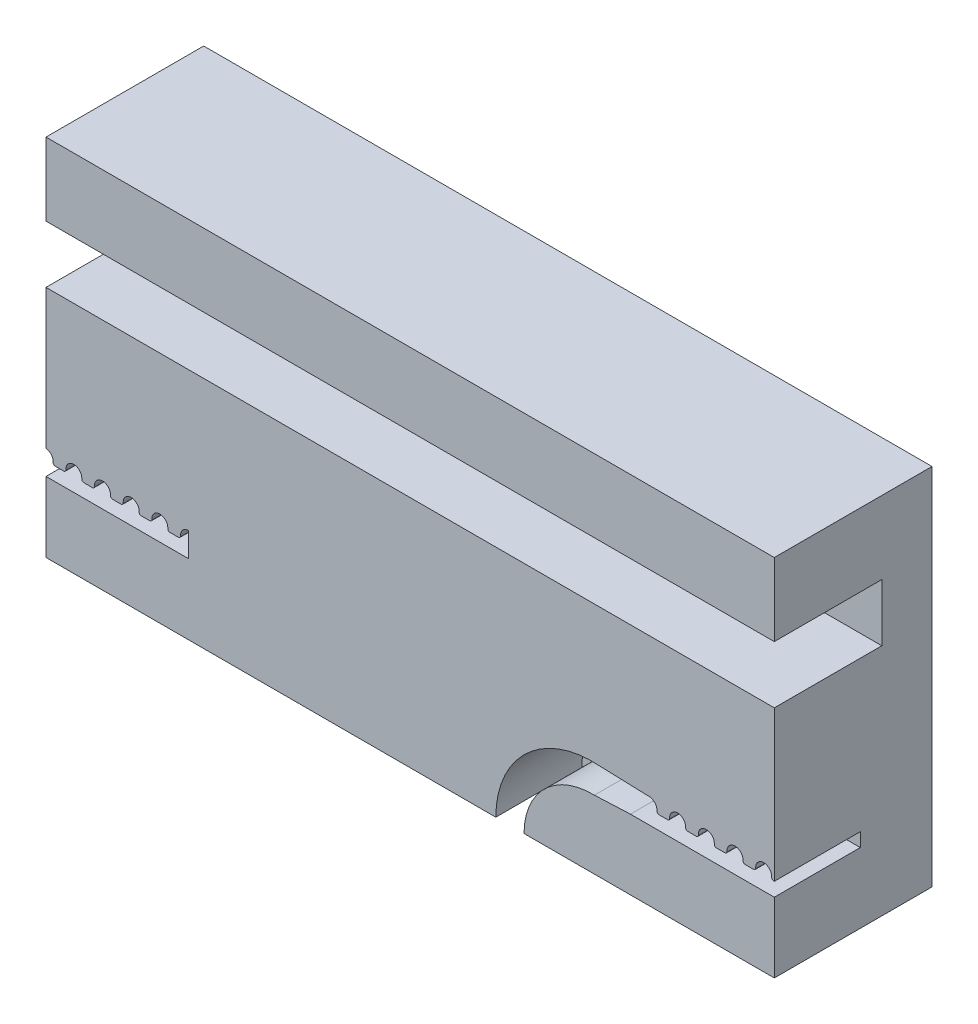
ISO-10303-21;
HEADER;
FILE_DESCRIPTION(('STEP AP214'),'2;1');
FILE_NAME('part.step','',(''),(''),'','','');
FILE_SCHEMA(('AUTOMOTIVE_DESIGN { 1 0 10303 214 1 1 1 1 }'));
ENDSEC;
DATA;
#1=APPLICATION_CONTEXT('core data for automotive mechanical design processes');
#2=APPLICATION_PROTOCOL_DEFINITION('international standard','automotive_design',2000,#1);
#3=PRODUCT_CONTEXT('',#1,'mechanical');
#4=PRODUCT('Part','Part','',(#3));
#5=PRODUCT_RELATED_PRODUCT_CATEGORY('part','',(#4));
#6=PRODUCT_DEFINITION_FORMATION('','',#4);
#7=PRODUCT_DEFINITION_CONTEXT('part definition',#1,'design');
#8=PRODUCT_DEFINITION('design','',#6,#7);
#9=PRODUCT_DEFINITION_SHAPE('','',#8);
#10=(LENGTH_UNIT() NAMED_UNIT(*) SI_UNIT(.MILLI.,.METRE.));
#11=(NAMED_UNIT(*) PLANE_ANGLE_UNIT() SI_UNIT($,.RADIAN.));
#12=(NAMED_UNIT(*) SI_UNIT($,.STERADIAN.) SOLID_ANGLE_UNIT());
#13=UNCERTAINTY_MEASURE_WITH_UNIT(LENGTH_MEASURE(1.E-05),#10,'distance_accuracy_value','');
#14=(GEOMETRIC_REPRESENTATION_CONTEXT(3) GLOBAL_UNCERTAINTY_ASSIGNED_CONTEXT((#13)) GLOBAL_UNIT_ASSIGNED_CONTEXT((#10,
#11,#12)) REPRESENTATION_CONTEXT('',''));
#15=CARTESIAN_POINT('',(0.,0.,0.));
#16=DIRECTION('',(0.,0.,1.));
#17=DIRECTION('',(1.,0.,0.));
#18=AXIS2_PLACEMENT_3D('',#15,#16,#17);
#19=CARTESIAN_POINT('',(-25.4,-12.7,12.46));
#20=DIRECTION('',(0.,1.,0.));
#21=DIRECTION('',(0.,0.,1.));
#22=AXIS2_PLACEMENT_3D('',#19,#20,#21);
#23=PLANE('',#22);
#24=DIRECTION('',(-1.,0.,0.));
#25=VECTOR('',#24,1.);
#26=CARTESIAN_POINT('',(25.4,-12.7,1.46));
#27=LINE('',#26,#25);
#28=CARTESIAN_POINT('',(25.4,-12.7,1.46));
#29=VERTEX_POINT('',#28);
#30=CARTESIAN_POINT('',(-25.4,-12.7,1.46));
#31=VERTEX_POINT('',#30);
#32=EDGE_CURVE('E54',#29,#31,#27,.T.);
#33=ORIENTED_EDGE('',*,*,#32,.F.);
#34=DIRECTION('',(0.,0.,-1.));
#35=VECTOR('',#34,1.);
#36=CARTESIAN_POINT('',(25.4,-12.7,12.46));
#37=LINE('',#36,#35);
#38=CARTESIAN_POINT('',(25.4,-12.7,12.46));
#39=VERTEX_POINT('',#38);
#40=EDGE_CURVE('E684',#39,#29,#37,.T.);
#41=ORIENTED_EDGE('',*,*,#40,.F.);
#42=DIRECTION('',(1.,0.,0.));
#43=VECTOR('',#42,1.);
#44=CARTESIAN_POINT('',(-25.4,-12.7,12.46));
#45=LINE('',#44,#43);
#46=CARTESIAN_POINT('',(7.94302351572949,-12.7,12.46));
#47=VERTEX_POINT('',#46);
#48=EDGE_CURVE('E62',#47,#39,#45,.T.);
#49=ORIENTED_EDGE('',*,*,#48,.F.);
#50=DIRECTION('',(0.,0.,1.));
#51=VECTOR('',#50,1.);
#52=CARTESIAN_POINT('',(7.94302351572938,-12.7000010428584,6.46));
#53=LINE('',#52,#51);
#54=CARTESIAN_POINT('',(7.94302351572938,-12.7000010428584,6.46));
#55=VERTEX_POINT('',#54);
#56=EDGE_CURVE('E1011',#55,#47,#53,.T.);
#57=ORIENTED_EDGE('',*,*,#56,.F.);
#58=DIRECTION('',(1.,0.,0.));
#59=VECTOR('',#58,1.);
#60=CARTESIAN_POINT('',(5.97522999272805,-12.7000010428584,6.46));
#61=LINE('',#60,#59);
#62=CARTESIAN_POINT('',(5.97522999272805,-12.7000010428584,6.46));
#63=VERTEX_POINT('',#62);
#64=EDGE_CURVE('E872',#63,#55,#61,.T.);
#65=ORIENTED_EDGE('',*,*,#64,.F.);
#66=DIRECTION('',(0.,0.,1.));
#67=VECTOR('',#66,1.);
#68=CARTESIAN_POINT('',(5.97522999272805,-12.7000010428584,6.46));
#69=LINE('',#68,#67);
#70=CARTESIAN_POINT('',(5.97522999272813,-12.7,12.46));
#71=VERTEX_POINT('',#70);
#72=EDGE_CURVE('E1014',#63,#71,#69,.T.);
#73=ORIENTED_EDGE('',*,*,#72,.T.);
#74=CARTESIAN_POINT('',(-25.4,-12.7,12.46));
#75=VERTEX_POINT('',#74);
#76=EDGE_CURVE('E693',#75,#71,#45,.T.);
#77=ORIENTED_EDGE('',*,*,#76,.F.);
#78=DIRECTION('',(0.,0.,-1.));
#79=VECTOR('',#78,1.);
#80=CARTESIAN_POINT('',(-25.4,-12.7,12.46));
#81=LINE('',#80,#79);
#82=EDGE_CURVE('E688',#75,#31,#81,.T.);
#83=ORIENTED_EDGE('',*,*,#82,.T.);
#84=EDGE_LOOP('',(#33,#41,#49,#57,#65,#73,#77,#83));
#85=FACE_BOUND('',#84,.T.);
#86=ADVANCED_FACE('F39',(#85),#23,.F.);
#87=CARTESIAN_POINT('',(25.4,-12.7,12.46));
#88=DIRECTION('',(-1.,0.,0.));
#89=DIRECTION('',(0.,0.,1.));
#90=AXIS2_PLACEMENT_3D('',#87,#88,#89);
#91=PLANE('',#90);
#92=DIRECTION('',(0.,-1.,0.));
#93=VECTOR('',#92,1.);
#94=CARTESIAN_POINT('',(25.4,12.7,1.46));
#95=LINE('',#94,#93);
#96=CARTESIAN_POINT('',(25.4,12.7,1.46));
#97=VERTEX_POINT('',#96);
#98=EDGE_CURVE('E673',#97,#29,#95,.T.);
#99=ORIENTED_EDGE('',*,*,#98,.F.);
#100=DIRECTION('',(0.,0.,-1.));
#101=VECTOR('',#100,1.);
#102=CARTESIAN_POINT('',(25.4,12.7,12.46));
#103=LINE('',#102,#101);
#104=CARTESIAN_POINT('',(25.4,12.7,12.46));
#105=VERTEX_POINT('',#104);
#106=EDGE_CURVE('E702',#105,#97,#103,.T.);
#107=ORIENTED_EDGE('',*,*,#106,.F.);
#108=DIRECTION('',(0.,1.,0.));
#109=VECTOR('',#108,1.);
#110=CARTESIAN_POINT('',(25.4,-12.7,12.46));
#111=LINE('',#110,#109);
#112=CARTESIAN_POINT('',(25.4,7.62,12.46));
#113=VERTEX_POINT('',#112);
#114=EDGE_CURVE('E733',#113,#105,#111,.T.);
#115=ORIENTED_EDGE('',*,*,#114,.F.);
#116=DIRECTION('',(0.,0.,1.));
#117=VECTOR('',#116,1.);
#118=CARTESIAN_POINT('',(25.4,7.62,12.46));
#119=LINE('',#118,#117);
#120=CARTESIAN_POINT('',(25.4,7.62,4.96));
#121=VERTEX_POINT('',#120);
#122=EDGE_CURVE('E749',#121,#113,#119,.T.);
#123=ORIENTED_EDGE('',*,*,#122,.F.);
#124=DIRECTION('',(0.,1.,0.));
#125=VECTOR('',#124,1.);
#126=CARTESIAN_POINT('',(25.4,7.62,4.96));
#127=LINE('',#126,#125);
#128=CARTESIAN_POINT('',(25.4,3.62,4.96));
#129=VERTEX_POINT('',#128);
#130=EDGE_CURVE('E742',#129,#121,#127,.T.);
#131=ORIENTED_EDGE('',*,*,#130,.F.);
#132=DIRECTION('',(0.,0.,-1.));
#133=VECTOR('',#132,1.);
#134=CARTESIAN_POINT('',(25.4,3.62,4.96));
#135=LINE('',#134,#133);
#136=CARTESIAN_POINT('',(25.4,3.62,12.46));
#137=VERTEX_POINT('',#136);
#138=EDGE_CURVE('E746',#137,#129,#135,.T.);
#139=ORIENTED_EDGE('',*,*,#138,.F.);
#140=CARTESIAN_POINT('',(25.4,-6.85999912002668,12.46));
#141=VERTEX_POINT('',#140);
#142=EDGE_CURVE('E732',#141,#137,#111,.T.);
#143=ORIENTED_EDGE('',*,*,#142,.F.);
#144=DIRECTION('',(0.,0.,-1.));
#145=VECTOR('',#144,1.);
#146=CARTESIAN_POINT('',(25.4,-6.85999912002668,12.46));
#147=LINE('',#146,#145);
#148=CARTESIAN_POINT('',(25.4,-6.85999912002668,6.46));
#149=VERTEX_POINT('',#148);
#150=EDGE_CURVE('E1008',#141,#149,#147,.T.);
#151=ORIENTED_EDGE('',*,*,#150,.T.);
#152=DIRECTION('',(0.,-1.,0.));
#153=VECTOR('',#152,1.);
#154=CARTESIAN_POINT('',(25.4,-12.7,6.46));
#155=LINE('',#154,#153);
#156=CARTESIAN_POINT('',(25.4,-7.82000018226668,6.46));
#157=VERTEX_POINT('',#156);
#158=EDGE_CURVE('E1517',#149,#157,#155,.T.);
#159=ORIENTED_EDGE('',*,*,#158,.T.);
#160=DIRECTION('',(0.,0.,1.));
#161=VECTOR('',#160,1.);
#162=CARTESIAN_POINT('',(25.4,-7.82000018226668,12.46));
#163=LINE('',#162,#161);
#164=CARTESIAN_POINT('',(25.4,-7.82000018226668,12.46));
#165=VERTEX_POINT('',#164);
#166=EDGE_CURVE('E1515',#157,#165,#163,.T.);
#167=ORIENTED_EDGE('',*,*,#166,.T.);
#168=EDGE_CURVE('E692',#39,#165,#111,.T.);
#169=ORIENTED_EDGE('',*,*,#168,.F.);
#170=ORIENTED_EDGE('',*,*,#40,.T.);
#171=EDGE_LOOP('',(#99,#107,#115,#123,#131,#139,#143,#151,#159,#167,#169,#170));
#172=FACE_BOUND('',#171,.T.);
#173=ADVANCED_FACE('F41',(#172),#91,.F.);
#174=CARTESIAN_POINT('',(-25.4,12.7,12.46));
#175=DIRECTION('',(0.,-1.,0.));
#176=DIRECTION('',(0.,0.,-1.));
#177=AXIS2_PLACEMENT_3D('',#174,#175,#176);
#178=PLANE('',#177);
#179=DIRECTION('',(1.,0.,0.));
#180=VECTOR('',#179,1.);
#181=CARTESIAN_POINT('',(25.4,12.7,1.46));
#182=LINE('',#181,#180);
#183=CARTESIAN_POINT('',(-25.4,12.7,1.46));
#184=VERTEX_POINT('',#183);
#185=EDGE_CURVE('E676',#184,#97,#182,.T.);
#186=ORIENTED_EDGE('',*,*,#185,.F.);
#187=DIRECTION('',(0.,0.,-1.));
#188=VECTOR('',#187,1.);
#189=CARTESIAN_POINT('',(-25.4,12.7,12.46));
#190=LINE('',#189,#188);
#191=CARTESIAN_POINT('',(-25.4,12.7,12.46));
#192=VERTEX_POINT('',#191);
#193=EDGE_CURVE('E695',#192,#184,#190,.T.);
#194=ORIENTED_EDGE('',*,*,#193,.F.);
#195=DIRECTION('',(-1.,0.,0.));
#196=VECTOR('',#195,1.);
#197=CARTESIAN_POINT('',(-25.4,12.7,12.46));
#198=LINE('',#197,#196);
#199=EDGE_CURVE('E728',#105,#192,#198,.T.);
#200=ORIENTED_EDGE('',*,*,#199,.F.);
#201=ORIENTED_EDGE('',*,*,#106,.T.);
#202=EDGE_LOOP('',(#186,#194,#200,#201));
#203=FACE_BOUND('',#202,.T.);
#204=ADVANCED_FACE('F1528',(#203),#178,.F.);
#205=CARTESIAN_POINT('',(-25.4,-12.7,12.46));
#206=DIRECTION('',(1.,0.,0.));
#207=DIRECTION('',(0.,0.,-1.));
#208=AXIS2_PLACEMENT_3D('',#205,#206,#207);
#209=PLANE('',#208);
#210=DIRECTION('',(0.,1.,0.));
#211=VECTOR('',#210,1.);
#212=CARTESIAN_POINT('',(-25.4,12.7,1.46));
#213=LINE('',#212,#211);
#214=EDGE_CURVE('E689',#31,#184,#213,.T.);
#215=ORIENTED_EDGE('',*,*,#214,.F.);
#216=ORIENTED_EDGE('',*,*,#82,.F.);
#217=DIRECTION('',(0.,-1.,0.));
#218=VECTOR('',#217,1.);
#219=CARTESIAN_POINT('',(-25.4,-12.7,12.46));
#220=LINE('',#219,#218);
#221=CARTESIAN_POINT('',(-25.4,-7.800353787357,12.46));
#222=VERTEX_POINT('',#221);
#223=EDGE_CURVE('E726',#222,#75,#220,.T.);
#224=ORIENTED_EDGE('',*,*,#223,.F.);
#225=DIRECTION('',(0.,0.,-1.));
#226=VECTOR('',#225,1.);
#227=CARTESIAN_POINT('',(-25.4,-7.800353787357,12.46));
#228=LINE('',#227,#226);
#229=CARTESIAN_POINT('',(-25.4,-7.800353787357,6.46));
#230=VERTEX_POINT('',#229);
#231=EDGE_CURVE('E11',#222,#230,#228,.T.);
#232=ORIENTED_EDGE('',*,*,#231,.T.);
#233=DIRECTION('',(0.,1.,0.));
#234=VECTOR('',#233,1.);
#235=CARTESIAN_POINT('',(-25.4,-12.7,6.46));
#236=LINE('',#235,#234);
#237=CARTESIAN_POINT('',(-25.4,-6.10315212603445,6.46));
#238=VERTEX_POINT('',#237);
#239=EDGE_CURVE('E704',#230,#238,#236,.T.);
#240=ORIENTED_EDGE('',*,*,#239,.T.);
#241=DIRECTION('',(0.,0.,1.));
#242=VECTOR('',#241,1.);
#243=CARTESIAN_POINT('',(-25.4,-6.10315212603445,6.46));
#244=LINE('',#243,#242);
#245=CARTESIAN_POINT('',(-25.4,-6.10315212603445,12.46));
#246=VERTEX_POINT('',#245);
#247=EDGE_CURVE('E47',#238,#246,#244,.T.);
#248=ORIENTED_EDGE('',*,*,#247,.T.);
#249=CARTESIAN_POINT('',(-25.4,3.62,12.46));
#250=VERTEX_POINT('',#249);
#251=EDGE_CURVE('E712',#250,#246,#220,.T.);
#252=ORIENTED_EDGE('',*,*,#251,.F.);
#253=DIRECTION('',(0.,0.,-1.));
#254=VECTOR('',#253,1.);
#255=CARTESIAN_POINT('',(-25.4,3.62,4.96));
#256=LINE('',#255,#254);
#257=CARTESIAN_POINT('',(-25.4,3.62,4.96));
#258=VERTEX_POINT('',#257);
#259=EDGE_CURVE('E755',#250,#258,#256,.T.);
#260=ORIENTED_EDGE('',*,*,#259,.T.);
#261=DIRECTION('',(0.,1.,0.));
#262=VECTOR('',#261,1.);
#263=CARTESIAN_POINT('',(-25.4,7.62,4.96));
#264=LINE('',#263,#262);
#265=CARTESIAN_POINT('',(-25.4,7.62,4.96));
#266=VERTEX_POINT('',#265);
#267=EDGE_CURVE('E736',#258,#266,#264,.T.);
#268=ORIENTED_EDGE('',*,*,#267,.T.);
#269=DIRECTION('',(0.,0.,1.));
#270=VECTOR('',#269,1.);
#271=CARTESIAN_POINT('',(-25.4,7.62,12.46));
#272=LINE('',#271,#270);
#273=CARTESIAN_POINT('',(-25.4,7.62,12.46));
#274=VERTEX_POINT('',#273);
#275=EDGE_CURVE('E745',#266,#274,#272,.T.);
#276=ORIENTED_EDGE('',*,*,#275,.T.);
#277=EDGE_CURVE('E725',#192,#274,#220,.T.);
#278=ORIENTED_EDGE('',*,*,#277,.F.);
#279=ORIENTED_EDGE('',*,*,#193,.T.);
#280=EDGE_LOOP('',(#215,#216,#224,#232,#240,#248,#252,#260,#268,#276,#278,#279));
#281=FACE_BOUND('',#280,.T.);
#282=ADVANCED_FACE('F710',(#281),#209,.F.);
#283=CARTESIAN_POINT('',(0.,0.,12.46));
#284=DIRECTION('',(0.,0.,-1.));
#285=DIRECTION('',(-1.,0.,0.));
#286=AXIS2_PLACEMENT_3D('',#283,#284,#285);
#287=PLANE('',#286);
#288=CARTESIAN_POINT('',(25.3650000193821,-6.70999912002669,12.46));
#289=DIRECTION('',(0.,0.,-1.));
#290=DIRECTION('',(1.,0.,0.));
#291=AXIS2_PLACEMENT_3D('',#288,#289,#290);
#292=CIRCLE('',#291,0.149999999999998);
#293=CARTESIAN_POINT('',(25.3650000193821,-6.85999912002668,12.46));
#294=VERTEX_POINT('',#293);
#295=CARTESIAN_POINT('',(25.2150000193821,-6.70999912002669,12.46));
#296=VERTEX_POINT('',#295);
#297=EDGE_CURVE('E885',#294,#296,#292,.T.);
#298=ORIENTED_EDGE('',*,*,#297,.F.);
#299=DIRECTION('',(-1.,0.,0.));
#300=VECTOR('',#299,1.);
#301=CARTESIAN_POINT('',(35.3650000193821,-6.85999912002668,12.46));
#302=LINE('',#301,#300);
#303=EDGE_CURVE('E1520',#141,#294,#302,.T.);
#304=ORIENTED_EDGE('',*,*,#303,.F.);
#305=ORIENTED_EDGE('',*,*,#142,.T.);
#306=DIRECTION('',(1.,0.,0.));
#307=VECTOR('',#306,1.);
#308=CARTESIAN_POINT('',(-25.4,3.62,12.46));
#309=LINE('',#308,#307);
#310=EDGE_CURVE('E723',#250,#137,#309,.T.);
#311=ORIENTED_EDGE('',*,*,#310,.F.);
#312=ORIENTED_EDGE('',*,*,#251,.T.);
#313=CARTESIAN_POINT('',(-25.4590575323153,-6.6550000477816,12.46));
#314=DIRECTION('',(0.,0.,1.));
#315=DIRECTION('',(-1.,0.,0.));
#316=AXIS2_PLACEMENT_3D('',#313,#314,#315);
#317=CIRCLE('',#316,0.554999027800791);
#318=CARTESIAN_POINT('',(-24.9040585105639,-6.65491810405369,12.46));
#319=VERTEX_POINT('',#318);
#320=EDGE_CURVE('E721',#319,#246,#317,.T.);
#321=ORIENTED_EDGE('',*,*,#320,.F.);
#322=DIRECTION('',(-0.000147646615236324,0.999999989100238,0.));
#323=VECTOR('',#322,1.);
#324=CARTESIAN_POINT('',(-24.9040585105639,-6.65491810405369,12.46));
#325=LINE('',#324,#323);
#326=CARTESIAN_POINT('',(-24.9040583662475,-6.65589554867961,12.46));
#327=VERTEX_POINT('',#326);
#328=EDGE_CURVE('E1226',#327,#319,#325,.T.);
#329=ORIENTED_EDGE('',*,*,#328,.F.);
#330=CARTESIAN_POINT('',(-25.4590575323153,-6.6550000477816,12.46));
#331=DIRECTION('',(0.,0.,1.));
#332=DIRECTION('',(-1.,0.,0.));
#333=AXIS2_PLACEMENT_3D('',#330,#331,#332);
#334=CIRCLE('',#333,0.554999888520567);
#335=CARTESIAN_POINT('',(-24.9057491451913,-6.69829791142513,12.46));
#336=VERTEX_POINT('',#335);
#337=EDGE_CURVE('E1229',#336,#327,#334,.T.);
#338=ORIENTED_EDGE('',*,*,#337,.F.);
#339=CARTESIAN_POINT('',(-24.756205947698,-6.71000006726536,12.46));
#340=DIRECTION('',(0.,0.,-1.));
#341=DIRECTION('',(-1.,0.,0.));
#342=AXIS2_PLACEMENT_3D('',#339,#340,#341);
#343=CIRCLE('',#342,0.150000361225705);
#344=CARTESIAN_POINT('',(-24.7562058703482,-6.86000042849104,12.46));
#345=VERTEX_POINT('',#344);
#346=EDGE_CURVE('E1232',#345,#336,#343,.T.);
#347=ORIENTED_EDGE('',*,*,#346,.F.);
#348=DIRECTION('',(-0.999999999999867,-5.15664258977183E-07,0.));
#349=VECTOR('',#348,1.);
#350=CARTESIAN_POINT('',(-24.7562058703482,-6.86000042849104,12.46));
#351=LINE('',#350,#349);
#352=CARTESIAN_POINT('',(-24.1649989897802,-6.86000012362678,12.46));
#353=VERTEX_POINT('',#352);
#354=EDGE_CURVE('E1235',#353,#345,#351,.T.);
#355=ORIENTED_EDGE('',*,*,#354,.F.);
#356=CARTESIAN_POINT('',(-24.1649990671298,-6.71000012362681,12.46));
#357=DIRECTION('',(0.,0.,-1.));
#358=DIRECTION('',(-1.,0.,0.));
#359=AXIS2_PLACEMENT_3D('',#356,#357,#358);
#360=CIRCLE('',#359,0.149999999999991);
#361=CARTESIAN_POINT('',(-24.0149990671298,-6.71000012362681,12.46));
#362=VERTEX_POINT('',#361);
#363=EDGE_CURVE('E1238',#362,#353,#360,.T.);
#364=ORIENTED_EDGE('',*,*,#363,.F.);
#365=DIRECTION('',(0.,-1.,0.));
#366=VECTOR('',#365,1.);
#367=CARTESIAN_POINT('',(-24.0149990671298,-6.71000012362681,12.46));
#368=LINE('',#367,#366);
#369=CARTESIAN_POINT('',(-24.0149990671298,-6.62263781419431,12.46));
#370=VERTEX_POINT('',#369);
#371=EDGE_CURVE('E1241',#370,#362,#368,.T.);
#372=ORIENTED_EDGE('',*,*,#371,.F.);
#373=DIRECTION('',(-1.,0.,0.));
#374=VECTOR('',#373,1.);
#375=CARTESIAN_POINT('',(-24.0149990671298,-6.62263781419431,12.46));
#376=LINE('',#375,#374);
#377=CARTESIAN_POINT('',(-24.0131150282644,-6.62263781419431,12.46));
#378=VERTEX_POINT('',#377);
#379=EDGE_CURVE('E1244',#378,#370,#376,.T.);
#380=ORIENTED_EDGE('',*,*,#379,.F.);
#381=CARTESIAN_POINT('',(-23.4590575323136,-6.65496877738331,12.46));
#382=DIRECTION('',(0.,0.,1.));
#383=DIRECTION('',(-1.,0.,0.));
#384=AXIS2_PLACEMENT_3D('',#381,#382,#383);
#385=CIRCLE('',#384,0.554999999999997);
#386=CARTESIAN_POINT('',(-23.465217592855,-6.10000296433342,12.46));
#387=VERTEX_POINT('',#386);
#388=EDGE_CURVE('E1247',#387,#378,#385,.T.);
#389=ORIENTED_EDGE('',*,*,#388,.F.);
#390=DIRECTION('',(-1.,0.,0.));
#391=VECTOR('',#390,1.);
#392=CARTESIAN_POINT('',(-23.465217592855,-6.10000296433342,12.46));
#393=LINE('',#392,#391);
#394=CARTESIAN_POINT('',(-23.4590575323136,-6.10000296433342,12.46));
#395=VERTEX_POINT('',#394);
#396=EDGE_CURVE('E1250',#395,#387,#393,.T.);
#397=ORIENTED_EDGE('',*,*,#396,.F.);
#398=CARTESIAN_POINT('',(-23.4590575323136,-6.655001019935,12.46));
#399=DIRECTION('',(0.,0.,1.));
#400=DIRECTION('',(-1.,0.,0.));
#401=AXIS2_PLACEMENT_3D('',#398,#399,#400);
#402=CIRCLE('',#401,0.554998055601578);
#403=CARTESIAN_POINT('',(-22.9040594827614,-6.65491907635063,12.46));
#404=VERTEX_POINT('',#403);
#405=EDGE_CURVE('E1253',#404,#395,#402,.T.);
#406=ORIENTED_EDGE('',*,*,#405,.F.);
#407=DIRECTION('',(-0.000147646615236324,0.999999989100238,0.));
#408=VECTOR('',#407,1.);
#409=CARTESIAN_POINT('',(-22.9040594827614,-6.65491907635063,12.46));
#410=LINE('',#409,#408);
#411=CARTESIAN_POINT('',(-22.904059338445,-6.65589652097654,12.46));
#412=VERTEX_POINT('',#411);
#413=EDGE_CURVE('E1256',#412,#404,#410,.T.);
#414=ORIENTED_EDGE('',*,*,#413,.F.);
#415=CARTESIAN_POINT('',(-23.4590575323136,-6.655001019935,12.46));
#416=DIRECTION('',(0.,0.,1.));
#417=DIRECTION('',(-1.,0.,0.));
#418=AXIS2_PLACEMENT_3D('',#415,#416,#417);
#419=CIRCLE('',#418,0.55499891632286);
#420=CARTESIAN_POINT('',(-22.9057501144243,-6.69829880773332,12.46));
#421=VERTEX_POINT('',#420);
#422=EDGE_CURVE('E1259',#421,#412,#419,.T.);
#423=ORIENTED_EDGE('',*,*,#422,.F.);
#424=CARTESIAN_POINT('',(-22.756206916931,-6.71000096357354,12.46));
#425=DIRECTION('',(0.,0.,-1.));
#426=DIRECTION('',(-1.,0.,0.));
#427=AXIS2_PLACEMENT_3D('',#424,#425,#426);
#428=CIRCLE('',#427,0.15000036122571);
#429=CARTESIAN_POINT('',(-22.7562068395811,-6.86000132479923,12.46));
#430=VERTEX_POINT('',#429);
#431=EDGE_CURVE('E1262',#430,#421,#428,.T.);
#432=ORIENTED_EDGE('',*,*,#431,.F.);
#433=DIRECTION('',(-0.999999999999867,-5.15664266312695E-07,0.));
#434=VECTOR('',#433,1.);
#435=CARTESIAN_POINT('',(-22.7562068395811,-6.86000132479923,12.46));
#436=LINE('',#435,#434);
#437=CARTESIAN_POINT('',(-22.1649999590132,-6.86000101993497,12.46));
#438=VERTEX_POINT('',#437);
#439=EDGE_CURVE('E1265',#438,#430,#436,.T.);
#440=ORIENTED_EDGE('',*,*,#439,.F.);
#441=CARTESIAN_POINT('',(-22.1650000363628,-6.710001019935,12.46));
#442=DIRECTION('',(0.,0.,-1.));
#443=DIRECTION('',(-1.,0.,0.));
#444=AXIS2_PLACEMENT_3D('',#441,#442,#443);
#445=CIRCLE('',#444,0.149999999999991);
#446=CARTESIAN_POINT('',(-22.0150000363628,-6.710001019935,12.46));
#447=VERTEX_POINT('',#446);
#448=EDGE_CURVE('E1268',#447,#438,#445,.T.);
#449=ORIENTED_EDGE('',*,*,#448,.F.);
#450=DIRECTION('',(0.,-1.,0.));
#451=VECTOR('',#450,1.);
#452=CARTESIAN_POINT('',(-22.0150000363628,-6.710001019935,12.46));
#453=LINE('',#452,#451);
#454=CARTESIAN_POINT('',(-22.0150000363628,-6.62263781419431,12.46));
#455=VERTEX_POINT('',#454);
#456=EDGE_CURVE('E1271',#455,#447,#453,.T.);
#457=ORIENTED_EDGE('',*,*,#456,.F.);
#458=DIRECTION('',(-1.,0.,0.));
#459=VECTOR('',#458,1.);
#460=CARTESIAN_POINT('',(-22.0150000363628,-6.62263781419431,12.46));
#461=LINE('',#460,#459);
#462=CARTESIAN_POINT('',(-22.0131150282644,-6.62263781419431,12.46));
#463=VERTEX_POINT('',#462);
#464=EDGE_CURVE('E1274',#463,#455,#461,.T.);
#465=ORIENTED_EDGE('',*,*,#464,.F.);
#466=CARTESIAN_POINT('',(-21.4590575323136,-6.65496877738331,12.46));
#467=DIRECTION('',(0.,0.,1.));
#468=DIRECTION('',(-1.,0.,0.));
#469=AXIS2_PLACEMENT_3D('',#466,#467,#468);
#470=CIRCLE('',#469,0.554999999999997);
#471=CARTESIAN_POINT('',(-21.4652175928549,-6.10000296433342,12.46));
#472=VERTEX_POINT('',#471);
#473=EDGE_CURVE('E1277',#472,#463,#470,.T.);
#474=ORIENTED_EDGE('',*,*,#473,.F.);
#475=DIRECTION('',(-1.,0.,0.));
#476=VECTOR('',#475,1.);
#477=CARTESIAN_POINT('',(-21.4652175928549,-6.10000296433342,12.46));
#478=LINE('',#477,#476);
#479=CARTESIAN_POINT('',(-21.4590575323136,-6.10000296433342,12.46));
#480=VERTEX_POINT('',#479);
#481=EDGE_CURVE('E1280',#480,#472,#478,.T.);
#482=ORIENTED_EDGE('',*,*,#481,.F.);
#483=CARTESIAN_POINT('',(-21.4590575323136,-6.65500199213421,12.46));
#484=DIRECTION('',(0.,0.,1.));
#485=DIRECTION('',(-1.,0.,0.));
#486=AXIS2_PLACEMENT_3D('',#483,#484,#485);
#487=CIRCLE('',#486,0.554999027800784);
#488=CARTESIAN_POINT('',(-20.9040585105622,-6.6549200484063,12.46));
#489=VERTEX_POINT('',#488);
#490=EDGE_CURVE('E1283',#489,#480,#487,.T.);
#491=ORIENTED_EDGE('',*,*,#490,.F.);
#492=DIRECTION('',(-0.000147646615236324,0.999999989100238,0.));
#493=VECTOR('',#492,1.);
#494=CARTESIAN_POINT('',(-20.9040585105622,-6.6549200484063,12.46));
#495=LINE('',#494,#493);
#496=CARTESIAN_POINT('',(-20.9040583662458,-6.65589749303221,12.46));
#497=VERTEX_POINT('',#496);
#498=EDGE_CURVE('E1286',#497,#489,#495,.T.);
#499=ORIENTED_EDGE('',*,*,#498,.F.);
#500=CARTESIAN_POINT('',(-21.4590575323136,-6.65500199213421,12.46));
#501=DIRECTION('',(0.,0.,1.));
#502=DIRECTION('',(-1.,0.,0.));
#503=AXIS2_PLACEMENT_3D('',#500,#501,#502);
#504=CIRCLE('',#503,0.55499988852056);
#505=CARTESIAN_POINT('',(-20.9057491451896,-6.69829985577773,12.46));
#506=VERTEX_POINT('',#505);
#507=EDGE_CURVE('E1289',#506,#497,#504,.T.);
#508=ORIENTED_EDGE('',*,*,#507,.F.);
#509=CARTESIAN_POINT('',(-20.7562059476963,-6.71000201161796,12.46));
#510=DIRECTION('',(0.,0.,-1.));
#511=DIRECTION('',(-1.,0.,0.));
#512=AXIS2_PLACEMENT_3D('',#509,#510,#511);
#513=CIRCLE('',#512,0.150000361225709);
#514=CARTESIAN_POINT('',(-20.7562058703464,-6.86000237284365,12.46));
#515=VERTEX_POINT('',#514);
#516=EDGE_CURVE('E1292',#515,#506,#513,.T.);
#517=ORIENTED_EDGE('',*,*,#516,.F.);
#518=DIRECTION('',(-0.999999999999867,-5.15664269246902E-07,0.));
#519=VECTOR('',#518,1.);
#520=CARTESIAN_POINT('',(-20.7562058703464,-6.86000237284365,12.46));
#521=LINE('',#520,#519);
#522=CARTESIAN_POINT('',(-20.1649989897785,-6.86000206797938,12.46));
#523=VERTEX_POINT('',#522);
#524=EDGE_CURVE('E1295',#523,#515,#521,.T.);
#525=ORIENTED_EDGE('',*,*,#524,.F.);
#526=CARTESIAN_POINT('',(-20.1649990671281,-6.71000206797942,12.46));
#527=DIRECTION('',(0.,0.,-1.));
#528=DIRECTION('',(-1.,0.,0.));
#529=AXIS2_PLACEMENT_3D('',#526,#527,#528);
#530=CIRCLE('',#529,0.14999999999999);
#531=CARTESIAN_POINT('',(-20.0149990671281,-6.71000206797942,12.46));
#532=VERTEX_POINT('',#531);
#533=EDGE_CURVE('E1298',#532,#523,#530,.T.);
#534=ORIENTED_EDGE('',*,*,#533,.F.);
#535=DIRECTION('',(0.,-1.,0.));
#536=VECTOR('',#535,1.);
#537=CARTESIAN_POINT('',(-20.0149990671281,-6.71000206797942,12.46));
#538=LINE('',#537,#536);
#539=CARTESIAN_POINT('',(-20.0149990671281,-6.62263436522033,12.46));
#540=VERTEX_POINT('',#539);
#541=EDGE_CURVE('E1301',#540,#532,#538,.T.);
#542=ORIENTED_EDGE('',*,*,#541,.F.);
#543=DIRECTION('',(-1.,0.,0.));
#544=VECTOR('',#543,1.);
#545=CARTESIAN_POINT('',(-20.0149990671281,-6.62263436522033,12.46));
#546=LINE('',#545,#544);
#547=CARTESIAN_POINT('',(-20.0131150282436,-6.62263436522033,12.46));
#548=VERTEX_POINT('',#547);
#549=EDGE_CURVE('E1304',#548,#540,#546,.T.);
#550=ORIENTED_EDGE('',*,*,#549,.F.);
#551=CARTESIAN_POINT('',(-19.4590575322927,-6.65496532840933,12.46));
#552=DIRECTION('',(0.,0.,1.));
#553=DIRECTION('',(-1.,0.,0.));
#554=AXIS2_PLACEMENT_3D('',#551,#552,#553);
#555=CIRCLE('',#554,0.555000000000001);
#556=CARTESIAN_POINT('',(-19.465445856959,-6.10000209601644,12.46));
#557=VERTEX_POINT('',#556);
#558=EDGE_CURVE('E1307',#557,#548,#555,.T.);
#559=ORIENTED_EDGE('',*,*,#558,.F.);
#560=DIRECTION('',(-1.,0.,0.));
#561=VECTOR('',#560,1.);
#562=CARTESIAN_POINT('',(-19.465445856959,-6.10000209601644,12.46));
#563=LINE('',#562,#561);
#564=CARTESIAN_POINT('',(-19.4591350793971,-6.10000209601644,12.46));
#565=VERTEX_POINT('',#564);
#566=EDGE_CURVE('E1310',#565,#557,#563,.T.);
#567=ORIENTED_EDGE('',*,*,#566,.F.);
#568=CARTESIAN_POINT('',(-19.4591350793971,-6.65500015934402,12.46));
#569=DIRECTION('',(0.,0.,1.));
#570=DIRECTION('',(-1.,0.,0.));
#571=AXIS2_PLACEMENT_3D('',#568,#569,#570);
#572=CIRCLE('',#571,0.554998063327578);
#573=CARTESIAN_POINT('',(-18.9041370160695,-6.65500015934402,12.46));
#574=VERTEX_POINT('',#573);
#575=EDGE_CURVE('E1313',#574,#565,#572,.T.);
#576=ORIENTED_EDGE('',*,*,#575,.F.);
#577=DIRECTION('',(0.,1.,0.));
#578=VECTOR('',#577,1.);
#579=CARTESIAN_POINT('',(-18.9041370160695,-6.65500015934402,12.46));
#580=LINE('',#579,#578);
#581=CARTESIAN_POINT('',(-18.9041370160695,-6.65597320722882,12.46));
#582=VERTEX_POINT('',#581);
#583=EDGE_CURVE('E1315',#582,#574,#580,.T.);
#584=ORIENTED_EDGE('',*,*,#583,.F.);
#585=CARTESIAN_POINT('',(-19.4591350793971,-6.65500015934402,12.46));
#586=DIRECTION('',(0.,0.,1.));
#587=DIRECTION('',(-1.,0.,0.));
#588=AXIS2_PLACEMENT_3D('',#585,#586,#587);
#589=CIRCLE('',#588,0.554998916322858);
#590=CARTESIAN_POINT('',(-18.9058306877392,-6.69833660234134,12.46));
#591=VERTEX_POINT('',#590);
#592=EDGE_CURVE('E1318',#591,#582,#589,.T.);
#593=ORIENTED_EDGE('',*,*,#592,.F.);
#594=CARTESIAN_POINT('',(-18.7562883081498,-6.71004920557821,12.46));
#595=DIRECTION('',(0.,0.,-1.));
#596=DIRECTION('',(-1.,0.,0.));
#597=AXIS2_PLACEMENT_3D('',#594,#595,#596);
#598=CIRCLE('',#597,0.15000036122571);
#599=CARTESIAN_POINT('',(-18.7562987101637,-6.86004956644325,12.46));
#600=VERTEX_POINT('',#599);
#601=EDGE_CURVE('E1321',#600,#591,#598,.T.);
#602=ORIENTED_EDGE('',*,*,#601,.F.);
#603=DIRECTION('',(-0.999999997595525,6.9346592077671E-05,0.));
#604=VECTOR('',#603,1.);
#605=CARTESIAN_POINT('',(-18.7562987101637,-6.86004956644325,12.46));
#606=LINE('',#605,#604);
#607=CARTESIAN_POINT('',(-18.1650918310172,-6.86009056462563,12.46));
#608=VERTEX_POINT('',#607);
#609=EDGE_CURVE('E1324',#608,#600,#606,.T.);
#610=ORIENTED_EDGE('',*,*,#609,.F.);
#611=CARTESIAN_POINT('',(-18.1650814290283,-6.7100905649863,12.46));
#612=DIRECTION('',(0.,0.,-1.));
#613=DIRECTION('',(-1.,0.,0.));
#614=AXIS2_PLACEMENT_3D('',#611,#612,#613);
#615=CIRCLE('',#614,0.149999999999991);
#616=CARTESIAN_POINT('',(-18.0150814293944,-6.71010104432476,12.46));
#617=VERTEX_POINT('',#616);
#618=EDGE_CURVE('E1327',#617,#608,#615,.T.);
#619=ORIENTED_EDGE('',*,*,#618,.F.);
#620=DIRECTION('',(-6.98622563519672E-05,-0.999999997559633,0.));
#621=VECTOR('',#620,1.);
#622=CARTESIAN_POINT('',(-18.0150814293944,-6.71010104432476,12.46));
#623=LINE('',#622,#621);
#624=CARTESIAN_POINT('',(-18.0150753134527,-6.62255818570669,12.46));
#625=VERTEX_POINT('',#624);
#626=EDGE_CURVE('E1330',#625,#617,#623,.T.);
#627=ORIENTED_EDGE('',*,*,#626,.F.);
#628=DIRECTION('',(-0.99999999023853,0.000139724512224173,0.));
#629=VECTOR('',#628,1.);
#630=CARTESIAN_POINT('',(-18.0150753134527,-6.62255818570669,12.46));
#631=LINE('',#630,#629);
#632=CARTESIAN_POINT('',(-18.0131880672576,-6.62255844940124,12.46));
#633=VERTEX_POINT('',#632);
#634=EDGE_CURVE('E1333',#633,#625,#631,.T.);
#635=ORIENTED_EDGE('',*,*,#634,.F.);
#636=CARTESIAN_POINT('',(-17.4591352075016,-6.65496876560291,12.46));
#637=DIRECTION('',(0.,0.,1.));
#638=DIRECTION('',(-1.,0.,0.));
#639=AXIS2_PLACEMENT_3D('',#636,#637,#638);
#640=CIRCLE('',#639,0.555000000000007);
#641=CARTESIAN_POINT('',(-17.4652176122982,-6.10000209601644,12.46));
#642=VERTEX_POINT('',#641);
#643=EDGE_CURVE('E1336',#642,#633,#640,.T.);
#644=ORIENTED_EDGE('',*,*,#643,.F.);
#645=DIRECTION('',(-1.,0.,0.));
#646=VECTOR('',#645,1.);
#647=CARTESIAN_POINT('',(-17.4652176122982,-6.10000209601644,12.46));
#648=LINE('',#647,#646);
#649=CARTESIAN_POINT('',(-17.4590584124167,-6.10000209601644,12.46));
#650=VERTEX_POINT('',#649);
#651=EDGE_CURVE('E1339',#650,#642,#648,.T.);
#652=ORIENTED_EDGE('',*,*,#651,.F.);
#653=CARTESIAN_POINT('',(-17.4590584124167,-6.65500198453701,12.46));
#654=DIRECTION('',(0.,0.,1.));
#655=DIRECTION('',(-1.,0.,0.));
#656=AXIS2_PLACEMENT_3D('',#653,#654,#655);
#657=CIRCLE('',#656,0.554999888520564);
#658=CARTESIAN_POINT('',(-16.9057500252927,-6.69829984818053,12.46));
#659=VERTEX_POINT('',#658);
#660=EDGE_CURVE('E1342',#659,#650,#657,.T.);
#661=ORIENTED_EDGE('',*,*,#660,.F.);
#662=CARTESIAN_POINT('',(-16.7562068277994,-6.71000200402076,12.46));
#663=DIRECTION('',(0.,0.,-1.));
#664=DIRECTION('',(-1.,0.,0.));
#665=AXIS2_PLACEMENT_3D('',#662,#663,#664);
#666=CIRCLE('',#665,0.150000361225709);
#667=CARTESIAN_POINT('',(-16.7562067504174,-6.86000236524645,12.46));
#668=VERTEX_POINT('',#667);
#669=EDGE_CURVE('E1345',#668,#659,#666,.T.);
#670=ORIENTED_EDGE('',*,*,#669,.F.);
#671=DIRECTION('',(-0.999999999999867,-5.15878472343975E-07,0.));
#672=VECTOR('',#671,1.);
#673=CARTESIAN_POINT('',(-16.7562067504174,-6.86000236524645,12.46));
#674=LINE('',#673,#672);
#675=CARTESIAN_POINT('',(-16.1649990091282,-6.8600020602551,12.46));
#676=VERTEX_POINT('',#675);
#677=EDGE_CURVE('E1348',#676,#668,#674,.T.);
#678=ORIENTED_EDGE('',*,*,#677,.F.);
#679=CARTESIAN_POINT('',(-16.16499908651,-6.71000206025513,12.46));
#680=DIRECTION('',(0.,0.,-1.));
#681=DIRECTION('',(-1.,0.,0.));
#682=AXIS2_PLACEMENT_3D('',#679,#680,#681);
#683=CIRCLE('',#682,0.14999999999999);
#684=CARTESIAN_POINT('',(-16.01499908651,-6.71000206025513,12.46));
#685=VERTEX_POINT('',#684);
#686=EDGE_CURVE('E1351',#685,#676,#683,.T.);
#687=ORIENTED_EDGE('',*,*,#686,.F.);
#688=DIRECTION('',(0.,-1.,0.));
#689=VECTOR('',#688,1.);
#690=CARTESIAN_POINT('',(-16.01499908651,-6.71000206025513,12.46));
#691=LINE('',#690,#689);
#692=CARTESIAN_POINT('',(-16.01499908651,-6.62264053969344,12.46));
#693=VERTEX_POINT('',#692);
#694=EDGE_CURVE('E1354',#693,#685,#691,.T.);
#695=ORIENTED_EDGE('',*,*,#694,.F.);
#696=DIRECTION('',(-1.,0.,0.));
#697=VECTOR('',#696,1.);
#698=CARTESIAN_POINT('',(-16.01499908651,-6.62264053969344,12.46));
#699=LINE('',#698,#697);
#700=CARTESIAN_POINT('',(-16.0131132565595,-6.62264053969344,12.46));
#701=VERTEX_POINT('',#700);
#702=EDGE_CURVE('E1357',#701,#693,#699,.T.);
#703=ORIENTED_EDGE('',*,*,#702,.F.);
#704=CARTESIAN_POINT('',(-15.4590557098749,-6.65497063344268,12.46));
#705=DIRECTION('',(0.,0.,1.));
#706=DIRECTION('',(-1.,0.,0.));
#707=AXIS2_PLACEMENT_3D('',#704,#705,#706);
#708=CIRCLE('',#707,0.555000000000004);
#709=CARTESIAN_POINT('',(-15.4652166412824,-6.10000483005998,12.46));
#710=VERTEX_POINT('',#709);
#711=EDGE_CURVE('E1360',#710,#701,#708,.T.);
#712=ORIENTED_EDGE('',*,*,#711,.F.);
#713=DIRECTION('',(-0.00410134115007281,0.999991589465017,0.));
#714=VECTOR('',#713,1.);
#715=CARTESIAN_POINT('',(-15.4652166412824,-6.10000483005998,12.46));
#716=LINE('',#715,#714);
#717=CARTESIAN_POINT('',(-15.4652151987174,-6.10035655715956,12.46));
#718=VERTEX_POINT('',#717);
#719=EDGE_CURVE('E1363',#718,#710,#716,.T.);
#720=ORIENTED_EDGE('',*,*,#719,.F.);
#721=DIRECTION('',(0.,1.,0.));
#722=VECTOR('',#721,1.);
#723=CARTESIAN_POINT('',(-15.4652151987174,-6.10035655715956,12.46));
#724=LINE('',#723,#722);
#725=CARTESIAN_POINT('',(-15.4652151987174,-7.800353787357,12.46));
#726=VERTEX_POINT('',#725);
#727=EDGE_CURVE('E884',#726,#718,#724,.T.);
#728=ORIENTED_EDGE('',*,*,#727,.F.);
#729=DIRECTION('',(1.,0.,0.));
#730=VECTOR('',#729,1.);
#731=CARTESIAN_POINT('',(-25.4392725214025,-7.800353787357,12.46));
#732=LINE('',#731,#730);
#733=EDGE_CURVE('E1222',#222,#726,#732,.T.);
#734=ORIENTED_EDGE('',*,*,#733,.F.);
#735=ORIENTED_EDGE('',*,*,#223,.T.);
#736=ORIENTED_EDGE('',*,*,#76,.T.);
#737=CARTESIAN_POINT('',(12.7139532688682,-12.7000010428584,12.46));
#738=DIRECTION('',(0.,0.,1.));
#739=DIRECTION('',(1.,0.,0.));
#740=AXIS2_PLACEMENT_3D('',#737,#738,#739);
#741=CIRCLE('',#740,6.73872327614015);
#742=CARTESIAN_POINT('',(13.2560463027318,-5.98311735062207,12.46));
#743=VERTEX_POINT('',#742);
#744=EDGE_CURVE('E996',#743,#71,#741,.T.);
#745=ORIENTED_EDGE('',*,*,#744,.F.);
#746=DIRECTION('',(-0.999414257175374,0.0342219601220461,0.));
#747=VECTOR('',#746,1.);
#748=CARTESIAN_POINT('',(16.6798066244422,-6.10035381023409,12.46));
#749=LINE('',#748,#747);
#750=CARTESIAN_POINT('',(16.6798066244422,-6.10035381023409,12.46));
#751=VERTEX_POINT('',#750);
#752=EDGE_CURVE('E993',#751,#743,#749,.T.);
#753=ORIENTED_EDGE('',*,*,#752,.F.);
#754=CARTESIAN_POINT('',(16.6590574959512,-6.65496581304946,12.46));
#755=DIRECTION('',(0.,0.,1.));
#756=DIRECTION('',(1.,0.,0.));
#757=AXIS2_PLACEMENT_3D('',#754,#755,#756);
#758=CIRCLE('',#757,0.555000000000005);
#759=CARTESIAN_POINT('',(17.213114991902,-6.62263484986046,12.46));
#760=VERTEX_POINT('',#759);
#761=EDGE_CURVE('E990',#760,#751,#758,.T.);
#762=ORIENTED_EDGE('',*,*,#761,.F.);
#763=DIRECTION('',(-1.,0.,0.));
#764=VECTOR('',#763,1.);
#765=CARTESIAN_POINT('',(17.2150000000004,-6.62263484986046,12.46));
#766=LINE('',#765,#764);
#767=CARTESIAN_POINT('',(17.2150000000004,-6.62263484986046,12.46));
#768=VERTEX_POINT('',#767);
#769=EDGE_CURVE('E987',#768,#760,#766,.T.);
#770=ORIENTED_EDGE('',*,*,#769,.F.);
#771=DIRECTION('',(0.,1.,0.));
#772=VECTOR('',#771,1.);
#773=CARTESIAN_POINT('',(17.2150000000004,-6.70999999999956,12.46));
#774=LINE('',#773,#772);
#775=CARTESIAN_POINT('',(17.2150005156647,-6.70999999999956,12.46));
#776=VERTEX_POINT('',#775);
#777=EDGE_CURVE('E984',#776,#768,#774,.T.);
#778=ORIENTED_EDGE('',*,*,#777,.F.);
#779=CARTESIAN_POINT('',(17.3650000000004,-6.70999999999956,12.46));
#780=DIRECTION('',(0.,0.,-1.));
#781=DIRECTION('',(1.,0.,0.));
#782=AXIS2_PLACEMENT_3D('',#779,#780,#781);
#783=CIRCLE('',#782,0.149999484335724);
#784=CARTESIAN_POINT('',(17.3649999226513,-6.85999896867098,12.46));
#785=VERTEX_POINT('',#784);
#786=EDGE_CURVE('E981',#785,#776,#783,.T.);
#787=ORIENTED_EDGE('',*,*,#786,.F.);
#788=DIRECTION('',(-0.999999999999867,5.15664269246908E-07,0.));
#789=VECTOR('',#788,1.);
#790=CARTESIAN_POINT('',(17.9562068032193,-6.85999927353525,12.46));
#791=LINE('',#790,#789);
#792=CARTESIAN_POINT('',(17.9562068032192,-6.8599994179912,12.46));
#793=VERTEX_POINT('',#792);
#794=EDGE_CURVE('E978',#793,#785,#791,.T.);
#795=ORIENTED_EDGE('',*,*,#794,.F.);
#796=CARTESIAN_POINT('',(17.9562068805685,-6.7099999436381,12.46));
#797=DIRECTION('',(0.,0.,-1.));
#798=DIRECTION('',(1.,0.,0.));
#799=AXIS2_PLACEMENT_3D('',#796,#797,#798);
#800=CIRCLE('',#799,0.149999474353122);
#801=CARTESIAN_POINT('',(18.1057493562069,-6.69829784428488,12.46));
#802=VERTEX_POINT('',#801);
#803=EDGE_CURVE('E975',#802,#793,#800,.T.);
#804=ORIENTED_EDGE('',*,*,#803,.F.);
#805=CARTESIAN_POINT('',(18.6590574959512,-6.65499999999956,12.46));
#806=DIRECTION('',(0.,0.,1.));
#807=DIRECTION('',(1.,0.,0.));
#808=AXIS2_PLACEMENT_3D('',#805,#806,#807);
#809=CIRCLE('',#808,0.554999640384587);
#810=CARTESIAN_POINT('',(18.6590574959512,-6.09999999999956,12.46));
#811=VERTEX_POINT('',#810);
#812=EDGE_CURVE('E972',#811,#802,#809,.T.);
#813=ORIENTED_EDGE('',*,*,#812,.F.);
#814=DIRECTION('',(-1.,0.,0.));
#815=VECTOR('',#814,1.);
#816=CARTESIAN_POINT('',(18.6590574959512,-6.09999999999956,12.46));
#817=LINE('',#816,#815);
#818=CARTESIAN_POINT('',(18.6652175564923,-6.09999999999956,12.46));
#819=VERTEX_POINT('',#818);
#820=EDGE_CURVE('E969',#819,#811,#817,.T.);
#821=ORIENTED_EDGE('',*,*,#820,.F.);
#822=CARTESIAN_POINT('',(18.6590574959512,-6.65496581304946,12.46));
#823=DIRECTION('',(0.,0.,1.));
#824=DIRECTION('',(1.,0.,0.));
#825=AXIS2_PLACEMENT_3D('',#822,#823,#824);
#826=CIRCLE('',#825,0.555000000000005);
#827=CARTESIAN_POINT('',(19.213114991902,-6.62263484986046,12.46));
#828=VERTEX_POINT('',#827);
#829=EDGE_CURVE('E966',#828,#819,#826,.T.);
#830=ORIENTED_EDGE('',*,*,#829,.F.);
#831=DIRECTION('',(-1.,0.,0.));
#832=VECTOR('',#831,1.);
#833=CARTESIAN_POINT('',(19.2150000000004,-6.62263484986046,12.46));
#834=LINE('',#833,#832);
#835=CARTESIAN_POINT('',(19.2150000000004,-6.62263484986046,12.46));
#836=VERTEX_POINT('',#835);
#837=EDGE_CURVE('E963',#836,#828,#834,.T.);
#838=ORIENTED_EDGE('',*,*,#837,.F.);
#839=DIRECTION('',(0.,1.,0.));
#840=VECTOR('',#839,1.);
#841=CARTESIAN_POINT('',(19.2150000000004,-6.70999999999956,12.46));
#842=LINE('',#841,#840);
#843=CARTESIAN_POINT('',(19.2149994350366,-6.70999999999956,12.46));
#844=VERTEX_POINT('',#843);
#845=EDGE_CURVE('E960',#844,#836,#842,.T.);
#846=ORIENTED_EDGE('',*,*,#845,.F.);
#847=CARTESIAN_POINT('',(19.3650000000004,-6.70999999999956,12.46));
#848=DIRECTION('',(0.,0.,-1.));
#849=DIRECTION('',(1.,0.,0.));
#850=AXIS2_PLACEMENT_3D('',#847,#848,#849);
#851=CIRCLE('',#850,0.150000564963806);
#852=CARTESIAN_POINT('',(19.3650000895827,-6.86000112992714,12.46));
#853=VERTEX_POINT('',#852);
#854=EDGE_CURVE('E957',#853,#844,#851,.T.);
#855=ORIENTED_EDGE('',*,*,#854,.F.);
#856=DIRECTION('',(-0.999999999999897,4.53159913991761E-07,0.));
#857=VECTOR('',#856,1.);
#858=CARTESIAN_POINT('',(19.3650000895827,-6.86000112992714,12.46));
#859=LINE('',#858,#857);
#860=CARTESIAN_POINT('',(19.9562069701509,-6.86000118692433,12.46));
#861=VERTEX_POINT('',#860);
#862=EDGE_CURVE('E954',#861,#853,#859,.T.);
#863=ORIENTED_EDGE('',*,*,#862,.F.);
#864=CARTESIAN_POINT('',(19.9562068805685,-6.7099999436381,12.46));
#865=DIRECTION('',(0.,0.,-1.));
#866=DIRECTION('',(1.,0.,0.));
#867=AXIS2_PLACEMENT_3D('',#864,#865,#866);
#868=CIRCLE('',#867,0.150001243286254);
#869=CARTESIAN_POINT('',(20.1057506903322,-6.69829773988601,12.46));
#870=VERTEX_POINT('',#869);
#871=EDGE_CURVE('E951',#870,#861,#868,.T.);
#872=ORIENTED_EDGE('',*,*,#871,.F.);
#873=CARTESIAN_POINT('',(20.6590574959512,-6.65499999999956,12.46));
#874=DIRECTION('',(0.,0.,1.));
#875=DIRECTION('',(1.,0.,0.));
#876=AXIS2_PLACEMENT_3D('',#873,#874,#875);
#877=CIRCLE('',#876,0.554998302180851);
#878=CARTESIAN_POINT('',(20.6590574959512,-6.09999999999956,12.46));
#879=VERTEX_POINT('',#878);
#880=EDGE_CURVE('E948',#879,#870,#877,.T.);
#881=ORIENTED_EDGE('',*,*,#880,.F.);
#882=DIRECTION('',(-1.,1.40779402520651E-13,0.));
#883=VECTOR('',#882,1.);
#884=CARTESIAN_POINT('',(20.6590574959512,-6.09999999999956,12.46));
#885=LINE('',#884,#883);
#886=CARTESIAN_POINT('',(20.6652186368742,-6.09999999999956,12.46));
#887=VERTEX_POINT('',#886);
#888=EDGE_CURVE('E945',#887,#879,#885,.T.);
#889=ORIENTED_EDGE('',*,*,#888,.F.);
#890=CARTESIAN_POINT('',(20.6590834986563,-6.65496608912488,12.46));
#891=DIRECTION('',(0.,0.,1.));
#892=DIRECTION('',(1.,0.,0.));
#893=AXIS2_PLACEMENT_3D('',#890,#891,#892);
#894=CIRCLE('',#893,0.555000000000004);
#895=CARTESIAN_POINT('',(21.2131409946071,-6.62263512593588,12.46));
#896=VERTEX_POINT('',#895);
#897=EDGE_CURVE('E942',#896,#887,#894,.T.);
#898=ORIENTED_EDGE('',*,*,#897,.F.);
#899=DIRECTION('',(-1.,0.,0.));
#900=VECTOR('',#899,1.);
#901=CARTESIAN_POINT('',(21.2150260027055,-6.62263512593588,12.46));
#902=LINE('',#901,#900);
#903=CARTESIAN_POINT('',(21.2150260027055,-6.62263512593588,12.46));
#904=VERTEX_POINT('',#903);
#905=EDGE_CURVE('E939',#904,#896,#902,.T.);
#906=ORIENTED_EDGE('',*,*,#905,.F.);
#907=DIRECTION('',(0.,1.,0.));
#908=VECTOR('',#907,1.);
#909=CARTESIAN_POINT('',(21.2150260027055,-6.7100002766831,12.46));
#910=LINE('',#909,#908);
#911=CARTESIAN_POINT('',(21.2150251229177,-6.7100002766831,12.46));
#912=VERTEX_POINT('',#911);
#913=EDGE_CURVE('E936',#912,#904,#910,.T.);
#914=ORIENTED_EDGE('',*,*,#913,.F.);
#915=CARTESIAN_POINT('',(21.3650260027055,-6.7100002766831,12.46));
#916=DIRECTION('',(0.,0.,-1.));
#917=DIRECTION('',(1.,0.,0.));
#918=AXIS2_PLACEMENT_3D('',#915,#916,#917);
#919=CIRCLE('',#918,0.150000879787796);
#920=CARTESIAN_POINT('',(21.3650259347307,-6.86000203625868,12.46));
#921=VERTEX_POINT('',#920);
#922=EDGE_CURVE('E933',#921,#912,#919,.T.);
#923=ORIENTED_EDGE('',*,*,#922,.F.);
#924=DIRECTION('',(-0.999999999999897,4.53159912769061E-07,0.));
#925=VECTOR('',#924,1.);
#926=CARTESIAN_POINT('',(21.3650259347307,-6.86000203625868,12.46));
#927=LINE('',#926,#925);
#928=CARTESIAN_POINT('',(21.9562071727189,-6.86000081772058,12.46));
#929=VERTEX_POINT('',#928);
#930=EDGE_CURVE('E930',#929,#921,#927,.T.);
#931=ORIENTED_EDGE('',*,*,#930,.F.);
#932=CARTESIAN_POINT('',(21.9562072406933,-6.70999991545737,12.46));
#933=DIRECTION('',(0.,0.,-1.));
#934=DIRECTION('',(1.,0.,0.));
#935=AXIS2_PLACEMENT_3D('',#932,#933,#934);
#936=CIRCLE('',#935,0.150000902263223);
#937=CARTESIAN_POINT('',(22.1057492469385,-6.69829785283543,12.46));
#938=VERTEX_POINT('',#937);
#939=EDGE_CURVE('E927',#938,#929,#936,.T.);
#940=ORIENTED_EDGE('',*,*,#939,.F.);
#941=CARTESIAN_POINT('',(22.6590574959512,-6.65499999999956,12.46));
#942=DIRECTION('',(0.,0.,1.));
#943=DIRECTION('',(1.,0.,0.));
#944=AXIS2_PLACEMENT_3D('',#941,#942,#943);
#945=CIRCLE('',#944,0.554999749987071);
#946=CARTESIAN_POINT('',(22.6590574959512,-6.09999999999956,12.46));
#947=VERTEX_POINT('',#946);
#948=EDGE_CURVE('E924',#947,#938,#945,.T.);
#949=ORIENTED_EDGE('',*,*,#948,.F.);
#950=DIRECTION('',(-1.,0.,0.));
#951=VECTOR('',#950,1.);
#952=CARTESIAN_POINT('',(22.6590574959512,-6.09999999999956,12.46));
#953=LINE('',#952,#951);
#954=CARTESIAN_POINT('',(22.6651937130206,-6.09999999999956,12.46));
#955=VERTEX_POINT('',#954);
#956=EDGE_CURVE('E921',#955,#947,#953,.T.);
#957=ORIENTED_EDGE('',*,*,#956,.F.);
#958=CARTESIAN_POINT('',(22.659058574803,-6.65496608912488,12.46));
#959=DIRECTION('',(0.,0.,1.));
#960=DIRECTION('',(1.,0.,0.));
#961=AXIS2_PLACEMENT_3D('',#958,#959,#960);
#962=CIRCLE('',#961,0.555000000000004);
#963=CARTESIAN_POINT('',(23.2131160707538,-6.62263512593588,12.46));
#964=VERTEX_POINT('',#963);
#965=EDGE_CURVE('E918',#964,#955,#962,.T.);
#966=ORIENTED_EDGE('',*,*,#965,.F.);
#967=DIRECTION('',(-1.,0.,0.));
#968=VECTOR('',#967,1.);
#969=CARTESIAN_POINT('',(23.2150010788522,-6.62263512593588,12.46));
#970=LINE('',#969,#968);
#971=CARTESIAN_POINT('',(23.2150010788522,-6.62263512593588,12.46));
#972=VERTEX_POINT('',#971);
#973=EDGE_CURVE('E915',#972,#964,#970,.T.);
#974=ORIENTED_EDGE('',*,*,#973,.F.);
#975=DIRECTION('',(0.,1.,0.));
#976=VECTOR('',#975,1.);
#977=CARTESIAN_POINT('',(23.2150010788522,-6.71000027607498,12.46));
#978=LINE('',#977,#976);
#979=CARTESIAN_POINT('',(23.2149997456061,-6.71000027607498,12.46));
#980=VERTEX_POINT('',#979);
#981=EDGE_CURVE('E912',#980,#972,#978,.T.);
#982=ORIENTED_EDGE('',*,*,#981,.F.);
#983=CARTESIAN_POINT('',(23.3650010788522,-6.71000027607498,12.46));
#984=DIRECTION('',(0.,0.,-1.));
#985=DIRECTION('',(1.,0.,0.));
#986=AXIS2_PLACEMENT_3D('',#983,#984,#985);
#987=CIRCLE('',#986,0.150001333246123);
#988=CARTESIAN_POINT('',(23.365001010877,-6.86000294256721,12.46));
#989=VERTEX_POINT('',#988);
#990=EDGE_CURVE('E909',#989,#980,#987,.T.);
#991=ORIENTED_EDGE('',*,*,#990,.F.);
#992=DIRECTION('',(-0.999999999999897,4.53159914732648E-07,0.));
#993=VECTOR('',#992,1.);
#994=CARTESIAN_POINT('',(23.365001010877,-6.86000294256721,12.46));
#995=LINE('',#994,#993);
#996=CARTESIAN_POINT('',(23.9562071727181,-6.86000181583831,12.46));
#997=VERTEX_POINT('',#996);
#998=EDGE_CURVE('E906',#997,#989,#995,.T.);
#999=ORIENTED_EDGE('',*,*,#998,.F.);
#1000=CARTESIAN_POINT('',(23.9562072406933,-6.70999903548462,12.46));
#1001=DIRECTION('',(0.,0.,-1.));
#1002=DIRECTION('',(1.,0.,0.));
#1003=AXIS2_PLACEMENT_3D('',#1000,#1001,#1002);
#1004=CIRCLE('',#1003,0.150002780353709);
#1005=CARTESIAN_POINT('',(24.1057515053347,-6.69829679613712,12.46));
#1006=VERTEX_POINT('',#1005);
#1007=EDGE_CURVE('E903',#1006,#997,#1004,.T.);
#1008=ORIENTED_EDGE('',*,*,#1007,.F.);
#1009=CARTESIAN_POINT('',(24.6590574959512,-6.65499912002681,12.46));
#1010=DIRECTION('',(0.,0.,1.));
#1011=DIRECTION('',(1.,0.,0.));
#1012=AXIS2_PLACEMENT_3D('',#1009,#1010,#1011);
#1013=CIRCLE('',#1012,0.554997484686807);
#1014=CARTESIAN_POINT('',(24.6590574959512,-6.09999912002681,12.46));
#1015=VERTEX_POINT('',#1014);
#1016=EDGE_CURVE('E900',#1015,#1006,#1013,.T.);
#1017=ORIENTED_EDGE('',*,*,#1016,.F.);
#1018=DIRECTION('',(-1.,0.,0.));
#1019=VECTOR('',#1018,1.);
#1020=CARTESIAN_POINT('',(24.6590574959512,-6.09999912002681,12.46));
#1021=LINE('',#1020,#1019);
#1022=CARTESIAN_POINT('',(24.6652175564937,-6.09999912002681,12.46));
#1023=VERTEX_POINT('',#1022);
#1024=EDGE_CURVE('E897',#1023,#1015,#1021,.T.);
#1025=ORIENTED_EDGE('',*,*,#1024,.F.);
#1026=CARTESIAN_POINT('',(24.6590574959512,-6.65496493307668,12.46));
#1027=DIRECTION('',(0.,0.,1.));
#1028=DIRECTION('',(1.,0.,0.));
#1029=AXIS2_PLACEMENT_3D('',#1026,#1027,#1028);
#1030=CIRCLE('',#1029,0.554999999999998);
#1031=CARTESIAN_POINT('',(25.213114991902,-6.62263396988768,12.46));
#1032=VERTEX_POINT('',#1031);
#1033=EDGE_CURVE('E894',#1032,#1023,#1030,.T.);
#1034=ORIENTED_EDGE('',*,*,#1033,.F.);
#1035=DIRECTION('',(-1.,0.,0.));
#1036=VECTOR('',#1035,1.);
#1037=CARTESIAN_POINT('',(25.2150000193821,-6.62263396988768,12.46));
#1038=LINE('',#1037,#1036);
#1039=CARTESIAN_POINT('',(25.2150000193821,-6.62263396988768,12.46));
#1040=VERTEX_POINT('',#1039);
#1041=EDGE_CURVE('E891',#1040,#1032,#1038,.T.);
#1042=ORIENTED_EDGE('',*,*,#1041,.F.);
#1043=DIRECTION('',(0.,1.,0.));
#1044=VECTOR('',#1043,1.);
#1045=CARTESIAN_POINT('',(25.2150000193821,-6.70999912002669,12.46));
#1046=LINE('',#1045,#1044);
#1047=EDGE_CURVE('E888',#296,#1040,#1046,.T.);
#1048=ORIENTED_EDGE('',*,*,#1047,.F.);
#1049=EDGE_LOOP('',(#298,#304,#305,#311,#312,#321,#329,#338,#347,#355,#364,#372,#380,#389,#397,
#406,#414,#423,#432,#440,#449,#457,#465,#474,#482,#491,#499,#508,#517,#525,#534,#542,#550,#559,
#567,#576,#584,#593,#602,#610,#619,#627,#635,#644,#652,#661,#670,#678,#687,#695,#703,#712,#720,
#728,#734,#735,#736,#745,#753,#762,#770,#778,#787,#795,#804,#813,#821,#830,#838,#846,#855,#863,
#872,#881,#889,#898,#906,#914,#923,#931,#940,#949,#957,#966,#974,#982,#991,#999,#1008,#1017,
#1025,#1034,#1042,#1048));
#1050=FACE_BOUND('',#1049,.T.);
#1051=ADVANCED_FACE('F719',(#1050),#287,.F.);
#1052=ORIENTED_EDGE('',*,*,#277,.T.);
#1053=DIRECTION('',(1.,0.,0.));
#1054=VECTOR('',#1053,1.);
#1055=CARTESIAN_POINT('',(-25.4,7.62,12.46));
#1056=LINE('',#1055,#1054);
#1057=EDGE_CURVE('E734',#274,#113,#1056,.T.);
#1058=ORIENTED_EDGE('',*,*,#1057,.T.);
#1059=ORIENTED_EDGE('',*,*,#114,.T.);
#1060=ORIENTED_EDGE('',*,*,#199,.T.);
#1061=EDGE_LOOP('',(#1052,#1058,#1059,#1060));
#1062=FACE_BOUND('',#1061,.T.);
#1063=ADVANCED_FACE('F1533',(#1062),#287,.F.);
#1064=ORIENTED_EDGE('',*,*,#168,.T.);
#1065=DIRECTION('',(1.,0.,0.));
#1066=VECTOR('',#1065,1.);
#1067=CARTESIAN_POINT('',(15.3650278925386,-7.82000018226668,12.46));
#1068=LINE('',#1067,#1066);
#1069=CARTESIAN_POINT('',(15.3650278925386,-7.82000018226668,12.46));
#1070=VERTEX_POINT('',#1069);
#1071=EDGE_CURVE('E882',#1070,#165,#1068,.T.);
#1072=ORIENTED_EDGE('',*,*,#1071,.F.);
#1073=DIRECTION('',(0.999026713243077,0.0441092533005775,0.));
#1074=VECTOR('',#1073,1.);
#1075=CARTESIAN_POINT('',(15.3650278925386,-7.82000018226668,12.46));
#1076=LINE('',#1075,#1074);
#1077=CARTESIAN_POINT('',(12.8504515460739,-7.93102432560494,12.46));
#1078=VERTEX_POINT('',#1077);
#1079=EDGE_CURVE('E761',#1078,#1070,#1076,.T.);
#1080=ORIENTED_EDGE('',*,*,#1079,.F.);
#1081=CARTESIAN_POINT('',(12.7139532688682,-12.7000010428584,12.46));
#1082=DIRECTION('',(0.,0.,-1.));
#1083=DIRECTION('',(1.,0.,0.));
#1084=AXIS2_PLACEMENT_3D('',#1081,#1082,#1083);
#1085=CIRCLE('',#1084,4.77092975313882);
#1086=EDGE_CURVE('E999',#47,#1078,#1085,.T.);
#1087=ORIENTED_EDGE('',*,*,#1086,.F.);
#1088=ORIENTED_EDGE('',*,*,#48,.T.);
#1089=EDGE_LOOP('',(#1064,#1072,#1080,#1087,#1088));
#1090=FACE_BOUND('',#1089,.T.);
#1091=ADVANCED_FACE('F1548',(#1090),#287,.F.);
#1092=CARTESIAN_POINT('',(-25.4,7.62,12.46));
#1093=DIRECTION('',(0.,1.,0.));
#1094=DIRECTION('',(0.,0.,1.));
#1095=AXIS2_PLACEMENT_3D('',#1092,#1093,#1094);
#1096=PLANE('',#1095);
#1097=ORIENTED_EDGE('',*,*,#122,.T.);
#1098=ORIENTED_EDGE('',*,*,#1057,.F.);
#1099=ORIENTED_EDGE('',*,*,#275,.F.);
#1100=DIRECTION('',(1.,0.,0.));
#1101=VECTOR('',#1100,1.);
#1102=CARTESIAN_POINT('',(-25.4,7.62,4.96));
#1103=LINE('',#1102,#1101);
#1104=EDGE_CURVE('E740',#266,#121,#1103,.T.);
#1105=ORIENTED_EDGE('',*,*,#1104,.T.);
#1106=EDGE_LOOP('',(#1097,#1098,#1099,#1105));
#1107=FACE_BOUND('',#1106,.T.);
#1108=ADVANCED_FACE('F1546',(#1107),#1096,.F.);
#1109=CARTESIAN_POINT('',(-25.4,7.62,4.96));
#1110=DIRECTION('',(0.,0.,-1.));
#1111=DIRECTION('',(-1.,0.,0.));
#1112=AXIS2_PLACEMENT_3D('',#1109,#1110,#1111);
#1113=PLANE('',#1112);
#1114=ORIENTED_EDGE('',*,*,#130,.T.);
#1115=ORIENTED_EDGE('',*,*,#1104,.F.);
#1116=ORIENTED_EDGE('',*,*,#267,.F.);
#1117=DIRECTION('',(1.,0.,0.));
#1118=VECTOR('',#1117,1.);
#1119=CARTESIAN_POINT('',(-25.4,3.62,4.96));
#1120=LINE('',#1119,#1118);
#1121=EDGE_CURVE('E738',#258,#129,#1120,.T.);
#1122=ORIENTED_EDGE('',*,*,#1121,.T.);
#1123=EDGE_LOOP('',(#1114,#1115,#1116,#1122));
#1124=FACE_BOUND('',#1123,.T.);
#1125=ADVANCED_FACE('F1543',(#1124),#1113,.F.);
#1126=CARTESIAN_POINT('',(-25.4,3.62,4.96));
#1127=DIRECTION('',(0.,-1.,0.));
#1128=DIRECTION('',(0.,0.,-1.));
#1129=AXIS2_PLACEMENT_3D('',#1126,#1127,#1128);
#1130=PLANE('',#1129);
#1131=ORIENTED_EDGE('',*,*,#138,.T.);
#1132=ORIENTED_EDGE('',*,*,#1121,.F.);
#1133=ORIENTED_EDGE('',*,*,#259,.F.);
#1134=ORIENTED_EDGE('',*,*,#310,.T.);
#1135=EDGE_LOOP('',(#1131,#1132,#1133,#1134));
#1136=FACE_BOUND('',#1135,.T.);
#1137=ADVANCED_FACE('F1541',(#1136),#1130,.F.);
#1138=CARTESIAN_POINT('',(-25.4392725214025,-7.800353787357,6.46));
#1139=DIRECTION('',(0.,-1.,0.));
#1140=DIRECTION('',(0.,0.,-1.));
#1141=AXIS2_PLACEMENT_3D('',#1138,#1139,#1140);
#1142=PLANE('',#1141);
#1143=ORIENTED_EDGE('',*,*,#733,.T.);
#1144=DIRECTION('',(0.,0.,1.));
#1145=VECTOR('',#1144,1.);
#1146=CARTESIAN_POINT('',(-15.4652151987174,-7.800353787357,6.46));
#1147=LINE('',#1146,#1145);
#1148=CARTESIAN_POINT('',(-15.4652151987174,-7.800353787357,6.46));
#1149=VERTEX_POINT('',#1148);
#1150=EDGE_CURVE('E752',#1149,#726,#1147,.T.);
#1151=ORIENTED_EDGE('',*,*,#1150,.F.);
#1152=DIRECTION('',(1.,0.,0.));
#1153=VECTOR('',#1152,1.);
#1154=CARTESIAN_POINT('',(-25.4392725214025,-7.800353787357,6.46));
#1155=LINE('',#1154,#1153);
#1156=EDGE_CURVE('E1108',#230,#1149,#1155,.T.);
#1157=ORIENTED_EDGE('',*,*,#1156,.F.);
#1158=ORIENTED_EDGE('',*,*,#231,.F.);
#1159=EDGE_LOOP('',(#1143,#1151,#1157,#1158));
#1160=FACE_BOUND('',#1159,.T.);
#1161=ADVANCED_FACE('F2482',(#1160),#1142,.F.);
#1162=CARTESIAN_POINT('',(-25.4590575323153,-6.6550000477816,6.46));
#1163=DIRECTION('',(0.,0.,1.));
#1164=DIRECTION('',(1.,0.,0.));
#1165=AXIS2_PLACEMENT_3D('',#1162,#1163,#1164);
#1166=CYLINDRICAL_SURFACE('',#1165,0.554999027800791);
#1167=CARTESIAN_POINT('',(-25.4590575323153,-6.6550000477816,6.46));
#1168=DIRECTION('',(0.,0.,1.));
#1169=DIRECTION('',(-1.,0.,0.));
#1170=AXIS2_PLACEMENT_3D('',#1167,#1168,#1169);
#1171=CIRCLE('',#1170,0.554999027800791);
#1172=CARTESIAN_POINT('',(-24.9040585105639,-6.65491810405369,6.46));
#1173=VERTEX_POINT('',#1172);
#1174=EDGE_CURVE('E1369',#1173,#238,#1171,.T.);
#1175=ORIENTED_EDGE('',*,*,#1174,.F.);
#1176=DIRECTION('',(0.,0.,1.));
#1177=VECTOR('',#1176,1.);
#1178=CARTESIAN_POINT('',(-24.9040585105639,-6.65491810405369,6.46));
#1179=LINE('',#1178,#1177);
#1180=EDGE_CURVE('E1218',#1173,#319,#1179,.T.);
#1181=ORIENTED_EDGE('',*,*,#1180,.T.);
#1182=ORIENTED_EDGE('',*,*,#320,.T.);
#1183=ORIENTED_EDGE('',*,*,#247,.F.);
#1184=EDGE_LOOP('',(#1175,#1181,#1182,#1183));
#1185=FACE_BOUND('',#1184,.T.);
#1186=ADVANCED_FACE('F2472',(#1185),#1166,.F.);
#1187=CARTESIAN_POINT('',(-25.4590575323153,-6.6550000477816,6.46));
#1188=DIRECTION('',(0.,0.,-1.));
#1189=DIRECTION('',(-1.,0.,0.));
#1190=AXIS2_PLACEMENT_3D('',#1187,#1188,#1189);
#1191=PLANE('',#1190);
#1192=ORIENTED_EDGE('',*,*,#1156,.T.);
#1193=DIRECTION('',(0.,1.,0.));
#1194=VECTOR('',#1193,1.);
#1195=CARTESIAN_POINT('',(-15.4652151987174,-6.10035655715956,6.46));
#1196=LINE('',#1195,#1194);
#1197=CARTESIAN_POINT('',(-15.4652151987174,-6.10035655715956,6.46));
#1198=VERTEX_POINT('',#1197);
#1199=EDGE_CURVE('E1224',#1149,#1198,#1196,.T.);
#1200=ORIENTED_EDGE('',*,*,#1199,.T.);
#1201=DIRECTION('',(-0.00410134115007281,0.999991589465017,0.));
#1202=VECTOR('',#1201,1.);
#1203=CARTESIAN_POINT('',(-15.4652166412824,-6.10000483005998,6.46));
#1204=LINE('',#1203,#1202);
#1205=CARTESIAN_POINT('',(-15.4652166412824,-6.10000483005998,6.46));
#1206=VERTEX_POINT('',#1205);
#1207=EDGE_CURVE('E1508',#1198,#1206,#1204,.T.);
#1208=ORIENTED_EDGE('',*,*,#1207,.T.);
#1209=CARTESIAN_POINT('',(-15.4590557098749,-6.65497063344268,6.46));
#1210=DIRECTION('',(0.,0.,1.));
#1211=DIRECTION('',(-1.,0.,0.));
#1212=AXIS2_PLACEMENT_3D('',#1209,#1210,#1211);
#1213=CIRCLE('',#1212,0.555000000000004);
#1214=CARTESIAN_POINT('',(-16.0131132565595,-6.62264053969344,6.46));
#1215=VERTEX_POINT('',#1214);
#1216=EDGE_CURVE('E1505',#1206,#1215,#1213,.T.);
#1217=ORIENTED_EDGE('',*,*,#1216,.T.);
#1218=DIRECTION('',(-1.,0.,0.));
#1219=VECTOR('',#1218,1.);
#1220=CARTESIAN_POINT('',(-16.01499908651,-6.62264053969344,6.46));
#1221=LINE('',#1220,#1219);
#1222=CARTESIAN_POINT('',(-16.01499908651,-6.62264053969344,6.46));
#1223=VERTEX_POINT('',#1222);
#1224=EDGE_CURVE('E1502',#1215,#1223,#1221,.T.);
#1225=ORIENTED_EDGE('',*,*,#1224,.T.);
#1226=DIRECTION('',(0.,-1.,0.));
#1227=VECTOR('',#1226,1.);
#1228=CARTESIAN_POINT('',(-16.01499908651,-6.71000206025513,6.46));
#1229=LINE('',#1228,#1227);
#1230=CARTESIAN_POINT('',(-16.01499908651,-6.71000206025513,6.46));
#1231=VERTEX_POINT('',#1230);
#1232=EDGE_CURVE('E1499',#1223,#1231,#1229,.T.);
#1233=ORIENTED_EDGE('',*,*,#1232,.T.);
#1234=CARTESIAN_POINT('',(-16.16499908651,-6.71000206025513,6.46));
#1235=DIRECTION('',(0.,0.,-1.));
#1236=DIRECTION('',(-1.,0.,0.));
#1237=AXIS2_PLACEMENT_3D('',#1234,#1235,#1236);
#1238=CIRCLE('',#1237,0.14999999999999);
#1239=CARTESIAN_POINT('',(-16.1649990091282,-6.8600020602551,6.46));
#1240=VERTEX_POINT('',#1239);
#1241=EDGE_CURVE('E1496',#1231,#1240,#1238,.T.);
#1242=ORIENTED_EDGE('',*,*,#1241,.T.);
#1243=DIRECTION('',(-0.999999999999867,-5.15878472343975E-07,0.));
#1244=VECTOR('',#1243,1.);
#1245=CARTESIAN_POINT('',(-16.7562067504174,-6.86000236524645,6.46));
#1246=LINE('',#1245,#1244);
#1247=CARTESIAN_POINT('',(-16.7562067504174,-6.86000236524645,6.46));
#1248=VERTEX_POINT('',#1247);
#1249=EDGE_CURVE('E1493',#1240,#1248,#1246,.T.);
#1250=ORIENTED_EDGE('',*,*,#1249,.T.);
#1251=CARTESIAN_POINT('',(-16.7562068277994,-6.71000200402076,6.46));
#1252=DIRECTION('',(0.,0.,-1.));
#1253=DIRECTION('',(-1.,0.,0.));
#1254=AXIS2_PLACEMENT_3D('',#1251,#1252,#1253);
#1255=CIRCLE('',#1254,0.150000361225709);
#1256=CARTESIAN_POINT('',(-16.9057500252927,-6.69829984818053,6.46));
#1257=VERTEX_POINT('',#1256);
#1258=EDGE_CURVE('E1490',#1248,#1257,#1255,.T.);
#1259=ORIENTED_EDGE('',*,*,#1258,.T.);
#1260=CARTESIAN_POINT('',(-17.4590584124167,-6.65500198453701,6.46));
#1261=DIRECTION('',(0.,0.,1.));
#1262=DIRECTION('',(-1.,0.,0.));
#1263=AXIS2_PLACEMENT_3D('',#1260,#1261,#1262);
#1264=CIRCLE('',#1263,0.554999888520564);
#1265=CARTESIAN_POINT('',(-17.4590584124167,-6.10000209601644,6.46));
#1266=VERTEX_POINT('',#1265);
#1267=EDGE_CURVE('E1488',#1257,#1266,#1264,.T.);
#1268=ORIENTED_EDGE('',*,*,#1267,.T.);
#1269=DIRECTION('',(-1.,0.,0.));
#1270=VECTOR('',#1269,1.);
#1271=CARTESIAN_POINT('',(-17.4652176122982,-6.10000209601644,6.46));
#1272=LINE('',#1271,#1270);
#1273=CARTESIAN_POINT('',(-17.4652176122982,-6.10000209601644,6.46));
#1274=VERTEX_POINT('',#1273);
#1275=EDGE_CURVE('E1485',#1266,#1274,#1272,.T.);
#1276=ORIENTED_EDGE('',*,*,#1275,.T.);
#1277=CARTESIAN_POINT('',(-17.4591352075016,-6.65496876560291,6.46));
#1278=DIRECTION('',(0.,0.,1.));
#1279=DIRECTION('',(-1.,0.,0.));
#1280=AXIS2_PLACEMENT_3D('',#1277,#1278,#1279);
#1281=CIRCLE('',#1280,0.555000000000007);
#1282=CARTESIAN_POINT('',(-18.0131880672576,-6.62255844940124,6.46));
#1283=VERTEX_POINT('',#1282);
#1284=EDGE_CURVE('E1482',#1274,#1283,#1281,.T.);
#1285=ORIENTED_EDGE('',*,*,#1284,.T.);
#1286=DIRECTION('',(-0.99999999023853,0.000139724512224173,0.));
#1287=VECTOR('',#1286,1.);
#1288=CARTESIAN_POINT('',(-18.0150753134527,-6.62255818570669,6.46));
#1289=LINE('',#1288,#1287);
#1290=CARTESIAN_POINT('',(-18.0150753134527,-6.62255818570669,6.46));
#1291=VERTEX_POINT('',#1290);
#1292=EDGE_CURVE('E1479',#1283,#1291,#1289,.T.);
#1293=ORIENTED_EDGE('',*,*,#1292,.T.);
#1294=DIRECTION('',(-6.98622563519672E-05,-0.999999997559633,0.));
#1295=VECTOR('',#1294,1.);
#1296=CARTESIAN_POINT('',(-18.0150814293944,-6.71010104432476,6.46));
#1297=LINE('',#1296,#1295);
#1298=CARTESIAN_POINT('',(-18.0150814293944,-6.71010104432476,6.46));
#1299=VERTEX_POINT('',#1298);
#1300=EDGE_CURVE('E1476',#1291,#1299,#1297,.T.);
#1301=ORIENTED_EDGE('',*,*,#1300,.T.);
#1302=CARTESIAN_POINT('',(-18.1650814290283,-6.7100905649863,6.46));
#1303=DIRECTION('',(0.,0.,-1.));
#1304=DIRECTION('',(-1.,0.,0.));
#1305=AXIS2_PLACEMENT_3D('',#1302,#1303,#1304);
#1306=CIRCLE('',#1305,0.149999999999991);
#1307=CARTESIAN_POINT('',(-18.1650918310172,-6.86009056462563,6.46));
#1308=VERTEX_POINT('',#1307);
#1309=EDGE_CURVE('E1473',#1299,#1308,#1306,.T.);
#1310=ORIENTED_EDGE('',*,*,#1309,.T.);
#1311=DIRECTION('',(-0.999999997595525,6.9346592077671E-05,0.));
#1312=VECTOR('',#1311,1.);
#1313=CARTESIAN_POINT('',(-18.7562987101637,-6.86004956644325,6.46));
#1314=LINE('',#1313,#1312);
#1315=CARTESIAN_POINT('',(-18.7562987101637,-6.86004956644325,6.46));
#1316=VERTEX_POINT('',#1315);
#1317=EDGE_CURVE('E1470',#1308,#1316,#1314,.T.);
#1318=ORIENTED_EDGE('',*,*,#1317,.T.);
#1319=CARTESIAN_POINT('',(-18.7562883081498,-6.71004920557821,6.46));
#1320=DIRECTION('',(0.,0.,-1.));
#1321=DIRECTION('',(-1.,0.,0.));
#1322=AXIS2_PLACEMENT_3D('',#1319,#1320,#1321);
#1323=CIRCLE('',#1322,0.15000036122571);
#1324=CARTESIAN_POINT('',(-18.9058306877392,-6.69833660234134,6.46));
#1325=VERTEX_POINT('',#1324);
#1326=EDGE_CURVE('E1467',#1316,#1325,#1323,.T.);
#1327=ORIENTED_EDGE('',*,*,#1326,.T.);
#1328=CARTESIAN_POINT('',(-19.4591350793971,-6.65500015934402,6.46));
#1329=DIRECTION('',(0.,0.,1.));
#1330=DIRECTION('',(-1.,0.,0.));
#1331=AXIS2_PLACEMENT_3D('',#1328,#1329,#1330);
#1332=CIRCLE('',#1331,0.554998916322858);
#1333=CARTESIAN_POINT('',(-18.9041370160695,-6.65597320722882,6.46));
#1334=VERTEX_POINT('',#1333);
#1335=EDGE_CURVE('E1464',#1325,#1334,#1332,.T.);
#1336=ORIENTED_EDGE('',*,*,#1335,.T.);
#1337=DIRECTION('',(0.,1.,0.));
#1338=VECTOR('',#1337,1.);
#1339=CARTESIAN_POINT('',(-18.9041370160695,-6.65500015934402,6.46));
#1340=LINE('',#1339,#1338);
#1341=CARTESIAN_POINT('',(-18.9041370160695,-6.65500015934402,6.46));
#1342=VERTEX_POINT('',#1341);
#1343=EDGE_CURVE('E1461',#1334,#1342,#1340,.T.);
#1344=ORIENTED_EDGE('',*,*,#1343,.T.);
#1345=CARTESIAN_POINT('',(-19.4591350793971,-6.65500015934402,6.46));
#1346=DIRECTION('',(0.,0.,1.));
#1347=DIRECTION('',(-1.,0.,0.));
#1348=AXIS2_PLACEMENT_3D('',#1345,#1346,#1347);
#1349=CIRCLE('',#1348,0.554998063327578);
#1350=CARTESIAN_POINT('',(-19.4591350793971,-6.10000209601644,6.46));
#1351=VERTEX_POINT('',#1350);
#1352=EDGE_CURVE('E1458',#1342,#1351,#1349,.T.);
#1353=ORIENTED_EDGE('',*,*,#1352,.T.);
#1354=DIRECTION('',(-1.,0.,0.));
#1355=VECTOR('',#1354,1.);
#1356=CARTESIAN_POINT('',(-19.465445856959,-6.10000209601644,6.46));
#1357=LINE('',#1356,#1355);
#1358=CARTESIAN_POINT('',(-19.465445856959,-6.10000209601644,6.46));
#1359=VERTEX_POINT('',#1358);
#1360=EDGE_CURVE('E1455',#1351,#1359,#1357,.T.);
#1361=ORIENTED_EDGE('',*,*,#1360,.T.);
#1362=CARTESIAN_POINT('',(-19.4590575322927,-6.65496532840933,6.46));
#1363=DIRECTION('',(0.,0.,1.));
#1364=DIRECTION('',(-1.,0.,0.));
#1365=AXIS2_PLACEMENT_3D('',#1362,#1363,#1364);
#1366=CIRCLE('',#1365,0.555000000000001);
#1367=CARTESIAN_POINT('',(-20.0131150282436,-6.62263436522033,6.46));
#1368=VERTEX_POINT('',#1367);
#1369=EDGE_CURVE('E1452',#1359,#1368,#1366,.T.);
#1370=ORIENTED_EDGE('',*,*,#1369,.T.);
#1371=DIRECTION('',(-1.,0.,0.));
#1372=VECTOR('',#1371,1.);
#1373=CARTESIAN_POINT('',(-20.0149990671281,-6.62263436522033,6.46));
#1374=LINE('',#1373,#1372);
#1375=CARTESIAN_POINT('',(-20.0149990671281,-6.62263436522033,6.46));
#1376=VERTEX_POINT('',#1375);
#1377=EDGE_CURVE('E1449',#1368,#1376,#1374,.T.);
#1378=ORIENTED_EDGE('',*,*,#1377,.T.);
#1379=DIRECTION('',(0.,-1.,0.));
#1380=VECTOR('',#1379,1.);
#1381=CARTESIAN_POINT('',(-20.0149990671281,-6.71000206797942,6.46));
#1382=LINE('',#1381,#1380);
#1383=CARTESIAN_POINT('',(-20.0149990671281,-6.71000206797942,6.46));
#1384=VERTEX_POINT('',#1383);
#1385=EDGE_CURVE('E1446',#1376,#1384,#1382,.T.);
#1386=ORIENTED_EDGE('',*,*,#1385,.T.);
#1387=CARTESIAN_POINT('',(-20.1649990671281,-6.71000206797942,6.46));
#1388=DIRECTION('',(0.,0.,-1.));
#1389=DIRECTION('',(-1.,0.,0.));
#1390=AXIS2_PLACEMENT_3D('',#1387,#1388,#1389);
#1391=CIRCLE('',#1390,0.14999999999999);
#1392=CARTESIAN_POINT('',(-20.1649989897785,-6.86000206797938,6.46));
#1393=VERTEX_POINT('',#1392);
#1394=EDGE_CURVE('E1443',#1384,#1393,#1391,.T.);
#1395=ORIENTED_EDGE('',*,*,#1394,.T.);
#1396=DIRECTION('',(-0.999999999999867,-5.15664269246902E-07,0.));
#1397=VECTOR('',#1396,1.);
#1398=CARTESIAN_POINT('',(-20.7562058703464,-6.86000237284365,6.46));
#1399=LINE('',#1398,#1397);
#1400=CARTESIAN_POINT('',(-20.7562058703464,-6.86000237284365,6.46));
#1401=VERTEX_POINT('',#1400);
#1402=EDGE_CURVE('E1440',#1393,#1401,#1399,.T.);
#1403=ORIENTED_EDGE('',*,*,#1402,.T.);
#1404=CARTESIAN_POINT('',(-20.7562059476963,-6.71000201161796,6.46));
#1405=DIRECTION('',(0.,0.,-1.));
#1406=DIRECTION('',(-1.,0.,0.));
#1407=AXIS2_PLACEMENT_3D('',#1404,#1405,#1406);
#1408=CIRCLE('',#1407,0.150000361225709);
#1409=CARTESIAN_POINT('',(-20.9057491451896,-6.69829985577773,6.46));
#1410=VERTEX_POINT('',#1409);
#1411=EDGE_CURVE('E1437',#1401,#1410,#1408,.T.);
#1412=ORIENTED_EDGE('',*,*,#1411,.T.);
#1413=CARTESIAN_POINT('',(-21.4590575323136,-6.65500199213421,6.46));
#1414=DIRECTION('',(0.,0.,1.));
#1415=DIRECTION('',(-1.,0.,0.));
#1416=AXIS2_PLACEMENT_3D('',#1413,#1414,#1415);
#1417=CIRCLE('',#1416,0.55499988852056);
#1418=CARTESIAN_POINT('',(-20.9040583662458,-6.65589749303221,6.46));
#1419=VERTEX_POINT('',#1418);
#1420=EDGE_CURVE('E1434',#1410,#1419,#1417,.T.);
#1421=ORIENTED_EDGE('',*,*,#1420,.T.);
#1422=DIRECTION('',(-0.000147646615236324,0.999999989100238,0.));
#1423=VECTOR('',#1422,1.);
#1424=CARTESIAN_POINT('',(-20.9040585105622,-6.6549200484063,6.46));
#1425=LINE('',#1424,#1423);
#1426=CARTESIAN_POINT('',(-20.9040585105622,-6.6549200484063,6.46));
#1427=VERTEX_POINT('',#1426);
#1428=EDGE_CURVE('E1431',#1419,#1427,#1425,.T.);
#1429=ORIENTED_EDGE('',*,*,#1428,.T.);
#1430=CARTESIAN_POINT('',(-21.4590575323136,-6.65500199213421,6.46));
#1431=DIRECTION('',(0.,0.,1.));
#1432=DIRECTION('',(-1.,0.,0.));
#1433=AXIS2_PLACEMENT_3D('',#1430,#1431,#1432);
#1434=CIRCLE('',#1433,0.554999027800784);
#1435=CARTESIAN_POINT('',(-21.4590575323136,-6.10000296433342,6.46));
#1436=VERTEX_POINT('',#1435);
#1437=EDGE_CURVE('E1428',#1427,#1436,#1434,.T.);
#1438=ORIENTED_EDGE('',*,*,#1437,.T.);
#1439=DIRECTION('',(-1.,0.,0.));
#1440=VECTOR('',#1439,1.);
#1441=CARTESIAN_POINT('',(-21.4652175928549,-6.10000296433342,6.46));
#1442=LINE('',#1441,#1440);
#1443=CARTESIAN_POINT('',(-21.4652175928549,-6.10000296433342,6.46));
#1444=VERTEX_POINT('',#1443);
#1445=EDGE_CURVE('E1425',#1436,#1444,#1442,.T.);
#1446=ORIENTED_EDGE('',*,*,#1445,.T.);
#1447=CARTESIAN_POINT('',(-21.4590575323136,-6.65496877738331,6.46));
#1448=DIRECTION('',(0.,0.,1.));
#1449=DIRECTION('',(-1.,0.,0.));
#1450=AXIS2_PLACEMENT_3D('',#1447,#1448,#1449);
#1451=CIRCLE('',#1450,0.554999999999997);
#1452=CARTESIAN_POINT('',(-22.0131150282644,-6.62263781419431,6.46));
#1453=VERTEX_POINT('',#1452);
#1454=EDGE_CURVE('E1422',#1444,#1453,#1451,.T.);
#1455=ORIENTED_EDGE('',*,*,#1454,.T.);
#1456=DIRECTION('',(-1.,0.,0.));
#1457=VECTOR('',#1456,1.);
#1458=CARTESIAN_POINT('',(-22.0150000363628,-6.62263781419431,6.46));
#1459=LINE('',#1458,#1457);
#1460=CARTESIAN_POINT('',(-22.0150000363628,-6.62263781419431,6.46));
#1461=VERTEX_POINT('',#1460);
#1462=EDGE_CURVE('E1419',#1453,#1461,#1459,.T.);
#1463=ORIENTED_EDGE('',*,*,#1462,.T.);
#1464=DIRECTION('',(0.,-1.,0.));
#1465=VECTOR('',#1464,1.);
#1466=CARTESIAN_POINT('',(-22.0150000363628,-6.710001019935,6.46));
#1467=LINE('',#1466,#1465);
#1468=CARTESIAN_POINT('',(-22.0150000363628,-6.710001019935,6.46));
#1469=VERTEX_POINT('',#1468);
#1470=EDGE_CURVE('E1416',#1461,#1469,#1467,.T.);
#1471=ORIENTED_EDGE('',*,*,#1470,.T.);
#1472=CARTESIAN_POINT('',(-22.1650000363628,-6.710001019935,6.46));
#1473=DIRECTION('',(0.,0.,-1.));
#1474=DIRECTION('',(-1.,0.,0.));
#1475=AXIS2_PLACEMENT_3D('',#1472,#1473,#1474);
#1476=CIRCLE('',#1475,0.149999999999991);
#1477=CARTESIAN_POINT('',(-22.1649999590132,-6.86000101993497,6.46));
#1478=VERTEX_POINT('',#1477);
#1479=EDGE_CURVE('E1413',#1469,#1478,#1476,.T.);
#1480=ORIENTED_EDGE('',*,*,#1479,.T.);
#1481=DIRECTION('',(-0.999999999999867,-5.15664266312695E-07,0.));
#1482=VECTOR('',#1481,1.);
#1483=CARTESIAN_POINT('',(-22.7562068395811,-6.86000132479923,6.46));
#1484=LINE('',#1483,#1482);
#1485=CARTESIAN_POINT('',(-22.7562068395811,-6.86000132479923,6.46));
#1486=VERTEX_POINT('',#1485);
#1487=EDGE_CURVE('E1410',#1478,#1486,#1484,.T.);
#1488=ORIENTED_EDGE('',*,*,#1487,.T.);
#1489=CARTESIAN_POINT('',(-22.756206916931,-6.71000096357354,6.46));
#1490=DIRECTION('',(0.,0.,-1.));
#1491=DIRECTION('',(-1.,0.,0.));
#1492=AXIS2_PLACEMENT_3D('',#1489,#1490,#1491);
#1493=CIRCLE('',#1492,0.15000036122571);
#1494=CARTESIAN_POINT('',(-22.9057501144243,-6.69829880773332,6.46));
#1495=VERTEX_POINT('',#1494);
#1496=EDGE_CURVE('E1407',#1486,#1495,#1493,.T.);
#1497=ORIENTED_EDGE('',*,*,#1496,.T.);
#1498=CARTESIAN_POINT('',(-23.4590575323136,-6.655001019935,6.46));
#1499=DIRECTION('',(0.,0.,1.));
#1500=DIRECTION('',(-1.,0.,0.));
#1501=AXIS2_PLACEMENT_3D('',#1498,#1499,#1500);
#1502=CIRCLE('',#1501,0.55499891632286);
#1503=CARTESIAN_POINT('',(-22.904059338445,-6.65589652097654,6.46));
#1504=VERTEX_POINT('',#1503);
#1505=EDGE_CURVE('E1404',#1495,#1504,#1502,.T.);
#1506=ORIENTED_EDGE('',*,*,#1505,.T.);
#1507=DIRECTION('',(-0.000147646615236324,0.999999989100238,0.));
#1508=VECTOR('',#1507,1.);
#1509=CARTESIAN_POINT('',(-22.9040594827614,-6.65491907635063,6.46));
#1510=LINE('',#1509,#1508);
#1511=CARTESIAN_POINT('',(-22.9040594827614,-6.65491907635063,6.46));
#1512=VERTEX_POINT('',#1511);
#1513=EDGE_CURVE('E1401',#1504,#1512,#1510,.T.);
#1514=ORIENTED_EDGE('',*,*,#1513,.T.);
#1515=CARTESIAN_POINT('',(-23.4590575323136,-6.655001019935,6.46));
#1516=DIRECTION('',(0.,0.,1.));
#1517=DIRECTION('',(-1.,0.,0.));
#1518=AXIS2_PLACEMENT_3D('',#1515,#1516,#1517);
#1519=CIRCLE('',#1518,0.554998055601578);
#1520=CARTESIAN_POINT('',(-23.4590575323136,-6.10000296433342,6.46));
#1521=VERTEX_POINT('',#1520);
#1522=EDGE_CURVE('E1398',#1512,#1521,#1519,.T.);
#1523=ORIENTED_EDGE('',*,*,#1522,.T.);
#1524=DIRECTION('',(-1.,0.,0.));
#1525=VECTOR('',#1524,1.);
#1526=CARTESIAN_POINT('',(-23.465217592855,-6.10000296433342,6.46));
#1527=LINE('',#1526,#1525);
#1528=CARTESIAN_POINT('',(-23.465217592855,-6.10000296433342,6.46));
#1529=VERTEX_POINT('',#1528);
#1530=EDGE_CURVE('E1395',#1521,#1529,#1527,.T.);
#1531=ORIENTED_EDGE('',*,*,#1530,.T.);
#1532=CARTESIAN_POINT('',(-23.4590575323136,-6.65496877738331,6.46));
#1533=DIRECTION('',(0.,0.,1.));
#1534=DIRECTION('',(-1.,0.,0.));
#1535=AXIS2_PLACEMENT_3D('',#1532,#1533,#1534);
#1536=CIRCLE('',#1535,0.554999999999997);
#1537=CARTESIAN_POINT('',(-24.0131150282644,-6.62263781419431,6.46));
#1538=VERTEX_POINT('',#1537);
#1539=EDGE_CURVE('E1392',#1529,#1538,#1536,.T.);
#1540=ORIENTED_EDGE('',*,*,#1539,.T.);
#1541=DIRECTION('',(-1.,0.,0.));
#1542=VECTOR('',#1541,1.);
#1543=CARTESIAN_POINT('',(-24.0149990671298,-6.62263781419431,6.46));
#1544=LINE('',#1543,#1542);
#1545=CARTESIAN_POINT('',(-24.0149990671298,-6.62263781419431,6.46));
#1546=VERTEX_POINT('',#1545);
#1547=EDGE_CURVE('E1389',#1538,#1546,#1544,.T.);
#1548=ORIENTED_EDGE('',*,*,#1547,.T.);
#1549=DIRECTION('',(0.,-1.,0.));
#1550=VECTOR('',#1549,1.);
#1551=CARTESIAN_POINT('',(-24.0149990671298,-6.71000012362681,6.46));
#1552=LINE('',#1551,#1550);
#1553=CARTESIAN_POINT('',(-24.0149990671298,-6.71000012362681,6.46));
#1554=VERTEX_POINT('',#1553);
#1555=EDGE_CURVE('E1386',#1546,#1554,#1552,.T.);
#1556=ORIENTED_EDGE('',*,*,#1555,.T.);
#1557=CARTESIAN_POINT('',(-24.1649990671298,-6.71000012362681,6.46));
#1558=DIRECTION('',(0.,0.,-1.));
#1559=DIRECTION('',(-1.,0.,0.));
#1560=AXIS2_PLACEMENT_3D('',#1557,#1558,#1559);
#1561=CIRCLE('',#1560,0.149999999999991);
#1562=CARTESIAN_POINT('',(-24.1649989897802,-6.86000012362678,6.46));
#1563=VERTEX_POINT('',#1562);
#1564=EDGE_CURVE('E1383',#1554,#1563,#1561,.T.);
#1565=ORIENTED_EDGE('',*,*,#1564,.T.);
#1566=DIRECTION('',(-0.999999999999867,-5.15664258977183E-07,0.));
#1567=VECTOR('',#1566,1.);
#1568=CARTESIAN_POINT('',(-24.7562058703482,-6.86000042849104,6.46));
#1569=LINE('',#1568,#1567);
#1570=CARTESIAN_POINT('',(-24.7562058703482,-6.86000042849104,6.46));
#1571=VERTEX_POINT('',#1570);
#1572=EDGE_CURVE('E1380',#1563,#1571,#1569,.T.);
#1573=ORIENTED_EDGE('',*,*,#1572,.T.);
#1574=CARTESIAN_POINT('',(-24.756205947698,-6.71000006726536,6.46));
#1575=DIRECTION('',(0.,0.,-1.));
#1576=DIRECTION('',(-1.,0.,0.));
#1577=AXIS2_PLACEMENT_3D('',#1574,#1575,#1576);
#1578=CIRCLE('',#1577,0.150000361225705);
#1579=CARTESIAN_POINT('',(-24.9057491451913,-6.69829791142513,6.46));
#1580=VERTEX_POINT('',#1579);
#1581=EDGE_CURVE('E1377',#1571,#1580,#1578,.T.);
#1582=ORIENTED_EDGE('',*,*,#1581,.T.);
#1583=CARTESIAN_POINT('',(-25.4590575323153,-6.6550000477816,6.46));
#1584=DIRECTION('',(0.,0.,1.));
#1585=DIRECTION('',(-1.,0.,0.));
#1586=AXIS2_PLACEMENT_3D('',#1583,#1584,#1585);
#1587=CIRCLE('',#1586,0.554999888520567);
#1588=CARTESIAN_POINT('',(-24.9040583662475,-6.65589554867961,6.46));
#1589=VERTEX_POINT('',#1588);
#1590=EDGE_CURVE('E1374',#1580,#1589,#1587,.T.);
#1591=ORIENTED_EDGE('',*,*,#1590,.T.);
#1592=DIRECTION('',(-0.000147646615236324,0.999999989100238,0.));
#1593=VECTOR('',#1592,1.);
#1594=CARTESIAN_POINT('',(-24.9040585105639,-6.65491810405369,6.46));
#1595=LINE('',#1594,#1593);
#1596=EDGE_CURVE('E1371',#1589,#1173,#1595,.T.);
#1597=ORIENTED_EDGE('',*,*,#1596,.T.);
#1598=ORIENTED_EDGE('',*,*,#1174,.T.);
#1599=ORIENTED_EDGE('',*,*,#239,.F.);
#1600=EDGE_LOOP('',(#1192,#1200,#1208,#1217,#1225,#1233,#1242,#1250,#1259,#1268,#1276,#1285,
#1293,#1301,#1310,#1318,#1327,#1336,#1344,#1353,#1361,#1370,#1378,#1386,#1395,#1403,#1412,#1421,
#1429,#1438,#1446,#1455,#1463,#1471,#1480,#1488,#1497,#1506,#1514,#1523,#1531,#1540,#1548,#1556,
#1565,#1573,#1582,#1591,#1597,#1598,#1599));
#1601=FACE_BOUND('',#1600,.T.);
#1602=ADVANCED_FACE('F2462',(#1601),#1191,.F.);
#1603=CARTESIAN_POINT('',(-15.4652151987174,-6.10035655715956,6.46));
#1604=DIRECTION('',(1.,0.,0.));
#1605=DIRECTION('',(0.,0.,-1.));
#1606=AXIS2_PLACEMENT_3D('',#1603,#1604,#1605);
#1607=PLANE('',#1606);
#1608=ORIENTED_EDGE('',*,*,#727,.T.);
#1609=DIRECTION('',(0.,0.,1.));
#1610=VECTOR('',#1609,1.);
#1611=CARTESIAN_POINT('',(-15.4652151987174,-6.10035655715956,6.46));
#1612=LINE('',#1611,#1610);
#1613=EDGE_CURVE('E1104',#1198,#718,#1612,.T.);
#1614=ORIENTED_EDGE('',*,*,#1613,.F.);
#1615=ORIENTED_EDGE('',*,*,#1199,.F.);
#1616=ORIENTED_EDGE('',*,*,#1150,.T.);
#1617=EDGE_LOOP('',(#1608,#1614,#1615,#1616));
#1618=FACE_BOUND('',#1617,.T.);
#1619=ADVANCED_FACE('F2453',(#1618),#1607,.F.);
#1620=CARTESIAN_POINT('',(-24.9040585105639,-6.65491810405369,6.46));
#1621=DIRECTION('',(0.999999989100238,0.000147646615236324,0.));
#1622=DIRECTION('',(-0.000147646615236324,0.999999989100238,0.));
#1623=AXIS2_PLACEMENT_3D('',#1620,#1621,#1622);
#1624=PLANE('',#1623);
#1625=ORIENTED_EDGE('',*,*,#328,.T.);
#1626=ORIENTED_EDGE('',*,*,#1180,.F.);
#1627=ORIENTED_EDGE('',*,*,#1596,.F.);
#1628=DIRECTION('',(0.,0.,1.));
#1629=VECTOR('',#1628,1.);
#1630=CARTESIAN_POINT('',(-24.9040583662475,-6.65589554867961,6.46));
#1631=LINE('',#1630,#1629);
#1632=EDGE_CURVE('E1216',#1589,#327,#1631,.T.);
#1633=ORIENTED_EDGE('',*,*,#1632,.T.);
#1634=EDGE_LOOP('',(#1625,#1626,#1627,#1633));
#1635=FACE_BOUND('',#1634,.T.);
#1636=ADVANCED_FACE('F2444',(#1635),#1624,.F.);
#1637=CARTESIAN_POINT('',(-25.4590575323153,-6.6550000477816,6.46));
#1638=DIRECTION('',(0.,0.,1.));
#1639=DIRECTION('',(1.,0.,0.));
#1640=AXIS2_PLACEMENT_3D('',#1637,#1638,#1639);
#1641=CYLINDRICAL_SURFACE('',#1640,0.554999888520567);
#1642=ORIENTED_EDGE('',*,*,#337,.T.);
#1643=ORIENTED_EDGE('',*,*,#1632,.F.);
#1644=ORIENTED_EDGE('',*,*,#1590,.F.);
#1645=DIRECTION('',(0.,0.,1.));
#1646=VECTOR('',#1645,1.);
#1647=CARTESIAN_POINT('',(-24.9057491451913,-6.69829791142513,6.46));
#1648=LINE('',#1647,#1646);
#1649=EDGE_CURVE('E1214',#1580,#336,#1648,.T.);
#1650=ORIENTED_EDGE('',*,*,#1649,.T.);
#1651=EDGE_LOOP('',(#1642,#1643,#1644,#1650));
#1652=FACE_BOUND('',#1651,.T.);
#1653=ADVANCED_FACE('F2435',(#1652),#1641,.F.);
#1654=CARTESIAN_POINT('',(-24.756205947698,-6.71000006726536,6.46));
#1655=DIRECTION('',(0.,0.,1.));
#1656=DIRECTION('',(1.,0.,0.));
#1657=AXIS2_PLACEMENT_3D('',#1654,#1655,#1656);
#1658=CYLINDRICAL_SURFACE('',#1657,0.150000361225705);
#1659=ORIENTED_EDGE('',*,*,#346,.T.);
#1660=ORIENTED_EDGE('',*,*,#1649,.F.);
#1661=ORIENTED_EDGE('',*,*,#1581,.F.);
#1662=DIRECTION('',(0.,0.,1.));
#1663=VECTOR('',#1662,1.);
#1664=CARTESIAN_POINT('',(-24.7562058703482,-6.86000042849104,6.46));
#1665=LINE('',#1664,#1663);
#1666=EDGE_CURVE('E1212',#1571,#345,#1665,.T.);
#1667=ORIENTED_EDGE('',*,*,#1666,.T.);
#1668=EDGE_LOOP('',(#1659,#1660,#1661,#1667));
#1669=FACE_BOUND('',#1668,.T.);
#1670=ADVANCED_FACE('F2426',(#1669),#1658,.T.);
#1671=CARTESIAN_POINT('',(-24.7562058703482,-6.86000042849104,6.46));
#1672=DIRECTION('',(-5.15664258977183E-07,0.999999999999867,0.));
#1673=DIRECTION('',(-0.999999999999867,-5.15664258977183E-07,0.));
#1674=AXIS2_PLACEMENT_3D('',#1671,#1672,#1673);
#1675=PLANE('',#1674);
#1676=ORIENTED_EDGE('',*,*,#354,.T.);
#1677=ORIENTED_EDGE('',*,*,#1666,.F.);
#1678=ORIENTED_EDGE('',*,*,#1572,.F.);
#1679=DIRECTION('',(0.,0.,1.));
#1680=VECTOR('',#1679,1.);
#1681=CARTESIAN_POINT('',(-24.1649989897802,-6.86000012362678,6.46));
#1682=LINE('',#1681,#1680);
#1683=EDGE_CURVE('E1210',#1563,#353,#1682,.T.);
#1684=ORIENTED_EDGE('',*,*,#1683,.T.);
#1685=EDGE_LOOP('',(#1676,#1677,#1678,#1684));
#1686=FACE_BOUND('',#1685,.T.);
#1687=ADVANCED_FACE('F2417',(#1686),#1675,.F.);
#1688=CARTESIAN_POINT('',(-24.1649990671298,-6.71000012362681,6.46));
#1689=DIRECTION('',(0.,0.,1.));
#1690=DIRECTION('',(1.,0.,0.));
#1691=AXIS2_PLACEMENT_3D('',#1688,#1689,#1690);
#1692=CYLINDRICAL_SURFACE('',#1691,0.149999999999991);
#1693=ORIENTED_EDGE('',*,*,#363,.T.);
#1694=ORIENTED_EDGE('',*,*,#1683,.F.);
#1695=ORIENTED_EDGE('',*,*,#1564,.F.);
#1696=DIRECTION('',(0.,0.,1.));
#1697=VECTOR('',#1696,1.);
#1698=CARTESIAN_POINT('',(-24.0149990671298,-6.71000012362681,6.46));
#1699=LINE('',#1698,#1697);
#1700=EDGE_CURVE('E1208',#1554,#362,#1699,.T.);
#1701=ORIENTED_EDGE('',*,*,#1700,.T.);
#1702=EDGE_LOOP('',(#1693,#1694,#1695,#1701));
#1703=FACE_BOUND('',#1702,.T.);
#1704=ADVANCED_FACE('F2408',(#1703),#1692,.T.);
#1705=CARTESIAN_POINT('',(-24.0149990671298,-6.71000012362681,6.46));
#1706=DIRECTION('',(-1.,0.,0.));
#1707=DIRECTION('',(0.,0.,1.));
#1708=AXIS2_PLACEMENT_3D('',#1705,#1706,#1707);
#1709=PLANE('',#1708);
#1710=ORIENTED_EDGE('',*,*,#371,.T.);
#1711=ORIENTED_EDGE('',*,*,#1700,.F.);
#1712=ORIENTED_EDGE('',*,*,#1555,.F.);
#1713=DIRECTION('',(0.,0.,1.));
#1714=VECTOR('',#1713,1.);
#1715=CARTESIAN_POINT('',(-24.0149990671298,-6.62263781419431,6.46));
#1716=LINE('',#1715,#1714);
#1717=EDGE_CURVE('E1206',#1546,#370,#1716,.T.);
#1718=ORIENTED_EDGE('',*,*,#1717,.T.);
#1719=EDGE_LOOP('',(#1710,#1711,#1712,#1718));
#1720=FACE_BOUND('',#1719,.T.);
#1721=ADVANCED_FACE('F2399',(#1720),#1709,.F.);
#1722=CARTESIAN_POINT('',(-24.0149990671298,-6.62263781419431,6.46));
#1723=DIRECTION('',(0.,1.,0.));
#1724=DIRECTION('',(0.,0.,1.));
#1725=AXIS2_PLACEMENT_3D('',#1722,#1723,#1724);
#1726=PLANE('',#1725);
#1727=ORIENTED_EDGE('',*,*,#379,.T.);
#1728=ORIENTED_EDGE('',*,*,#1717,.F.);
#1729=ORIENTED_EDGE('',*,*,#1547,.F.);
#1730=DIRECTION('',(0.,0.,1.));
#1731=VECTOR('',#1730,1.);
#1732=CARTESIAN_POINT('',(-24.0131150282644,-6.62263781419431,6.46));
#1733=LINE('',#1732,#1731);
#1734=EDGE_CURVE('E1204',#1538,#378,#1733,.T.);
#1735=ORIENTED_EDGE('',*,*,#1734,.T.);
#1736=EDGE_LOOP('',(#1727,#1728,#1729,#1735));
#1737=FACE_BOUND('',#1736,.T.);
#1738=ADVANCED_FACE('F2390',(#1737),#1726,.F.);
#1739=CARTESIAN_POINT('',(-23.4590575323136,-6.65496877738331,6.46));
#1740=DIRECTION('',(0.,0.,1.));
#1741=DIRECTION('',(1.,0.,0.));
#1742=AXIS2_PLACEMENT_3D('',#1739,#1740,#1741);
#1743=CYLINDRICAL_SURFACE('',#1742,0.554999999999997);
#1744=ORIENTED_EDGE('',*,*,#388,.T.);
#1745=ORIENTED_EDGE('',*,*,#1734,.F.);
#1746=ORIENTED_EDGE('',*,*,#1539,.F.);
#1747=DIRECTION('',(0.,0.,1.));
#1748=VECTOR('',#1747,1.);
#1749=CARTESIAN_POINT('',(-23.465217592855,-6.10000296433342,6.46));
#1750=LINE('',#1749,#1748);
#1751=EDGE_CURVE('E1202',#1529,#387,#1750,.T.);
#1752=ORIENTED_EDGE('',*,*,#1751,.T.);
#1753=EDGE_LOOP('',(#1744,#1745,#1746,#1752));
#1754=FACE_BOUND('',#1753,.T.);
#1755=ADVANCED_FACE('F2381',(#1754),#1743,.F.);
#1756=CARTESIAN_POINT('',(-23.465217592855,-6.10000296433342,6.46));
#1757=DIRECTION('',(0.,1.,0.));
#1758=DIRECTION('',(0.,0.,1.));
#1759=AXIS2_PLACEMENT_3D('',#1756,#1757,#1758);
#1760=PLANE('',#1759);
#1761=ORIENTED_EDGE('',*,*,#396,.T.);
#1762=ORIENTED_EDGE('',*,*,#1751,.F.);
#1763=ORIENTED_EDGE('',*,*,#1530,.F.);
#1764=DIRECTION('',(0.,0.,1.));
#1765=VECTOR('',#1764,1.);
#1766=CARTESIAN_POINT('',(-23.4590575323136,-6.10000296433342,6.46));
#1767=LINE('',#1766,#1765);
#1768=EDGE_CURVE('E1200',#1521,#395,#1767,.T.);
#1769=ORIENTED_EDGE('',*,*,#1768,.T.);
#1770=EDGE_LOOP('',(#1761,#1762,#1763,#1769));
#1771=FACE_BOUND('',#1770,.T.);
#1772=ADVANCED_FACE('F2372',(#1771),#1760,.F.);
#1773=CARTESIAN_POINT('',(-23.4590575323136,-6.655001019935,6.46));
#1774=DIRECTION('',(0.,0.,1.));
#1775=DIRECTION('',(1.,0.,0.));
#1776=AXIS2_PLACEMENT_3D('',#1773,#1774,#1775);
#1777=CYLINDRICAL_SURFACE('',#1776,0.554998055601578);
#1778=ORIENTED_EDGE('',*,*,#405,.T.);
#1779=ORIENTED_EDGE('',*,*,#1768,.F.);
#1780=ORIENTED_EDGE('',*,*,#1522,.F.);
#1781=DIRECTION('',(0.,0.,1.));
#1782=VECTOR('',#1781,1.);
#1783=CARTESIAN_POINT('',(-22.9040594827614,-6.65491907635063,6.46));
#1784=LINE('',#1783,#1782);
#1785=EDGE_CURVE('E1198',#1512,#404,#1784,.T.);
#1786=ORIENTED_EDGE('',*,*,#1785,.T.);
#1787=EDGE_LOOP('',(#1778,#1779,#1780,#1786));
#1788=FACE_BOUND('',#1787,.T.);
#1789=ADVANCED_FACE('F2363',(#1788),#1777,.F.);
#1790=CARTESIAN_POINT('',(-22.9040594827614,-6.65491907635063,6.46));
#1791=DIRECTION('',(0.999999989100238,0.000147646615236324,0.));
#1792=DIRECTION('',(-0.000147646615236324,0.999999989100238,0.));
#1793=AXIS2_PLACEMENT_3D('',#1790,#1791,#1792);
#1794=PLANE('',#1793);
#1795=ORIENTED_EDGE('',*,*,#413,.T.);
#1796=ORIENTED_EDGE('',*,*,#1785,.F.);
#1797=ORIENTED_EDGE('',*,*,#1513,.F.);
#1798=DIRECTION('',(0.,0.,1.));
#1799=VECTOR('',#1798,1.);
#1800=CARTESIAN_POINT('',(-22.904059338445,-6.65589652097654,6.46));
#1801=LINE('',#1800,#1799);
#1802=EDGE_CURVE('E1196',#1504,#412,#1801,.T.);
#1803=ORIENTED_EDGE('',*,*,#1802,.T.);
#1804=EDGE_LOOP('',(#1795,#1796,#1797,#1803));
#1805=FACE_BOUND('',#1804,.T.);
#1806=ADVANCED_FACE('F2354',(#1805),#1794,.F.);
#1807=CARTESIAN_POINT('',(-23.4590575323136,-6.655001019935,6.46));
#1808=DIRECTION('',(0.,0.,1.));
#1809=DIRECTION('',(1.,0.,0.));
#1810=AXIS2_PLACEMENT_3D('',#1807,#1808,#1809);
#1811=CYLINDRICAL_SURFACE('',#1810,0.55499891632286);
#1812=ORIENTED_EDGE('',*,*,#422,.T.);
#1813=ORIENTED_EDGE('',*,*,#1802,.F.);
#1814=ORIENTED_EDGE('',*,*,#1505,.F.);
#1815=DIRECTION('',(0.,0.,1.));
#1816=VECTOR('',#1815,1.);
#1817=CARTESIAN_POINT('',(-22.9057501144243,-6.69829880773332,6.46));
#1818=LINE('',#1817,#1816);
#1819=EDGE_CURVE('E1194',#1495,#421,#1818,.T.);
#1820=ORIENTED_EDGE('',*,*,#1819,.T.);
#1821=EDGE_LOOP('',(#1812,#1813,#1814,#1820));
#1822=FACE_BOUND('',#1821,.T.);
#1823=ADVANCED_FACE('F2345',(#1822),#1811,.F.);
#1824=CARTESIAN_POINT('',(-22.756206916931,-6.71000096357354,6.46));
#1825=DIRECTION('',(0.,0.,1.));
#1826=DIRECTION('',(1.,0.,0.));
#1827=AXIS2_PLACEMENT_3D('',#1824,#1825,#1826);
#1828=CYLINDRICAL_SURFACE('',#1827,0.15000036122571);
#1829=ORIENTED_EDGE('',*,*,#431,.T.);
#1830=ORIENTED_EDGE('',*,*,#1819,.F.);
#1831=ORIENTED_EDGE('',*,*,#1496,.F.);
#1832=DIRECTION('',(0.,0.,1.));
#1833=VECTOR('',#1832,1.);
#1834=CARTESIAN_POINT('',(-22.7562068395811,-6.86000132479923,6.46));
#1835=LINE('',#1834,#1833);
#1836=EDGE_CURVE('E1192',#1486,#430,#1835,.T.);
#1837=ORIENTED_EDGE('',*,*,#1836,.T.);
#1838=EDGE_LOOP('',(#1829,#1830,#1831,#1837));
#1839=FACE_BOUND('',#1838,.T.);
#1840=ADVANCED_FACE('F2336',(#1839),#1828,.T.);
#1841=CARTESIAN_POINT('',(-22.7562068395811,-6.86000132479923,6.46));
#1842=DIRECTION('',(-5.15664266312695E-07,0.999999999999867,0.));
#1843=DIRECTION('',(-0.999999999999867,-5.15664266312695E-07,0.));
#1844=AXIS2_PLACEMENT_3D('',#1841,#1842,#1843);
#1845=PLANE('',#1844);
#1846=ORIENTED_EDGE('',*,*,#439,.T.);
#1847=ORIENTED_EDGE('',*,*,#1836,.F.);
#1848=ORIENTED_EDGE('',*,*,#1487,.F.);
#1849=DIRECTION('',(0.,0.,1.));
#1850=VECTOR('',#1849,1.);
#1851=CARTESIAN_POINT('',(-22.1649999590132,-6.86000101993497,6.46));
#1852=LINE('',#1851,#1850);
#1853=EDGE_CURVE('E1190',#1478,#438,#1852,.T.);
#1854=ORIENTED_EDGE('',*,*,#1853,.T.);
#1855=EDGE_LOOP('',(#1846,#1847,#1848,#1854));
#1856=FACE_BOUND('',#1855,.T.);
#1857=ADVANCED_FACE('F2327',(#1856),#1845,.F.);
#1858=CARTESIAN_POINT('',(-22.1650000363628,-6.710001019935,6.46));
#1859=DIRECTION('',(0.,0.,1.));
#1860=DIRECTION('',(1.,0.,0.));
#1861=AXIS2_PLACEMENT_3D('',#1858,#1859,#1860);
#1862=CYLINDRICAL_SURFACE('',#1861,0.149999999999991);
#1863=ORIENTED_EDGE('',*,*,#448,.T.);
#1864=ORIENTED_EDGE('',*,*,#1853,.F.);
#1865=ORIENTED_EDGE('',*,*,#1479,.F.);
#1866=DIRECTION('',(0.,0.,1.));
#1867=VECTOR('',#1866,1.);
#1868=CARTESIAN_POINT('',(-22.0150000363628,-6.710001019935,6.46));
#1869=LINE('',#1868,#1867);
#1870=EDGE_CURVE('E1188',#1469,#447,#1869,.T.);
#1871=ORIENTED_EDGE('',*,*,#1870,.T.);
#1872=EDGE_LOOP('',(#1863,#1864,#1865,#1871));
#1873=FACE_BOUND('',#1872,.T.);
#1874=ADVANCED_FACE('F2318',(#1873),#1862,.T.);
#1875=CARTESIAN_POINT('',(-22.0150000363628,-6.710001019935,6.46));
#1876=DIRECTION('',(-1.,0.,0.));
#1877=DIRECTION('',(0.,0.,1.));
#1878=AXIS2_PLACEMENT_3D('',#1875,#1876,#1877);
#1879=PLANE('',#1878);
#1880=ORIENTED_EDGE('',*,*,#456,.T.);
#1881=ORIENTED_EDGE('',*,*,#1870,.F.);
#1882=ORIENTED_EDGE('',*,*,#1470,.F.);
#1883=DIRECTION('',(0.,0.,1.));
#1884=VECTOR('',#1883,1.);
#1885=CARTESIAN_POINT('',(-22.0150000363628,-6.62263781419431,6.46));
#1886=LINE('',#1885,#1884);
#1887=EDGE_CURVE('E1186',#1461,#455,#1886,.T.);
#1888=ORIENTED_EDGE('',*,*,#1887,.T.);
#1889=EDGE_LOOP('',(#1880,#1881,#1882,#1888));
#1890=FACE_BOUND('',#1889,.T.);
#1891=ADVANCED_FACE('F2309',(#1890),#1879,.F.);
#1892=CARTESIAN_POINT('',(-22.0150000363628,-6.62263781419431,6.46));
#1893=DIRECTION('',(0.,1.,0.));
#1894=DIRECTION('',(0.,0.,1.));
#1895=AXIS2_PLACEMENT_3D('',#1892,#1893,#1894);
#1896=PLANE('',#1895);
#1897=ORIENTED_EDGE('',*,*,#464,.T.);
#1898=ORIENTED_EDGE('',*,*,#1887,.F.);
#1899=ORIENTED_EDGE('',*,*,#1462,.F.);
#1900=DIRECTION('',(0.,0.,1.));
#1901=VECTOR('',#1900,1.);
#1902=CARTESIAN_POINT('',(-22.0131150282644,-6.62263781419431,6.46));
#1903=LINE('',#1902,#1901);
#1904=EDGE_CURVE('E1184',#1453,#463,#1903,.T.);
#1905=ORIENTED_EDGE('',*,*,#1904,.T.);
#1906=EDGE_LOOP('',(#1897,#1898,#1899,#1905));
#1907=FACE_BOUND('',#1906,.T.);
#1908=ADVANCED_FACE('F2300',(#1907),#1896,.F.);
#1909=CARTESIAN_POINT('',(-21.4590575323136,-6.65496877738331,6.46));
#1910=DIRECTION('',(0.,0.,1.));
#1911=DIRECTION('',(1.,0.,0.));
#1912=AXIS2_PLACEMENT_3D('',#1909,#1910,#1911);
#1913=CYLINDRICAL_SURFACE('',#1912,0.554999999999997);
#1914=ORIENTED_EDGE('',*,*,#473,.T.);
#1915=ORIENTED_EDGE('',*,*,#1904,.F.);
#1916=ORIENTED_EDGE('',*,*,#1454,.F.);
#1917=DIRECTION('',(0.,0.,1.));
#1918=VECTOR('',#1917,1.);
#1919=CARTESIAN_POINT('',(-21.4652175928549,-6.10000296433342,6.46));
#1920=LINE('',#1919,#1918);
#1921=EDGE_CURVE('E1182',#1444,#472,#1920,.T.);
#1922=ORIENTED_EDGE('',*,*,#1921,.T.);
#1923=EDGE_LOOP('',(#1914,#1915,#1916,#1922));
#1924=FACE_BOUND('',#1923,.T.);
#1925=ADVANCED_FACE('F2291',(#1924),#1913,.F.);
#1926=CARTESIAN_POINT('',(-21.4652175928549,-6.10000296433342,6.46));
#1927=DIRECTION('',(0.,1.,0.));
#1928=DIRECTION('',(0.,0.,1.));
#1929=AXIS2_PLACEMENT_3D('',#1926,#1927,#1928);
#1930=PLANE('',#1929);
#1931=ORIENTED_EDGE('',*,*,#481,.T.);
#1932=ORIENTED_EDGE('',*,*,#1921,.F.);
#1933=ORIENTED_EDGE('',*,*,#1445,.F.);
#1934=DIRECTION('',(0.,0.,1.));
#1935=VECTOR('',#1934,1.);
#1936=CARTESIAN_POINT('',(-21.4590575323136,-6.10000296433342,6.46));
#1937=LINE('',#1936,#1935);
#1938=EDGE_CURVE('E1180',#1436,#480,#1937,.T.);
#1939=ORIENTED_EDGE('',*,*,#1938,.T.);
#1940=EDGE_LOOP('',(#1931,#1932,#1933,#1939));
#1941=FACE_BOUND('',#1940,.T.);
#1942=ADVANCED_FACE('F2282',(#1941),#1930,.F.);
#1943=CARTESIAN_POINT('',(-21.4590575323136,-6.65500199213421,6.46));
#1944=DIRECTION('',(0.,0.,1.));
#1945=DIRECTION('',(1.,0.,0.));
#1946=AXIS2_PLACEMENT_3D('',#1943,#1944,#1945);
#1947=CYLINDRICAL_SURFACE('',#1946,0.554999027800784);
#1948=ORIENTED_EDGE('',*,*,#490,.T.);
#1949=ORIENTED_EDGE('',*,*,#1938,.F.);
#1950=ORIENTED_EDGE('',*,*,#1437,.F.);
#1951=DIRECTION('',(0.,0.,1.));
#1952=VECTOR('',#1951,1.);
#1953=CARTESIAN_POINT('',(-20.9040585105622,-6.6549200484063,6.46));
#1954=LINE('',#1953,#1952);
#1955=EDGE_CURVE('E1178',#1427,#489,#1954,.T.);
#1956=ORIENTED_EDGE('',*,*,#1955,.T.);
#1957=EDGE_LOOP('',(#1948,#1949,#1950,#1956));
#1958=FACE_BOUND('',#1957,.T.);
#1959=ADVANCED_FACE('F2273',(#1958),#1947,.F.);
#1960=CARTESIAN_POINT('',(-20.9040585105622,-6.6549200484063,6.46));
#1961=DIRECTION('',(0.999999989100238,0.000147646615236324,0.));
#1962=DIRECTION('',(-0.000147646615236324,0.999999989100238,0.));
#1963=AXIS2_PLACEMENT_3D('',#1960,#1961,#1962);
#1964=PLANE('',#1963);
#1965=ORIENTED_EDGE('',*,*,#498,.T.);
#1966=ORIENTED_EDGE('',*,*,#1955,.F.);
#1967=ORIENTED_EDGE('',*,*,#1428,.F.);
#1968=DIRECTION('',(0.,0.,1.));
#1969=VECTOR('',#1968,1.);
#1970=CARTESIAN_POINT('',(-20.9040583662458,-6.65589749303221,6.46));
#1971=LINE('',#1970,#1969);
#1972=EDGE_CURVE('E1176',#1419,#497,#1971,.T.);
#1973=ORIENTED_EDGE('',*,*,#1972,.T.);
#1974=EDGE_LOOP('',(#1965,#1966,#1967,#1973));
#1975=FACE_BOUND('',#1974,.T.);
#1976=ADVANCED_FACE('F2264',(#1975),#1964,.F.);
#1977=CARTESIAN_POINT('',(-21.4590575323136,-6.65500199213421,6.46));
#1978=DIRECTION('',(0.,0.,1.));
#1979=DIRECTION('',(1.,0.,0.));
#1980=AXIS2_PLACEMENT_3D('',#1977,#1978,#1979);
#1981=CYLINDRICAL_SURFACE('',#1980,0.55499988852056);
#1982=ORIENTED_EDGE('',*,*,#507,.T.);
#1983=ORIENTED_EDGE('',*,*,#1972,.F.);
#1984=ORIENTED_EDGE('',*,*,#1420,.F.);
#1985=DIRECTION('',(0.,0.,1.));
#1986=VECTOR('',#1985,1.);
#1987=CARTESIAN_POINT('',(-20.9057491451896,-6.69829985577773,6.46));
#1988=LINE('',#1987,#1986);
#1989=EDGE_CURVE('E1174',#1410,#506,#1988,.T.);
#1990=ORIENTED_EDGE('',*,*,#1989,.T.);
#1991=EDGE_LOOP('',(#1982,#1983,#1984,#1990));
#1992=FACE_BOUND('',#1991,.T.);
#1993=ADVANCED_FACE('F2255',(#1992),#1981,.F.);
#1994=CARTESIAN_POINT('',(-20.7562059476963,-6.71000201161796,6.46));
#1995=DIRECTION('',(0.,0.,1.));
#1996=DIRECTION('',(1.,0.,0.));
#1997=AXIS2_PLACEMENT_3D('',#1994,#1995,#1996);
#1998=CYLINDRICAL_SURFACE('',#1997,0.150000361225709);
#1999=ORIENTED_EDGE('',*,*,#516,.T.);
#2000=ORIENTED_EDGE('',*,*,#1989,.F.);
#2001=ORIENTED_EDGE('',*,*,#1411,.F.);
#2002=DIRECTION('',(0.,0.,1.));
#2003=VECTOR('',#2002,1.);
#2004=CARTESIAN_POINT('',(-20.7562058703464,-6.86000237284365,6.46));
#2005=LINE('',#2004,#2003);
#2006=EDGE_CURVE('E1172',#1401,#515,#2005,.T.);
#2007=ORIENTED_EDGE('',*,*,#2006,.T.);
#2008=EDGE_LOOP('',(#1999,#2000,#2001,#2007));
#2009=FACE_BOUND('',#2008,.T.);
#2010=ADVANCED_FACE('F2246',(#2009),#1998,.T.);
#2011=CARTESIAN_POINT('',(-20.7562058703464,-6.86000237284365,6.46));
#2012=DIRECTION('',(-5.15664269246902E-07,0.999999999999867,0.));
#2013=DIRECTION('',(-0.999999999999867,-5.15664269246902E-07,0.));
#2014=AXIS2_PLACEMENT_3D('',#2011,#2012,#2013);
#2015=PLANE('',#2014);
#2016=ORIENTED_EDGE('',*,*,#524,.T.);
#2017=ORIENTED_EDGE('',*,*,#2006,.F.);
#2018=ORIENTED_EDGE('',*,*,#1402,.F.);
#2019=DIRECTION('',(0.,0.,1.));
#2020=VECTOR('',#2019,1.);
#2021=CARTESIAN_POINT('',(-20.1649989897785,-6.86000206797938,6.46));
#2022=LINE('',#2021,#2020);
#2023=EDGE_CURVE('E1170',#1393,#523,#2022,.T.);
#2024=ORIENTED_EDGE('',*,*,#2023,.T.);
#2025=EDGE_LOOP('',(#2016,#2017,#2018,#2024));
#2026=FACE_BOUND('',#2025,.T.);
#2027=ADVANCED_FACE('F2237',(#2026),#2015,.F.);
#2028=CARTESIAN_POINT('',(-20.1649990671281,-6.71000206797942,6.46));
#2029=DIRECTION('',(0.,0.,1.));
#2030=DIRECTION('',(1.,0.,0.));
#2031=AXIS2_PLACEMENT_3D('',#2028,#2029,#2030);
#2032=CYLINDRICAL_SURFACE('',#2031,0.14999999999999);
#2033=ORIENTED_EDGE('',*,*,#533,.T.);
#2034=ORIENTED_EDGE('',*,*,#2023,.F.);
#2035=ORIENTED_EDGE('',*,*,#1394,.F.);
#2036=DIRECTION('',(0.,0.,1.));
#2037=VECTOR('',#2036,1.);
#2038=CARTESIAN_POINT('',(-20.0149990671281,-6.71000206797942,6.46));
#2039=LINE('',#2038,#2037);
#2040=EDGE_CURVE('E1168',#1384,#532,#2039,.T.);
#2041=ORIENTED_EDGE('',*,*,#2040,.T.);
#2042=EDGE_LOOP('',(#2033,#2034,#2035,#2041));
#2043=FACE_BOUND('',#2042,.T.);
#2044=ADVANCED_FACE('F2228',(#2043),#2032,.T.);
#2045=CARTESIAN_POINT('',(-20.0149990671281,-6.71000206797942,6.46));
#2046=DIRECTION('',(-1.,0.,0.));
#2047=DIRECTION('',(0.,0.,1.));
#2048=AXIS2_PLACEMENT_3D('',#2045,#2046,#2047);
#2049=PLANE('',#2048);
#2050=ORIENTED_EDGE('',*,*,#541,.T.);
#2051=ORIENTED_EDGE('',*,*,#2040,.F.);
#2052=ORIENTED_EDGE('',*,*,#1385,.F.);
#2053=DIRECTION('',(0.,0.,1.));
#2054=VECTOR('',#2053,1.);
#2055=CARTESIAN_POINT('',(-20.0149990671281,-6.62263436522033,6.46));
#2056=LINE('',#2055,#2054);
#2057=EDGE_CURVE('E1166',#1376,#540,#2056,.T.);
#2058=ORIENTED_EDGE('',*,*,#2057,.T.);
#2059=EDGE_LOOP('',(#2050,#2051,#2052,#2058));
#2060=FACE_BOUND('',#2059,.T.);
#2061=ADVANCED_FACE('F2219',(#2060),#2049,.F.);
#2062=CARTESIAN_POINT('',(-20.0149990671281,-6.62263436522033,6.46));
#2063=DIRECTION('',(0.,1.,0.));
#2064=DIRECTION('',(0.,0.,1.));
#2065=AXIS2_PLACEMENT_3D('',#2062,#2063,#2064);
#2066=PLANE('',#2065);
#2067=ORIENTED_EDGE('',*,*,#549,.T.);
#2068=ORIENTED_EDGE('',*,*,#2057,.F.);
#2069=ORIENTED_EDGE('',*,*,#1377,.F.);
#2070=DIRECTION('',(0.,0.,1.));
#2071=VECTOR('',#2070,1.);
#2072=CARTESIAN_POINT('',(-20.0131150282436,-6.62263436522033,6.46));
#2073=LINE('',#2072,#2071);
#2074=EDGE_CURVE('E1164',#1368,#548,#2073,.T.);
#2075=ORIENTED_EDGE('',*,*,#2074,.T.);
#2076=EDGE_LOOP('',(#2067,#2068,#2069,#2075));
#2077=FACE_BOUND('',#2076,.T.);
#2078=ADVANCED_FACE('F2210',(#2077),#2066,.F.);
#2079=CARTESIAN_POINT('',(-19.4590575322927,-6.65496532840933,6.46));
#2080=DIRECTION('',(0.,0.,1.));
#2081=DIRECTION('',(1.,0.,0.));
#2082=AXIS2_PLACEMENT_3D('',#2079,#2080,#2081);
#2083=CYLINDRICAL_SURFACE('',#2082,0.555000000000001);
#2084=ORIENTED_EDGE('',*,*,#558,.T.);
#2085=ORIENTED_EDGE('',*,*,#2074,.F.);
#2086=ORIENTED_EDGE('',*,*,#1369,.F.);
#2087=DIRECTION('',(0.,0.,1.));
#2088=VECTOR('',#2087,1.);
#2089=CARTESIAN_POINT('',(-19.465445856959,-6.10000209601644,6.46));
#2090=LINE('',#2089,#2088);
#2091=EDGE_CURVE('E1162',#1359,#557,#2090,.T.);
#2092=ORIENTED_EDGE('',*,*,#2091,.T.);
#2093=EDGE_LOOP('',(#2084,#2085,#2086,#2092));
#2094=FACE_BOUND('',#2093,.T.);
#2095=ADVANCED_FACE('F2201',(#2094),#2083,.F.);
#2096=CARTESIAN_POINT('',(-19.465445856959,-6.10000209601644,6.46));
#2097=DIRECTION('',(0.,1.,0.));
#2098=DIRECTION('',(0.,0.,1.));
#2099=AXIS2_PLACEMENT_3D('',#2096,#2097,#2098);
#2100=PLANE('',#2099);
#2101=ORIENTED_EDGE('',*,*,#566,.T.);
#2102=ORIENTED_EDGE('',*,*,#2091,.F.);
#2103=ORIENTED_EDGE('',*,*,#1360,.F.);
#2104=DIRECTION('',(0.,0.,1.));
#2105=VECTOR('',#2104,1.);
#2106=CARTESIAN_POINT('',(-19.4591350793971,-6.10000209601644,6.46));
#2107=LINE('',#2106,#2105);
#2108=EDGE_CURVE('E1159',#1351,#565,#2107,.T.);
#2109=ORIENTED_EDGE('',*,*,#2108,.T.);
#2110=EDGE_LOOP('',(#2101,#2102,#2103,#2109));
#2111=FACE_BOUND('',#2110,.T.);
#2112=ADVANCED_FACE('F2192',(#2111),#2100,.F.);
#2113=CARTESIAN_POINT('',(-19.4591350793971,-6.65500015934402,6.46));
#2114=DIRECTION('',(0.,0.,1.));
#2115=DIRECTION('',(1.,0.,0.));
#2116=AXIS2_PLACEMENT_3D('',#2113,#2114,#2115);
#2117=CYLINDRICAL_SURFACE('',#2116,0.554998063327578);
#2118=DIRECTION('',(0.,0.,1.));
#2119=VECTOR('',#2118,1.);
#2120=CARTESIAN_POINT('',(-18.9041370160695,-6.65500015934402,6.46));
#2121=LINE('',#2120,#2119);
#2122=EDGE_CURVE('E1156',#1342,#574,#2121,.T.);
#2123=ORIENTED_EDGE('',*,*,#2122,.T.);
#2124=ORIENTED_EDGE('',*,*,#575,.T.);
#2125=ORIENTED_EDGE('',*,*,#2108,.F.);
#2126=ORIENTED_EDGE('',*,*,#1352,.F.);
#2127=EDGE_LOOP('',(#2123,#2124,#2125,#2126));
#2128=FACE_BOUND('',#2127,.T.);
#2129=ADVANCED_FACE('F2183',(#2128),#2117,.F.);
#2130=CARTESIAN_POINT('',(-18.9041370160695,-6.65500015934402,6.46));
#2131=DIRECTION('',(1.,0.,0.));
#2132=DIRECTION('',(0.,0.,-1.));
#2133=AXIS2_PLACEMENT_3D('',#2130,#2131,#2132);
#2134=PLANE('',#2133);
#2135=ORIENTED_EDGE('',*,*,#583,.T.);
#2136=ORIENTED_EDGE('',*,*,#2122,.F.);
#2137=ORIENTED_EDGE('',*,*,#1343,.F.);
#2138=DIRECTION('',(0.,0.,1.));
#2139=VECTOR('',#2138,1.);
#2140=CARTESIAN_POINT('',(-18.9041370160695,-6.65597320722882,6.46));
#2141=LINE('',#2140,#2139);
#2142=EDGE_CURVE('E1153',#1334,#582,#2141,.T.);
#2143=ORIENTED_EDGE('',*,*,#2142,.T.);
#2144=EDGE_LOOP('',(#2135,#2136,#2137,#2143));
#2145=FACE_BOUND('',#2144,.T.);
#2146=ADVANCED_FACE('F2174',(#2145),#2134,.F.);
#2147=CARTESIAN_POINT('',(-19.4591350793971,-6.65500015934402,6.46));
#2148=DIRECTION('',(0.,0.,1.));
#2149=DIRECTION('',(1.,0.,0.));
#2150=AXIS2_PLACEMENT_3D('',#2147,#2148,#2149);
#2151=CYLINDRICAL_SURFACE('',#2150,0.554998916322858);
#2152=ORIENTED_EDGE('',*,*,#592,.T.);
#2153=ORIENTED_EDGE('',*,*,#2142,.F.);
#2154=ORIENTED_EDGE('',*,*,#1335,.F.);
#2155=DIRECTION('',(0.,0.,1.));
#2156=VECTOR('',#2155,1.);
#2157=CARTESIAN_POINT('',(-18.9058306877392,-6.69833660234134,6.46));
#2158=LINE('',#2157,#2156);
#2159=EDGE_CURVE('E1150',#1325,#591,#2158,.T.);
#2160=ORIENTED_EDGE('',*,*,#2159,.T.);
#2161=EDGE_LOOP('',(#2152,#2153,#2154,#2160));
#2162=FACE_BOUND('',#2161,.T.);
#2163=ADVANCED_FACE('F2165',(#2162),#2151,.F.);
#2164=CARTESIAN_POINT('',(-18.7562883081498,-6.71004920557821,6.46));
#2165=DIRECTION('',(0.,0.,1.));
#2166=DIRECTION('',(1.,0.,0.));
#2167=AXIS2_PLACEMENT_3D('',#2164,#2165,#2166);
#2168=CYLINDRICAL_SURFACE('',#2167,0.15000036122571);
#2169=ORIENTED_EDGE('',*,*,#601,.T.);
#2170=ORIENTED_EDGE('',*,*,#2159,.F.);
#2171=ORIENTED_EDGE('',*,*,#1326,.F.);
#2172=DIRECTION('',(0.,0.,1.));
#2173=VECTOR('',#2172,1.);
#2174=CARTESIAN_POINT('',(-18.7562987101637,-6.86004956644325,6.46));
#2175=LINE('',#2174,#2173);
#2176=EDGE_CURVE('E1147',#1316,#600,#2175,.T.);
#2177=ORIENTED_EDGE('',*,*,#2176,.T.);
#2178=EDGE_LOOP('',(#2169,#2170,#2171,#2177));
#2179=FACE_BOUND('',#2178,.T.);
#2180=ADVANCED_FACE('F2156',(#2179),#2168,.T.);
#2181=CARTESIAN_POINT('',(-18.7562987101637,-6.86004956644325,6.46));
#2182=DIRECTION('',(6.9346592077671E-05,0.999999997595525,0.));
#2183=DIRECTION('',(-0.999999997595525,6.93465920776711E-05,0.));
#2184=AXIS2_PLACEMENT_3D('',#2181,#2182,#2183);
#2185=PLANE('',#2184);
#2186=ORIENTED_EDGE('',*,*,#609,.T.);
#2187=ORIENTED_EDGE('',*,*,#2176,.F.);
#2188=ORIENTED_EDGE('',*,*,#1317,.F.);
#2189=DIRECTION('',(0.,0.,1.));
#2190=VECTOR('',#2189,1.);
#2191=CARTESIAN_POINT('',(-18.1650918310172,-6.86009056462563,6.46));
#2192=LINE('',#2191,#2190);
#2193=EDGE_CURVE('E1144',#1308,#608,#2192,.T.);
#2194=ORIENTED_EDGE('',*,*,#2193,.T.);
#2195=EDGE_LOOP('',(#2186,#2187,#2188,#2194));
#2196=FACE_BOUND('',#2195,.T.);
#2197=ADVANCED_FACE('F2147',(#2196),#2185,.F.);
#2198=CARTESIAN_POINT('',(-18.1650814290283,-6.7100905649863,6.46));
#2199=DIRECTION('',(0.,0.,1.));
#2200=DIRECTION('',(1.,0.,0.));
#2201=AXIS2_PLACEMENT_3D('',#2198,#2199,#2200);
#2202=CYLINDRICAL_SURFACE('',#2201,0.149999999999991);
#2203=ORIENTED_EDGE('',*,*,#618,.T.);
#2204=ORIENTED_EDGE('',*,*,#2193,.F.);
#2205=ORIENTED_EDGE('',*,*,#1309,.F.);
#2206=DIRECTION('',(0.,0.,1.));
#2207=VECTOR('',#2206,1.);
#2208=CARTESIAN_POINT('',(-18.0150814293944,-6.71010104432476,6.46));
#2209=LINE('',#2208,#2207);
#2210=EDGE_CURVE('E1141',#1299,#617,#2209,.T.);
#2211=ORIENTED_EDGE('',*,*,#2210,.T.);
#2212=EDGE_LOOP('',(#2203,#2204,#2205,#2211));
#2213=FACE_BOUND('',#2212,.T.);
#2214=ADVANCED_FACE('F2138',(#2213),#2202,.T.);
#2215=CARTESIAN_POINT('',(-18.0150814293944,-6.71010104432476,6.46));
#2216=DIRECTION('',(-0.999999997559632,6.98622563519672E-05,0.));
#2217=DIRECTION('',(-6.98622563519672E-05,-0.999999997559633,0.));
#2218=AXIS2_PLACEMENT_3D('',#2215,#2216,#2217);
#2219=PLANE('',#2218);
#2220=ORIENTED_EDGE('',*,*,#626,.T.);
#2221=ORIENTED_EDGE('',*,*,#2210,.F.);
#2222=ORIENTED_EDGE('',*,*,#1300,.F.);
#2223=DIRECTION('',(0.,0.,1.));
#2224=VECTOR('',#2223,1.);
#2225=CARTESIAN_POINT('',(-18.0150753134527,-6.62255818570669,6.46));
#2226=LINE('',#2225,#2224);
#2227=EDGE_CURVE('E1138',#1291,#625,#2226,.T.);
#2228=ORIENTED_EDGE('',*,*,#2227,.T.);
#2229=EDGE_LOOP('',(#2220,#2221,#2222,#2228));
#2230=FACE_BOUND('',#2229,.T.);
#2231=ADVANCED_FACE('F2129',(#2230),#2219,.F.);
#2232=CARTESIAN_POINT('',(-18.0150753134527,-6.62255818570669,6.46));
#2233=DIRECTION('',(0.000139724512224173,0.99999999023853,0.));
#2234=DIRECTION('',(-0.99999999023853,0.000139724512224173,0.));
#2235=AXIS2_PLACEMENT_3D('',#2232,#2233,#2234);
#2236=PLANE('',#2235);
#2237=ORIENTED_EDGE('',*,*,#634,.T.);
#2238=ORIENTED_EDGE('',*,*,#2227,.F.);
#2239=ORIENTED_EDGE('',*,*,#1292,.F.);
#2240=DIRECTION('',(0.,0.,1.));
#2241=VECTOR('',#2240,1.);
#2242=CARTESIAN_POINT('',(-18.0131880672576,-6.62255844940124,6.46));
#2243=LINE('',#2242,#2241);
#2244=EDGE_CURVE('E1135',#1283,#633,#2243,.T.);
#2245=ORIENTED_EDGE('',*,*,#2244,.T.);
#2246=EDGE_LOOP('',(#2237,#2238,#2239,#2245));
#2247=FACE_BOUND('',#2246,.T.);
#2248=ADVANCED_FACE('F2120',(#2247),#2236,.F.);
#2249=CARTESIAN_POINT('',(-17.4591352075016,-6.65496876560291,6.46));
#2250=DIRECTION('',(0.,0.,1.));
#2251=DIRECTION('',(1.,0.,0.));
#2252=AXIS2_PLACEMENT_3D('',#2249,#2250,#2251);
#2253=CYLINDRICAL_SURFACE('',#2252,0.555000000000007);
#2254=ORIENTED_EDGE('',*,*,#643,.T.);
#2255=ORIENTED_EDGE('',*,*,#2244,.F.);
#2256=ORIENTED_EDGE('',*,*,#1284,.F.);
#2257=DIRECTION('',(0.,0.,1.));
#2258=VECTOR('',#2257,1.);
#2259=CARTESIAN_POINT('',(-17.4652176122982,-6.10000209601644,6.46));
#2260=LINE('',#2259,#2258);
#2261=EDGE_CURVE('E1132',#1274,#642,#2260,.T.);
#2262=ORIENTED_EDGE('',*,*,#2261,.T.);
#2263=EDGE_LOOP('',(#2254,#2255,#2256,#2262));
#2264=FACE_BOUND('',#2263,.T.);
#2265=ADVANCED_FACE('F2111',(#2264),#2253,.F.);
#2266=CARTESIAN_POINT('',(-17.4652176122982,-6.10000209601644,6.46));
#2267=DIRECTION('',(0.,1.,0.));
#2268=DIRECTION('',(0.,0.,1.));
#2269=AXIS2_PLACEMENT_3D('',#2266,#2267,#2268);
#2270=PLANE('',#2269);
#2271=ORIENTED_EDGE('',*,*,#651,.T.);
#2272=ORIENTED_EDGE('',*,*,#2261,.F.);
#2273=ORIENTED_EDGE('',*,*,#1275,.F.);
#2274=DIRECTION('',(0.,0.,1.));
#2275=VECTOR('',#2274,1.);
#2276=CARTESIAN_POINT('',(-17.4590584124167,-6.10000209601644,6.46));
#2277=LINE('',#2276,#2275);
#2278=EDGE_CURVE('E1129',#1266,#650,#2277,.T.);
#2279=ORIENTED_EDGE('',*,*,#2278,.T.);
#2280=EDGE_LOOP('',(#2271,#2272,#2273,#2279));
#2281=FACE_BOUND('',#2280,.T.);
#2282=ADVANCED_FACE('F2102',(#2281),#2270,.F.);
#2283=CARTESIAN_POINT('',(-17.4590584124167,-6.65500198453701,6.46));
#2284=DIRECTION('',(0.,0.,1.));
#2285=DIRECTION('',(1.,0.,0.));
#2286=AXIS2_PLACEMENT_3D('',#2283,#2284,#2285);
#2287=CYLINDRICAL_SURFACE('',#2286,0.554999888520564);
#2288=ORIENTED_EDGE('',*,*,#660,.T.);
#2289=ORIENTED_EDGE('',*,*,#2278,.F.);
#2290=ORIENTED_EDGE('',*,*,#1267,.F.);
#2291=DIRECTION('',(0.,0.,1.));
#2292=VECTOR('',#2291,1.);
#2293=CARTESIAN_POINT('',(-16.9057500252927,-6.69829984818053,6.46));
#2294=LINE('',#2293,#2292);
#2295=EDGE_CURVE('E1126',#1257,#659,#2294,.T.);
#2296=ORIENTED_EDGE('',*,*,#2295,.T.);
#2297=EDGE_LOOP('',(#2288,#2289,#2290,#2296));
#2298=FACE_BOUND('',#2297,.T.);
#2299=ADVANCED_FACE('F2092',(#2298),#2287,.F.);
#2300=CARTESIAN_POINT('',(-16.7562068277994,-6.71000200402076,6.46));
#2301=DIRECTION('',(0.,0.,1.));
#2302=DIRECTION('',(1.,0.,0.));
#2303=AXIS2_PLACEMENT_3D('',#2300,#2301,#2302);
#2304=CYLINDRICAL_SURFACE('',#2303,0.150000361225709);
#2305=ORIENTED_EDGE('',*,*,#669,.T.);
#2306=ORIENTED_EDGE('',*,*,#2295,.F.);
#2307=ORIENTED_EDGE('',*,*,#1258,.F.);
#2308=DIRECTION('',(0.,0.,1.));
#2309=VECTOR('',#2308,1.);
#2310=CARTESIAN_POINT('',(-16.7562067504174,-6.86000236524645,6.46));
#2311=LINE('',#2310,#2309);
#2312=EDGE_CURVE('E1123',#1248,#668,#2311,.T.);
#2313=ORIENTED_EDGE('',*,*,#2312,.T.);
#2314=EDGE_LOOP('',(#2305,#2306,#2307,#2313));
#2315=FACE_BOUND('',#2314,.T.);
#2316=ADVANCED_FACE('F2083',(#2315),#2304,.T.);
#2317=CARTESIAN_POINT('',(-16.7562067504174,-6.86000236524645,6.46));
#2318=DIRECTION('',(-5.15878472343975E-07,0.999999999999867,0.));
#2319=DIRECTION('',(-0.999999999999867,-5.15878472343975E-07,0.));
#2320=AXIS2_PLACEMENT_3D('',#2317,#2318,#2319);
#2321=PLANE('',#2320);
#2322=ORIENTED_EDGE('',*,*,#677,.T.);
#2323=ORIENTED_EDGE('',*,*,#2312,.F.);
#2324=ORIENTED_EDGE('',*,*,#1249,.F.);
#2325=DIRECTION('',(0.,0.,1.));
#2326=VECTOR('',#2325,1.);
#2327=CARTESIAN_POINT('',(-16.1649990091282,-6.8600020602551,6.46));
#2328=LINE('',#2327,#2326);
#2329=EDGE_CURVE('E1120',#1240,#676,#2328,.T.);
#2330=ORIENTED_EDGE('',*,*,#2329,.T.);
#2331=EDGE_LOOP('',(#2322,#2323,#2324,#2330));
#2332=FACE_BOUND('',#2331,.T.);
#2333=ADVANCED_FACE('F2074',(#2332),#2321,.F.);
#2334=CARTESIAN_POINT('',(-16.16499908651,-6.71000206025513,6.46));
#2335=DIRECTION('',(0.,0.,1.));
#2336=DIRECTION('',(1.,0.,0.));
#2337=AXIS2_PLACEMENT_3D('',#2334,#2335,#2336);
#2338=CYLINDRICAL_SURFACE('',#2337,0.14999999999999);
#2339=ORIENTED_EDGE('',*,*,#686,.T.);
#2340=ORIENTED_EDGE('',*,*,#2329,.F.);
#2341=ORIENTED_EDGE('',*,*,#1241,.F.);
#2342=DIRECTION('',(0.,0.,1.));
#2343=VECTOR('',#2342,1.);
#2344=CARTESIAN_POINT('',(-16.01499908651,-6.71000206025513,6.46));
#2345=LINE('',#2344,#2343);
#2346=EDGE_CURVE('E1117',#1231,#685,#2345,.T.);
#2347=ORIENTED_EDGE('',*,*,#2346,.T.);
#2348=EDGE_LOOP('',(#2339,#2340,#2341,#2347));
#2349=FACE_BOUND('',#2348,.T.);
#2350=ADVANCED_FACE('F2065',(#2349),#2338,.T.);
#2351=CARTESIAN_POINT('',(-16.01499908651,-6.71000206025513,6.46));
#2352=DIRECTION('',(-1.,0.,0.));
#2353=DIRECTION('',(0.,0.,1.));
#2354=AXIS2_PLACEMENT_3D('',#2351,#2352,#2353);
#2355=PLANE('',#2354);
#2356=ORIENTED_EDGE('',*,*,#694,.T.);
#2357=ORIENTED_EDGE('',*,*,#2346,.F.);
#2358=ORIENTED_EDGE('',*,*,#1232,.F.);
#2359=DIRECTION('',(0.,0.,1.));
#2360=VECTOR('',#2359,1.);
#2361=CARTESIAN_POINT('',(-16.01499908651,-6.62264053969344,6.46));
#2362=LINE('',#2361,#2360);
#2363=EDGE_CURVE('E1114',#1223,#693,#2362,.T.);
#2364=ORIENTED_EDGE('',*,*,#2363,.T.);
#2365=EDGE_LOOP('',(#2356,#2357,#2358,#2364));
#2366=FACE_BOUND('',#2365,.T.);
#2367=ADVANCED_FACE('F2056',(#2366),#2355,.F.);
#2368=CARTESIAN_POINT('',(-16.01499908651,-6.62264053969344,6.46));
#2369=DIRECTION('',(0.,1.,0.));
#2370=DIRECTION('',(0.,0.,1.));
#2371=AXIS2_PLACEMENT_3D('',#2368,#2369,#2370);
#2372=PLANE('',#2371);
#2373=ORIENTED_EDGE('',*,*,#702,.T.);
#2374=ORIENTED_EDGE('',*,*,#2363,.F.);
#2375=ORIENTED_EDGE('',*,*,#1224,.F.);
#2376=DIRECTION('',(0.,0.,1.));
#2377=VECTOR('',#2376,1.);
#2378=CARTESIAN_POINT('',(-16.0131132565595,-6.62264053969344,6.46));
#2379=LINE('',#2378,#2377);
#2380=EDGE_CURVE('E1111',#1215,#701,#2379,.T.);
#2381=ORIENTED_EDGE('',*,*,#2380,.T.);
#2382=EDGE_LOOP('',(#2373,#2374,#2375,#2381));
#2383=FACE_BOUND('',#2382,.T.);
#2384=ADVANCED_FACE('F2047',(#2383),#2372,.F.);
#2385=CARTESIAN_POINT('',(-15.4590557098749,-6.65497063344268,6.46));
#2386=DIRECTION('',(0.,0.,1.));
#2387=DIRECTION('',(1.,0.,0.));
#2388=AXIS2_PLACEMENT_3D('',#2385,#2386,#2387);
#2389=CYLINDRICAL_SURFACE('',#2388,0.555000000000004);
#2390=ORIENTED_EDGE('',*,*,#711,.T.);
#2391=ORIENTED_EDGE('',*,*,#2380,.F.);
#2392=ORIENTED_EDGE('',*,*,#1216,.F.);
#2393=DIRECTION('',(0.,0.,1.));
#2394=VECTOR('',#2393,1.);
#2395=CARTESIAN_POINT('',(-15.4652166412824,-6.10000483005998,6.46));
#2396=LINE('',#2395,#2394);
#2397=EDGE_CURVE('E1107',#1206,#710,#2396,.T.);
#2398=ORIENTED_EDGE('',*,*,#2397,.T.);
#2399=EDGE_LOOP('',(#2390,#2391,#2392,#2398));
#2400=FACE_BOUND('',#2399,.T.);
#2401=ADVANCED_FACE('F2038',(#2400),#2389,.F.);
#2402=CARTESIAN_POINT('',(-15.4652166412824,-6.10000483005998,6.46));
#2403=DIRECTION('',(0.999991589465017,0.00410134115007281,0.));
#2404=DIRECTION('',(-0.00410134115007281,0.999991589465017,0.));
#2405=AXIS2_PLACEMENT_3D('',#2402,#2403,#2404);
#2406=PLANE('',#2405);
#2407=ORIENTED_EDGE('',*,*,#719,.T.);
#2408=ORIENTED_EDGE('',*,*,#2397,.F.);
#2409=ORIENTED_EDGE('',*,*,#1207,.F.);
#2410=ORIENTED_EDGE('',*,*,#1613,.T.);
#2411=EDGE_LOOP('',(#2407,#2408,#2409,#2410));
#2412=FACE_BOUND('',#2411,.T.);
#2413=ADVANCED_FACE('F1649',(#2412),#2406,.F.);
#2414=CARTESIAN_POINT('',(15.3650278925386,-7.82000018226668,6.46));
#2415=DIRECTION('',(0.,-1.,0.));
#2416=DIRECTION('',(0.,0.,-1.));
#2417=AXIS2_PLACEMENT_3D('',#2414,#2415,#2416);
#2418=PLANE('',#2417);
#2419=ORIENTED_EDGE('',*,*,#1071,.T.);
#2420=ORIENTED_EDGE('',*,*,#166,.F.);
#2421=DIRECTION('',(1.,0.,0.));
#2422=VECTOR('',#2421,1.);
#2423=CARTESIAN_POINT('',(15.3650278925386,-7.82000018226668,6.46));
#2424=LINE('',#2423,#2422);
#2425=CARTESIAN_POINT('',(15.3650278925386,-7.82000018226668,6.46));
#2426=VERTEX_POINT('',#2425);
#2427=EDGE_CURVE('E759',#2426,#157,#2424,.T.);
#2428=ORIENTED_EDGE('',*,*,#2427,.F.);
#2429=DIRECTION('',(0.,0.,1.));
#2430=VECTOR('',#2429,1.);
#2431=CARTESIAN_POINT('',(15.3650278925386,-7.82000018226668,6.46));
#2432=LINE('',#2431,#2430);
#2433=EDGE_CURVE('E1004',#2426,#1070,#2432,.T.);
#2434=ORIENTED_EDGE('',*,*,#2433,.T.);
#2435=EDGE_LOOP('',(#2419,#2420,#2428,#2434));
#2436=FACE_BOUND('',#2435,.T.);
#2437=ADVANCED_FACE('F1642',(#2436),#2418,.F.);
#2438=CARTESIAN_POINT('',(15.3650278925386,-7.82000018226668,6.46));
#2439=DIRECTION('',(0.0441092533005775,-0.999026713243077,0.));
#2440=DIRECTION('',(0.999026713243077,0.0441092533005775,0.));
#2441=AXIS2_PLACEMENT_3D('',#2438,#2439,#2440);
#2442=PLANE('',#2441);
#2443=ORIENTED_EDGE('',*,*,#1079,.T.);
#2444=ORIENTED_EDGE('',*,*,#2433,.F.);
#2445=DIRECTION('',(0.999026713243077,0.0441092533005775,0.));
#2446=VECTOR('',#2445,1.);
#2447=CARTESIAN_POINT('',(15.3650278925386,-7.82000018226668,6.46));
#2448=LINE('',#2447,#2446);
#2449=CARTESIAN_POINT('',(12.8504515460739,-7.93102432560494,6.46));
#2450=VERTEX_POINT('',#2449);
#2451=EDGE_CURVE('E878',#2450,#2426,#2448,.T.);
#2452=ORIENTED_EDGE('',*,*,#2451,.F.);
#2453=DIRECTION('',(0.,0.,1.));
#2454=VECTOR('',#2453,1.);
#2455=CARTESIAN_POINT('',(12.8504515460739,-7.93102432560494,6.46));
#2456=LINE('',#2455,#2454);
#2457=EDGE_CURVE('E1007',#2450,#1078,#2456,.T.);
#2458=ORIENTED_EDGE('',*,*,#2457,.T.);
#2459=EDGE_LOOP('',(#2443,#2444,#2452,#2458));
#2460=FACE_BOUND('',#2459,.T.);
#2461=ADVANCED_FACE('F1648',(#2460),#2442,.F.);
#2462=CARTESIAN_POINT('',(12.7139532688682,-12.7000010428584,6.46));
#2463=DIRECTION('',(0.,0.,1.));
#2464=DIRECTION('',(1.,0.,0.));
#2465=AXIS2_PLACEMENT_3D('',#2462,#2463,#2464);
#2466=CYLINDRICAL_SURFACE('',#2465,4.77092975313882);
#2467=ORIENTED_EDGE('',*,*,#1086,.T.);
#2468=ORIENTED_EDGE('',*,*,#2457,.F.);
#2469=CARTESIAN_POINT('',(12.7139532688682,-12.7000010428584,6.46));
#2470=DIRECTION('',(0.,0.,-1.));
#2471=DIRECTION('',(1.,0.,0.));
#2472=AXIS2_PLACEMENT_3D('',#2469,#2470,#2471);
#2473=CIRCLE('',#2472,4.77092975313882);
#2474=EDGE_CURVE('E875',#55,#2450,#2473,.T.);
#2475=ORIENTED_EDGE('',*,*,#2474,.F.);
#2476=ORIENTED_EDGE('',*,*,#56,.T.);
#2477=EDGE_LOOP('',(#2467,#2468,#2475,#2476));
#2478=FACE_BOUND('',#2477,.T.);
#2479=ADVANCED_FACE('F2014',(#2478),#2466,.T.);
#2480=CARTESIAN_POINT('',(12.7139532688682,-12.7000010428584,6.46));
#2481=DIRECTION('',(0.,0.,1.));
#2482=DIRECTION('',(1.,0.,0.));
#2483=AXIS2_PLACEMENT_3D('',#2480,#2481,#2482);
#2484=CYLINDRICAL_SURFACE('',#2483,6.73872327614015);
#2485=ORIENTED_EDGE('',*,*,#744,.T.);
#2486=ORIENTED_EDGE('',*,*,#72,.F.);
#2487=CARTESIAN_POINT('',(12.7139532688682,-12.7000010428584,6.46));
#2488=DIRECTION('',(0.,0.,1.));
#2489=DIRECTION('',(1.,0.,0.));
#2490=AXIS2_PLACEMENT_3D('',#2487,#2488,#2489);
#2491=CIRCLE('',#2490,6.73872327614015);
#2492=CARTESIAN_POINT('',(13.2560463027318,-5.98311735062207,6.46));
#2493=VERTEX_POINT('',#2492);
#2494=EDGE_CURVE('E869',#2493,#63,#2491,.T.);
#2495=ORIENTED_EDGE('',*,*,#2494,.F.);
#2496=DIRECTION('',(0.,0.,1.));
#2497=VECTOR('',#2496,1.);
#2498=CARTESIAN_POINT('',(13.2560463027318,-5.98311735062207,6.46));
#2499=LINE('',#2498,#2497);
#2500=EDGE_CURVE('E1017',#2493,#743,#2499,.T.);
#2501=ORIENTED_EDGE('',*,*,#2500,.T.);
#2502=EDGE_LOOP('',(#2485,#2486,#2495,#2501));
#2503=FACE_BOUND('',#2502,.T.);
#2504=ADVANCED_FACE('F2005',(#2503),#2484,.F.);
#2505=CARTESIAN_POINT('',(16.6798066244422,-6.10035381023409,6.46));
#2506=DIRECTION('',(0.0342219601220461,0.999414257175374,0.));
#2507=DIRECTION('',(-0.999414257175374,0.0342219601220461,0.));
#2508=AXIS2_PLACEMENT_3D('',#2505,#2506,#2507);
#2509=PLANE('',#2508);
#2510=ORIENTED_EDGE('',*,*,#752,.T.);
#2511=ORIENTED_EDGE('',*,*,#2500,.F.);
#2512=DIRECTION('',(-0.999414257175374,0.0342219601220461,0.));
#2513=VECTOR('',#2512,1.);
#2514=CARTESIAN_POINT('',(16.6798066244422,-6.10035381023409,6.46));
#2515=LINE('',#2514,#2513);
#2516=CARTESIAN_POINT('',(16.6798066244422,-6.10035381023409,6.46));
#2517=VERTEX_POINT('',#2516);
#2518=EDGE_CURVE('E866',#2517,#2493,#2515,.T.);
#2519=ORIENTED_EDGE('',*,*,#2518,.F.);
#2520=DIRECTION('',(0.,0.,1.));
#2521=VECTOR('',#2520,1.);
#2522=CARTESIAN_POINT('',(16.6798066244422,-6.10035381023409,6.46));
#2523=LINE('',#2522,#2521);
#2524=EDGE_CURVE('E1020',#2517,#751,#2523,.T.);
#2525=ORIENTED_EDGE('',*,*,#2524,.T.);
#2526=EDGE_LOOP('',(#2510,#2511,#2519,#2525));
#2527=FACE_BOUND('',#2526,.T.);
#2528=ADVANCED_FACE('F1996',(#2527),#2509,.F.);
#2529=CARTESIAN_POINT('',(16.6590574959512,-6.65496581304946,6.46));
#2530=DIRECTION('',(0.,0.,1.));
#2531=DIRECTION('',(1.,0.,0.));
#2532=AXIS2_PLACEMENT_3D('',#2529,#2530,#2531);
#2533=CYLINDRICAL_SURFACE('',#2532,0.555000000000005);
#2534=ORIENTED_EDGE('',*,*,#761,.T.);
#2535=ORIENTED_EDGE('',*,*,#2524,.F.);
#2536=CARTESIAN_POINT('',(16.6590574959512,-6.65496581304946,6.46));
#2537=DIRECTION('',(0.,0.,1.));
#2538=DIRECTION('',(1.,0.,0.));
#2539=AXIS2_PLACEMENT_3D('',#2536,#2537,#2538);
#2540=CIRCLE('',#2539,0.555000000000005);
#2541=CARTESIAN_POINT('',(17.213114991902,-6.62263484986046,6.46));
#2542=VERTEX_POINT('',#2541);
#2543=EDGE_CURVE('E863',#2542,#2517,#2540,.T.);
#2544=ORIENTED_EDGE('',*,*,#2543,.F.);
#2545=DIRECTION('',(0.,0.,1.));
#2546=VECTOR('',#2545,1.);
#2547=CARTESIAN_POINT('',(17.213114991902,-6.62263484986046,6.46));
#2548=LINE('',#2547,#2546);
#2549=EDGE_CURVE('E1023',#2542,#760,#2548,.T.);
#2550=ORIENTED_EDGE('',*,*,#2549,.T.);
#2551=EDGE_LOOP('',(#2534,#2535,#2544,#2550));
#2552=FACE_BOUND('',#2551,.T.);
#2553=ADVANCED_FACE('F1987',(#2552),#2533,.F.);
#2554=CARTESIAN_POINT('',(17.2150000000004,-6.62263484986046,6.46));
#2555=DIRECTION('',(0.,1.,0.));
#2556=DIRECTION('',(0.,0.,1.));
#2557=AXIS2_PLACEMENT_3D('',#2554,#2555,#2556);
#2558=PLANE('',#2557);
#2559=ORIENTED_EDGE('',*,*,#769,.T.);
#2560=ORIENTED_EDGE('',*,*,#2549,.F.);
#2561=DIRECTION('',(-1.,0.,0.));
#2562=VECTOR('',#2561,1.);
#2563=CARTESIAN_POINT('',(17.2150000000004,-6.62263484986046,6.46));
#2564=LINE('',#2563,#2562);
#2565=CARTESIAN_POINT('',(17.2150000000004,-6.62263484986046,6.46));
#2566=VERTEX_POINT('',#2565);
#2567=EDGE_CURVE('E860',#2566,#2542,#2564,.T.);
#2568=ORIENTED_EDGE('',*,*,#2567,.F.);
#2569=DIRECTION('',(0.,0.,1.));
#2570=VECTOR('',#2569,1.);
#2571=CARTESIAN_POINT('',(17.2150000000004,-6.62263484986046,6.46));
#2572=LINE('',#2571,#2570);
#2573=EDGE_CURVE('E1026',#2566,#768,#2572,.T.);
#2574=ORIENTED_EDGE('',*,*,#2573,.T.);
#2575=EDGE_LOOP('',(#2559,#2560,#2568,#2574));
#2576=FACE_BOUND('',#2575,.T.);
#2577=ADVANCED_FACE('F1978',(#2576),#2558,.F.);
#2578=CARTESIAN_POINT('',(17.2150000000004,-6.70999999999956,6.46));
#2579=DIRECTION('',(1.,0.,0.));
#2580=DIRECTION('',(0.,0.,-1.));
#2581=AXIS2_PLACEMENT_3D('',#2578,#2579,#2580);
#2582=PLANE('',#2581);
#2583=ORIENTED_EDGE('',*,*,#777,.T.);
#2584=ORIENTED_EDGE('',*,*,#2573,.F.);
#2585=DIRECTION('',(0.,1.,0.));
#2586=VECTOR('',#2585,1.);
#2587=CARTESIAN_POINT('',(17.2150000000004,-6.70999999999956,6.46));
#2588=LINE('',#2587,#2586);
#2589=CARTESIAN_POINT('',(17.2150005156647,-6.70999999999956,6.46));
#2590=VERTEX_POINT('',#2589);
#2591=EDGE_CURVE('E857',#2590,#2566,#2588,.T.);
#2592=ORIENTED_EDGE('',*,*,#2591,.F.);
#2593=DIRECTION('',(0.,0.,1.));
#2594=VECTOR('',#2593,1.);
#2595=CARTESIAN_POINT('',(17.2150005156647,-6.70999999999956,6.46));
#2596=LINE('',#2595,#2594);
#2597=EDGE_CURVE('E1029',#2590,#776,#2596,.T.);
#2598=ORIENTED_EDGE('',*,*,#2597,.T.);
#2599=EDGE_LOOP('',(#2583,#2584,#2592,#2598));
#2600=FACE_BOUND('',#2599,.T.);
#2601=ADVANCED_FACE('F1969',(#2600),#2582,.F.);
#2602=CARTESIAN_POINT('',(17.3650000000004,-6.70999999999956,6.46));
#2603=DIRECTION('',(0.,0.,1.));
#2604=DIRECTION('',(1.,0.,0.));
#2605=AXIS2_PLACEMENT_3D('',#2602,#2603,#2604);
#2606=CYLINDRICAL_SURFACE('',#2605,0.149999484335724);
#2607=ORIENTED_EDGE('',*,*,#786,.T.);
#2608=ORIENTED_EDGE('',*,*,#2597,.F.);
#2609=CARTESIAN_POINT('',(17.3650000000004,-6.70999999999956,6.46));
#2610=DIRECTION('',(0.,0.,-1.));
#2611=DIRECTION('',(1.,0.,0.));
#2612=AXIS2_PLACEMENT_3D('',#2609,#2610,#2611);
#2613=CIRCLE('',#2612,0.149999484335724);
#2614=CARTESIAN_POINT('',(17.3649999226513,-6.85999896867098,6.46));
#2615=VERTEX_POINT('',#2614);
#2616=EDGE_CURVE('E854',#2615,#2590,#2613,.T.);
#2617=ORIENTED_EDGE('',*,*,#2616,.F.);
#2618=DIRECTION('',(0.,0.,1.));
#2619=VECTOR('',#2618,1.);
#2620=CARTESIAN_POINT('',(17.3649999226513,-6.85999896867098,6.46));
#2621=LINE('',#2620,#2619);
#2622=EDGE_CURVE('E1032',#2615,#785,#2621,.T.);
#2623=ORIENTED_EDGE('',*,*,#2622,.T.);
#2624=EDGE_LOOP('',(#2607,#2608,#2617,#2623));
#2625=FACE_BOUND('',#2624,.T.);
#2626=ADVANCED_FACE('F1960',(#2625),#2606,.T.);
#2627=CARTESIAN_POINT('',(17.9562068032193,-6.85999927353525,6.46));
#2628=DIRECTION('',(5.15664269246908E-07,0.999999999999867,0.));
#2629=DIRECTION('',(-0.999999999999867,5.15664269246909E-07,0.));
#2630=AXIS2_PLACEMENT_3D('',#2627,#2628,#2629);
#2631=PLANE('',#2630);
#2632=ORIENTED_EDGE('',*,*,#794,.T.);
#2633=ORIENTED_EDGE('',*,*,#2622,.F.);
#2634=DIRECTION('',(-0.999999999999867,5.15664269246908E-07,0.));
#2635=VECTOR('',#2634,1.);
#2636=CARTESIAN_POINT('',(17.9562068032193,-6.85999927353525,6.46));
#2637=LINE('',#2636,#2635);
#2638=CARTESIAN_POINT('',(17.9562068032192,-6.8599994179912,6.46));
#2639=VERTEX_POINT('',#2638);
#2640=EDGE_CURVE('E851',#2639,#2615,#2637,.T.);
#2641=ORIENTED_EDGE('',*,*,#2640,.F.);
#2642=DIRECTION('',(0.,0.,1.));
#2643=VECTOR('',#2642,1.);
#2644=CARTESIAN_POINT('',(17.9562068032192,-6.8599994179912,6.46));
#2645=LINE('',#2644,#2643);
#2646=EDGE_CURVE('E1035',#2639,#793,#2645,.T.);
#2647=ORIENTED_EDGE('',*,*,#2646,.T.);
#2648=EDGE_LOOP('',(#2632,#2633,#2641,#2647));
#2649=FACE_BOUND('',#2648,.T.);
#2650=ADVANCED_FACE('F1951',(#2649),#2631,.F.);
#2651=CARTESIAN_POINT('',(17.9562068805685,-6.7099999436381,6.46));
#2652=DIRECTION('',(0.,0.,1.));
#2653=DIRECTION('',(1.,0.,0.));
#2654=AXIS2_PLACEMENT_3D('',#2651,#2652,#2653);
#2655=CYLINDRICAL_SURFACE('',#2654,0.149999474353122);
#2656=ORIENTED_EDGE('',*,*,#803,.T.);
#2657=ORIENTED_EDGE('',*,*,#2646,.F.);
#2658=CARTESIAN_POINT('',(17.9562068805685,-6.7099999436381,6.46));
#2659=DIRECTION('',(0.,0.,-1.));
#2660=DIRECTION('',(1.,0.,0.));
#2661=AXIS2_PLACEMENT_3D('',#2658,#2659,#2660);
#2662=CIRCLE('',#2661,0.149999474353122);
#2663=CARTESIAN_POINT('',(18.1057493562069,-6.69829784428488,6.46));
#2664=VERTEX_POINT('',#2663);
#2665=EDGE_CURVE('E848',#2664,#2639,#2662,.T.);
#2666=ORIENTED_EDGE('',*,*,#2665,.F.);
#2667=DIRECTION('',(0.,0.,1.));
#2668=VECTOR('',#2667,1.);
#2669=CARTESIAN_POINT('',(18.1057493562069,-6.69829784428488,6.46));
#2670=LINE('',#2669,#2668);
#2671=EDGE_CURVE('E1038',#2664,#802,#2670,.T.);
#2672=ORIENTED_EDGE('',*,*,#2671,.T.);
#2673=EDGE_LOOP('',(#2656,#2657,#2666,#2672));
#2674=FACE_BOUND('',#2673,.T.);
#2675=ADVANCED_FACE('F1942',(#2674),#2655,.T.);
#2676=CARTESIAN_POINT('',(18.6590574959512,-6.65499999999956,6.46));
#2677=DIRECTION('',(0.,0.,1.));
#2678=DIRECTION('',(1.,0.,0.));
#2679=AXIS2_PLACEMENT_3D('',#2676,#2677,#2678);
#2680=CYLINDRICAL_SURFACE('',#2679,0.554999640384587);
#2681=ORIENTED_EDGE('',*,*,#812,.T.);
#2682=ORIENTED_EDGE('',*,*,#2671,.F.);
#2683=CARTESIAN_POINT('',(18.6590574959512,-6.65499999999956,6.46));
#2684=DIRECTION('',(0.,0.,1.));
#2685=DIRECTION('',(1.,0.,0.));
#2686=AXIS2_PLACEMENT_3D('',#2683,#2684,#2685);
#2687=CIRCLE('',#2686,0.554999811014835);
#2688=CARTESIAN_POINT('',(18.6590574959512,-6.09999999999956,6.46));
#2689=VERTEX_POINT('',#2688);
#2690=EDGE_CURVE('E846',#2689,#2664,#2687,.T.);
#2691=ORIENTED_EDGE('',*,*,#2690,.F.);
#2692=DIRECTION('',(0.,0.,1.));
#2693=VECTOR('',#2692,1.);
#2694=CARTESIAN_POINT('',(18.6590574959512,-6.09999999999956,6.46));
#2695=LINE('',#2694,#2693);
#2696=EDGE_CURVE('E1041',#2689,#811,#2695,.T.);
#2697=ORIENTED_EDGE('',*,*,#2696,.T.);
#2698=EDGE_LOOP('',(#2681,#2682,#2691,#2697));
#2699=FACE_BOUND('',#2698,.T.);
#2700=ADVANCED_FACE('F1932',(#2699),#2680,.F.);
#2701=CARTESIAN_POINT('',(18.6590574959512,-6.09999999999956,6.46));
#2702=DIRECTION('',(0.,1.,0.));
#2703=DIRECTION('',(0.,0.,1.));
#2704=AXIS2_PLACEMENT_3D('',#2701,#2702,#2703);
#2705=PLANE('',#2704);
#2706=ORIENTED_EDGE('',*,*,#820,.T.);
#2707=ORIENTED_EDGE('',*,*,#2696,.F.);
#2708=DIRECTION('',(-1.,0.,0.));
#2709=VECTOR('',#2708,1.);
#2710=CARTESIAN_POINT('',(18.6590574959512,-6.09999999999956,6.46));
#2711=LINE('',#2710,#2709);
#2712=CARTESIAN_POINT('',(18.6652175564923,-6.09999999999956,6.46));
#2713=VERTEX_POINT('',#2712);
#2714=EDGE_CURVE('E843',#2713,#2689,#2711,.T.);
#2715=ORIENTED_EDGE('',*,*,#2714,.F.);
#2716=DIRECTION('',(0.,0.,1.));
#2717=VECTOR('',#2716,1.);
#2718=CARTESIAN_POINT('',(18.6652175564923,-6.09999999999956,6.46));
#2719=LINE('',#2718,#2717);
#2720=EDGE_CURVE('E1044',#2713,#819,#2719,.T.);
#2721=ORIENTED_EDGE('',*,*,#2720,.T.);
#2722=EDGE_LOOP('',(#2706,#2707,#2715,#2721));
#2723=FACE_BOUND('',#2722,.T.);
#2724=ADVANCED_FACE('F1923',(#2723),#2705,.F.);
#2725=CARTESIAN_POINT('',(18.6590574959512,-6.65496581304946,6.46));
#2726=DIRECTION('',(0.,0.,1.));
#2727=DIRECTION('',(1.,0.,0.));
#2728=AXIS2_PLACEMENT_3D('',#2725,#2726,#2727);
#2729=CYLINDRICAL_SURFACE('',#2728,0.555000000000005);
#2730=DIRECTION('',(0.,0.,1.));
#2731=VECTOR('',#2730,1.);
#2732=CARTESIAN_POINT('',(19.213114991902,-6.62263484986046,6.46));
#2733=LINE('',#2732,#2731);
#2734=CARTESIAN_POINT('',(19.213114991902,-6.62263484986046,6.46));
#2735=VERTEX_POINT('',#2734);
#2736=EDGE_CURVE('E1047',#2735,#828,#2733,.T.);
#2737=ORIENTED_EDGE('',*,*,#2736,.T.);
#2738=ORIENTED_EDGE('',*,*,#829,.T.);
#2739=ORIENTED_EDGE('',*,*,#2720,.F.);
#2740=CARTESIAN_POINT('',(18.6590574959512,-6.65496581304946,6.46));
#2741=DIRECTION('',(0.,0.,1.));
#2742=DIRECTION('',(1.,0.,0.));
#2743=AXIS2_PLACEMENT_3D('',#2740,#2741,#2742);
#2744=CIRCLE('',#2743,0.555000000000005);
#2745=EDGE_CURVE('E840',#2735,#2713,#2744,.T.);
#2746=ORIENTED_EDGE('',*,*,#2745,.F.);
#2747=EDGE_LOOP('',(#2737,#2738,#2739,#2746));
#2748=FACE_BOUND('',#2747,.T.);
#2749=ADVANCED_FACE('F1915',(#2748),#2729,.F.);
#2750=CARTESIAN_POINT('',(19.2150000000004,-6.62263484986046,6.46));
#2751=DIRECTION('',(0.,1.,0.));
#2752=DIRECTION('',(0.,0.,1.));
#2753=AXIS2_PLACEMENT_3D('',#2750,#2751,#2752);
#2754=PLANE('',#2753);
#2755=ORIENTED_EDGE('',*,*,#837,.T.);
#2756=ORIENTED_EDGE('',*,*,#2736,.F.);
#2757=DIRECTION('',(-1.,0.,0.));
#2758=VECTOR('',#2757,1.);
#2759=CARTESIAN_POINT('',(19.2150000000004,-6.62263484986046,6.46));
#2760=LINE('',#2759,#2758);
#2761=CARTESIAN_POINT('',(19.2150000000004,-6.62263484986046,6.46));
#2762=VERTEX_POINT('',#2761);
#2763=EDGE_CURVE('E837',#2762,#2735,#2760,.T.);
#2764=ORIENTED_EDGE('',*,*,#2763,.F.);
#2765=DIRECTION('',(0.,0.,1.));
#2766=VECTOR('',#2765,1.);
#2767=CARTESIAN_POINT('',(19.2150000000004,-6.62263484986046,6.46));
#2768=LINE('',#2767,#2766);
#2769=EDGE_CURVE('E1050',#2762,#836,#2768,.T.);
#2770=ORIENTED_EDGE('',*,*,#2769,.T.);
#2771=EDGE_LOOP('',(#2755,#2756,#2764,#2770));
#2772=FACE_BOUND('',#2771,.T.);
#2773=ADVANCED_FACE('F1906',(#2772),#2754,.F.);
#2774=CARTESIAN_POINT('',(19.2150000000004,-6.70999999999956,6.46));
#2775=DIRECTION('',(1.,0.,0.));
#2776=DIRECTION('',(0.,0.,-1.));
#2777=AXIS2_PLACEMENT_3D('',#2774,#2775,#2776);
#2778=PLANE('',#2777);
#2779=ORIENTED_EDGE('',*,*,#845,.T.);
#2780=ORIENTED_EDGE('',*,*,#2769,.F.);
#2781=DIRECTION('',(0.,1.,0.));
#2782=VECTOR('',#2781,1.);
#2783=CARTESIAN_POINT('',(19.2150000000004,-6.70999999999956,6.46));
#2784=LINE('',#2783,#2782);
#2785=CARTESIAN_POINT('',(19.2149994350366,-6.70999999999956,6.46));
#2786=VERTEX_POINT('',#2785);
#2787=EDGE_CURVE('E834',#2786,#2762,#2784,.T.);
#2788=ORIENTED_EDGE('',*,*,#2787,.F.);
#2789=DIRECTION('',(0.,0.,1.));
#2790=VECTOR('',#2789,1.);
#2791=CARTESIAN_POINT('',(19.2149994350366,-6.70999999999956,6.46));
#2792=LINE('',#2791,#2790);
#2793=EDGE_CURVE('E1052',#2786,#844,#2792,.T.);
#2794=ORIENTED_EDGE('',*,*,#2793,.T.);
#2795=EDGE_LOOP('',(#2779,#2780,#2788,#2794));
#2796=FACE_BOUND('',#2795,.T.);
#2797=ADVANCED_FACE('F1897',(#2796),#2778,.F.);
#2798=CARTESIAN_POINT('',(19.3650000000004,-6.70999999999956,6.46));
#2799=DIRECTION('',(0.,0.,1.));
#2800=DIRECTION('',(1.,0.,0.));
#2801=AXIS2_PLACEMENT_3D('',#2798,#2799,#2800);
#2802=CYLINDRICAL_SURFACE('',#2801,0.150000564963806);
#2803=ORIENTED_EDGE('',*,*,#854,.T.);
#2804=ORIENTED_EDGE('',*,*,#2793,.F.);
#2805=CARTESIAN_POINT('',(19.3650000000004,-6.70999999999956,6.46));
#2806=DIRECTION('',(0.,0.,-1.));
#2807=DIRECTION('',(1.,0.,0.));
#2808=AXIS2_PLACEMENT_3D('',#2805,#2806,#2807);
#2809=CIRCLE('',#2808,0.150000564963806);
#2810=CARTESIAN_POINT('',(19.3650000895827,-6.86000112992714,6.46));
#2811=VERTEX_POINT('',#2810);
#2812=EDGE_CURVE('E831',#2811,#2786,#2809,.T.);
#2813=ORIENTED_EDGE('',*,*,#2812,.F.);
#2814=DIRECTION('',(0.,0.,1.));
#2815=VECTOR('',#2814,1.);
#2816=CARTESIAN_POINT('',(19.3650000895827,-6.86000112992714,6.46));
#2817=LINE('',#2816,#2815);
#2818=EDGE_CURVE('E1054',#2811,#853,#2817,.T.);
#2819=ORIENTED_EDGE('',*,*,#2818,.T.);
#2820=EDGE_LOOP('',(#2803,#2804,#2813,#2819));
#2821=FACE_BOUND('',#2820,.T.);
#2822=ADVANCED_FACE('F1888',(#2821),#2802,.T.);
#2823=CARTESIAN_POINT('',(19.3650000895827,-6.86000112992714,6.46));
#2824=DIRECTION('',(4.53159913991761E-07,0.999999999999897,0.));
#2825=DIRECTION('',(-0.999999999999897,4.53159913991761E-07,0.));
#2826=AXIS2_PLACEMENT_3D('',#2823,#2824,#2825);
#2827=PLANE('',#2826);
#2828=ORIENTED_EDGE('',*,*,#862,.T.);
#2829=ORIENTED_EDGE('',*,*,#2818,.F.);
#2830=DIRECTION('',(-0.999999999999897,4.53159913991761E-07,0.));
#2831=VECTOR('',#2830,1.);
#2832=CARTESIAN_POINT('',(19.3650000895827,-6.86000112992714,6.46));
#2833=LINE('',#2832,#2831);
#2834=CARTESIAN_POINT('',(19.9562069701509,-6.86000118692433,6.46));
#2835=VERTEX_POINT('',#2834);
#2836=EDGE_CURVE('E828',#2835,#2811,#2833,.T.);
#2837=ORIENTED_EDGE('',*,*,#2836,.F.);
#2838=DIRECTION('',(0.,0.,1.));
#2839=VECTOR('',#2838,1.);
#2840=CARTESIAN_POINT('',(19.9562069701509,-6.86000118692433,6.46));
#2841=LINE('',#2840,#2839);
#2842=EDGE_CURVE('E1056',#2835,#861,#2841,.T.);
#2843=ORIENTED_EDGE('',*,*,#2842,.T.);
#2844=EDGE_LOOP('',(#2828,#2829,#2837,#2843));
#2845=FACE_BOUND('',#2844,.T.);
#2846=ADVANCED_FACE('F1879',(#2845),#2827,.F.);
#2847=CARTESIAN_POINT('',(19.9562068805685,-6.7099999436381,6.46));
#2848=DIRECTION('',(0.,0.,1.));
#2849=DIRECTION('',(1.,0.,0.));
#2850=AXIS2_PLACEMENT_3D('',#2847,#2848,#2849);
#2851=CYLINDRICAL_SURFACE('',#2850,0.150001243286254);
#2852=ORIENTED_EDGE('',*,*,#871,.T.);
#2853=ORIENTED_EDGE('',*,*,#2842,.F.);
#2854=CARTESIAN_POINT('',(19.9562068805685,-6.7099999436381,6.46));
#2855=DIRECTION('',(0.,0.,-1.));
#2856=DIRECTION('',(1.,0.,0.));
#2857=AXIS2_PLACEMENT_3D('',#2854,#2855,#2856);
#2858=CIRCLE('',#2857,0.150001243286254);
#2859=CARTESIAN_POINT('',(20.1057506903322,-6.69829773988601,6.46));
#2860=VERTEX_POINT('',#2859);
#2861=EDGE_CURVE('E825',#2860,#2835,#2858,.T.);
#2862=ORIENTED_EDGE('',*,*,#2861,.F.);
#2863=DIRECTION('',(0.,0.,1.));
#2864=VECTOR('',#2863,1.);
#2865=CARTESIAN_POINT('',(20.1057506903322,-6.69829773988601,6.46));
#2866=LINE('',#2865,#2864);
#2867=EDGE_CURVE('E1058',#2860,#870,#2866,.T.);
#2868=ORIENTED_EDGE('',*,*,#2867,.T.);
#2869=EDGE_LOOP('',(#2852,#2853,#2862,#2868));
#2870=FACE_BOUND('',#2869,.T.);
#2871=ADVANCED_FACE('F1870',(#2870),#2851,.T.);
#2872=CARTESIAN_POINT('',(20.6590574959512,-6.65499999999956,6.46));
#2873=DIRECTION('',(0.,0.,1.));
#2874=DIRECTION('',(1.,0.,0.));
#2875=AXIS2_PLACEMENT_3D('',#2872,#2873,#2874);
#2876=CYLINDRICAL_SURFACE('',#2875,0.554998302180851);
#2877=ORIENTED_EDGE('',*,*,#880,.T.);
#2878=ORIENTED_EDGE('',*,*,#2867,.F.);
#2879=CARTESIAN_POINT('',(20.6590574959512,-6.65499999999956,6.46));
#2880=DIRECTION('',(0.,0.,1.));
#2881=DIRECTION('',(1.,0.,0.));
#2882=AXIS2_PLACEMENT_3D('',#2879,#2880,#2881);
#2883=CIRCLE('',#2882,0.554999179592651);
#2884=CARTESIAN_POINT('',(20.6590574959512,-6.09999999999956,6.46));
#2885=VERTEX_POINT('',#2884);
#2886=EDGE_CURVE('E823',#2885,#2860,#2883,.T.);
#2887=ORIENTED_EDGE('',*,*,#2886,.F.);
#2888=DIRECTION('',(0.,0.,1.));
#2889=VECTOR('',#2888,1.);
#2890=CARTESIAN_POINT('',(20.6590574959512,-6.09999999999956,6.46));
#2891=LINE('',#2890,#2889);
#2892=EDGE_CURVE('E1060',#2885,#879,#2891,.T.);
#2893=ORIENTED_EDGE('',*,*,#2892,.T.);
#2894=EDGE_LOOP('',(#2877,#2878,#2887,#2893));
#2895=FACE_BOUND('',#2894,.T.);
#2896=ADVANCED_FACE('F1860',(#2895),#2876,.F.);
#2897=CARTESIAN_POINT('',(20.6590574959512,-6.09999999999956,6.46));
#2898=DIRECTION('',(1.40779402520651E-13,1.,0.));
#2899=DIRECTION('',(-1.,1.40779402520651E-13,0.));
#2900=AXIS2_PLACEMENT_3D('',#2897,#2898,#2899);
#2901=PLANE('',#2900);
#2902=ORIENTED_EDGE('',*,*,#888,.T.);
#2903=ORIENTED_EDGE('',*,*,#2892,.F.);
#2904=DIRECTION('',(-1.,1.40779402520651E-13,0.));
#2905=VECTOR('',#2904,1.);
#2906=CARTESIAN_POINT('',(20.6590574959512,-6.09999999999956,6.46));
#2907=LINE('',#2906,#2905);
#2908=CARTESIAN_POINT('',(20.6652186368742,-6.09999999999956,6.46));
#2909=VERTEX_POINT('',#2908);
#2910=EDGE_CURVE('E820',#2909,#2885,#2907,.T.);
#2911=ORIENTED_EDGE('',*,*,#2910,.F.);
#2912=DIRECTION('',(0.,0.,1.));
#2913=VECTOR('',#2912,1.);
#2914=CARTESIAN_POINT('',(20.6652186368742,-6.09999999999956,6.46));
#2915=LINE('',#2914,#2913);
#2916=EDGE_CURVE('E1062',#2909,#887,#2915,.T.);
#2917=ORIENTED_EDGE('',*,*,#2916,.T.);
#2918=EDGE_LOOP('',(#2902,#2903,#2911,#2917));
#2919=FACE_BOUND('',#2918,.T.);
#2920=ADVANCED_FACE('F1851',(#2919),#2901,.F.);
#2921=CARTESIAN_POINT('',(20.6590834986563,-6.65496608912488,6.46));
#2922=DIRECTION('',(0.,0.,1.));
#2923=DIRECTION('',(1.,0.,0.));
#2924=AXIS2_PLACEMENT_3D('',#2921,#2922,#2923);
#2925=CYLINDRICAL_SURFACE('',#2924,0.555000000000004);
#2926=ORIENTED_EDGE('',*,*,#897,.T.);
#2927=ORIENTED_EDGE('',*,*,#2916,.F.);
#2928=CARTESIAN_POINT('',(20.6590834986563,-6.65496608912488,6.46));
#2929=DIRECTION('',(0.,0.,1.));
#2930=DIRECTION('',(1.,0.,0.));
#2931=AXIS2_PLACEMENT_3D('',#2928,#2929,#2930);
#2932=CIRCLE('',#2931,0.555000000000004);
#2933=CARTESIAN_POINT('',(21.2131409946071,-6.62263512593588,6.46));
#2934=VERTEX_POINT('',#2933);
#2935=EDGE_CURVE('E817',#2934,#2909,#2932,.T.);
#2936=ORIENTED_EDGE('',*,*,#2935,.F.);
#2937=DIRECTION('',(0.,0.,1.));
#2938=VECTOR('',#2937,1.);
#2939=CARTESIAN_POINT('',(21.2131409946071,-6.62263512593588,6.46));
#2940=LINE('',#2939,#2938);
#2941=EDGE_CURVE('E1064',#2934,#896,#2940,.T.);
#2942=ORIENTED_EDGE('',*,*,#2941,.T.);
#2943=EDGE_LOOP('',(#2926,#2927,#2936,#2942));
#2944=FACE_BOUND('',#2943,.T.);
#2945=ADVANCED_FACE('F1842',(#2944),#2925,.F.);
#2946=CARTESIAN_POINT('',(21.2150260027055,-6.62263512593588,6.46));
#2947=DIRECTION('',(0.,1.,0.));
#2948=DIRECTION('',(0.,0.,1.));
#2949=AXIS2_PLACEMENT_3D('',#2946,#2947,#2948);
#2950=PLANE('',#2949);
#2951=ORIENTED_EDGE('',*,*,#905,.T.);
#2952=ORIENTED_EDGE('',*,*,#2941,.F.);
#2953=DIRECTION('',(-1.,0.,0.));
#2954=VECTOR('',#2953,1.);
#2955=CARTESIAN_POINT('',(21.2150260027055,-6.62263512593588,6.46));
#2956=LINE('',#2955,#2954);
#2957=CARTESIAN_POINT('',(21.2150260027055,-6.62263512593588,6.46));
#2958=VERTEX_POINT('',#2957);
#2959=EDGE_CURVE('E814',#2958,#2934,#2956,.T.);
#2960=ORIENTED_EDGE('',*,*,#2959,.F.);
#2961=DIRECTION('',(0.,0.,1.));
#2962=VECTOR('',#2961,1.);
#2963=CARTESIAN_POINT('',(21.2150260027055,-6.62263512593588,6.46));
#2964=LINE('',#2963,#2962);
#2965=EDGE_CURVE('E1066',#2958,#904,#2964,.T.);
#2966=ORIENTED_EDGE('',*,*,#2965,.T.);
#2967=EDGE_LOOP('',(#2951,#2952,#2960,#2966));
#2968=FACE_BOUND('',#2967,.T.);
#2969=ADVANCED_FACE('F1833',(#2968),#2950,.F.);
#2970=CARTESIAN_POINT('',(21.2150260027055,-6.7100002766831,6.46));
#2971=DIRECTION('',(1.,0.,0.));
#2972=DIRECTION('',(0.,0.,-1.));
#2973=AXIS2_PLACEMENT_3D('',#2970,#2971,#2972);
#2974=PLANE('',#2973);
#2975=ORIENTED_EDGE('',*,*,#913,.T.);
#2976=ORIENTED_EDGE('',*,*,#2965,.F.);
#2977=DIRECTION('',(0.,1.,0.));
#2978=VECTOR('',#2977,1.);
#2979=CARTESIAN_POINT('',(21.2150260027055,-6.7100002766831,6.46));
#2980=LINE('',#2979,#2978);
#2981=CARTESIAN_POINT('',(21.2150251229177,-6.7100002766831,6.46));
#2982=VERTEX_POINT('',#2981);
#2983=EDGE_CURVE('E811',#2982,#2958,#2980,.T.);
#2984=ORIENTED_EDGE('',*,*,#2983,.F.);
#2985=DIRECTION('',(0.,0.,1.));
#2986=VECTOR('',#2985,1.);
#2987=CARTESIAN_POINT('',(21.2150251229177,-6.7100002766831,6.46));
#2988=LINE('',#2987,#2986);
#2989=EDGE_CURVE('E1068',#2982,#912,#2988,.T.);
#2990=ORIENTED_EDGE('',*,*,#2989,.T.);
#2991=EDGE_LOOP('',(#2975,#2976,#2984,#2990));
#2992=FACE_BOUND('',#2991,.T.);
#2993=ADVANCED_FACE('F1824',(#2992),#2974,.F.);
#2994=CARTESIAN_POINT('',(21.3650260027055,-6.7100002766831,6.46));
#2995=DIRECTION('',(0.,0.,1.));
#2996=DIRECTION('',(1.,0.,0.));
#2997=AXIS2_PLACEMENT_3D('',#2994,#2995,#2996);
#2998=CYLINDRICAL_SURFACE('',#2997,0.150000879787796);
#2999=ORIENTED_EDGE('',*,*,#922,.T.);
#3000=ORIENTED_EDGE('',*,*,#2989,.F.);
#3001=CARTESIAN_POINT('',(21.3650260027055,-6.7100002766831,6.46));
#3002=DIRECTION('',(0.,0.,-1.));
#3003=DIRECTION('',(1.,0.,0.));
#3004=AXIS2_PLACEMENT_3D('',#3001,#3002,#3003);
#3005=CIRCLE('',#3004,0.150000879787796);
#3006=CARTESIAN_POINT('',(21.3650259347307,-6.86000203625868,6.46));
#3007=VERTEX_POINT('',#3006);
#3008=EDGE_CURVE('E808',#3007,#2982,#3005,.T.);
#3009=ORIENTED_EDGE('',*,*,#3008,.F.);
#3010=DIRECTION('',(0.,0.,1.));
#3011=VECTOR('',#3010,1.);
#3012=CARTESIAN_POINT('',(21.3650259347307,-6.86000203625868,6.46));
#3013=LINE('',#3012,#3011);
#3014=EDGE_CURVE('E1070',#3007,#921,#3013,.T.);
#3015=ORIENTED_EDGE('',*,*,#3014,.T.);
#3016=EDGE_LOOP('',(#2999,#3000,#3009,#3015));
#3017=FACE_BOUND('',#3016,.T.);
#3018=ADVANCED_FACE('F1815',(#3017),#2998,.T.);
#3019=CARTESIAN_POINT('',(21.3650259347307,-6.86000203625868,6.46));
#3020=DIRECTION('',(4.53159912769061E-07,0.999999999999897,0.));
#3021=DIRECTION('',(-0.999999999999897,4.53159912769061E-07,0.));
#3022=AXIS2_PLACEMENT_3D('',#3019,#3020,#3021);
#3023=PLANE('',#3022);
#3024=ORIENTED_EDGE('',*,*,#930,.T.);
#3025=ORIENTED_EDGE('',*,*,#3014,.F.);
#3026=DIRECTION('',(-0.999999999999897,4.53159912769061E-07,0.));
#3027=VECTOR('',#3026,1.);
#3028=CARTESIAN_POINT('',(21.3650259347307,-6.86000203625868,6.46));
#3029=LINE('',#3028,#3027);
#3030=CARTESIAN_POINT('',(21.9562071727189,-6.86000081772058,6.46));
#3031=VERTEX_POINT('',#3030);
#3032=EDGE_CURVE('E805',#3031,#3007,#3029,.T.);
#3033=ORIENTED_EDGE('',*,*,#3032,.F.);
#3034=DIRECTION('',(0.,0.,1.));
#3035=VECTOR('',#3034,1.);
#3036=CARTESIAN_POINT('',(21.9562071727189,-6.86000081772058,6.46));
#3037=LINE('',#3036,#3035);
#3038=EDGE_CURVE('E1072',#3031,#929,#3037,.T.);
#3039=ORIENTED_EDGE('',*,*,#3038,.T.);
#3040=EDGE_LOOP('',(#3024,#3025,#3033,#3039));
#3041=FACE_BOUND('',#3040,.T.);
#3042=ADVANCED_FACE('F1806',(#3041),#3023,.F.);
#3043=CARTESIAN_POINT('',(21.9562072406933,-6.70999991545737,6.46));
#3044=DIRECTION('',(0.,0.,1.));
#3045=DIRECTION('',(1.,0.,0.));
#3046=AXIS2_PLACEMENT_3D('',#3043,#3044,#3045);
#3047=CYLINDRICAL_SURFACE('',#3046,0.150000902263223);
#3048=ORIENTED_EDGE('',*,*,#939,.T.);
#3049=ORIENTED_EDGE('',*,*,#3038,.F.);
#3050=CARTESIAN_POINT('',(21.9562072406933,-6.70999991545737,6.46));
#3051=DIRECTION('',(0.,0.,-1.));
#3052=DIRECTION('',(1.,0.,0.));
#3053=AXIS2_PLACEMENT_3D('',#3050,#3051,#3052);
#3054=CIRCLE('',#3053,0.150000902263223);
#3055=CARTESIAN_POINT('',(22.1057492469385,-6.69829785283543,6.46));
#3056=VERTEX_POINT('',#3055);
#3057=EDGE_CURVE('E802',#3056,#3031,#3054,.T.);
#3058=ORIENTED_EDGE('',*,*,#3057,.F.);
#3059=DIRECTION('',(0.,0.,1.));
#3060=VECTOR('',#3059,1.);
#3061=CARTESIAN_POINT('',(22.1057492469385,-6.69829785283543,6.46));
#3062=LINE('',#3061,#3060);
#3063=EDGE_CURVE('E1074',#3056,#938,#3062,.T.);
#3064=ORIENTED_EDGE('',*,*,#3063,.T.);
#3065=EDGE_LOOP('',(#3048,#3049,#3058,#3064));
#3066=FACE_BOUND('',#3065,.T.);
#3067=ADVANCED_FACE('F1797',(#3066),#3047,.T.);
#3068=CARTESIAN_POINT('',(22.6590574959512,-6.65499999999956,6.46));
#3069=DIRECTION('',(0.,0.,1.));
#3070=DIRECTION('',(1.,0.,0.));
#3071=AXIS2_PLACEMENT_3D('',#3068,#3069,#3070);
#3072=CYLINDRICAL_SURFACE('',#3071,0.554999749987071);
#3073=ORIENTED_EDGE('',*,*,#948,.T.);
#3074=ORIENTED_EDGE('',*,*,#3063,.F.);
#3075=CARTESIAN_POINT('',(22.6590574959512,-6.65499999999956,6.46));
#3076=DIRECTION('',(0.,0.,1.));
#3077=DIRECTION('',(1.,0.,0.));
#3078=AXIS2_PLACEMENT_3D('',#3075,#3076,#3077);
#3079=CIRCLE('',#3078,0.554999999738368);
#3080=CARTESIAN_POINT('',(22.6590574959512,-6.09999999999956,6.46));
#3081=VERTEX_POINT('',#3080);
#3082=EDGE_CURVE('E800',#3081,#3056,#3079,.T.);
#3083=ORIENTED_EDGE('',*,*,#3082,.F.);
#3084=DIRECTION('',(0.,0.,1.));
#3085=VECTOR('',#3084,1.);
#3086=CARTESIAN_POINT('',(22.6590574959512,-6.09999999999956,6.46));
#3087=LINE('',#3086,#3085);
#3088=EDGE_CURVE('E1076',#3081,#947,#3087,.T.);
#3089=ORIENTED_EDGE('',*,*,#3088,.T.);
#3090=EDGE_LOOP('',(#3073,#3074,#3083,#3089));
#3091=FACE_BOUND('',#3090,.T.);
#3092=ADVANCED_FACE('F1787',(#3091),#3072,.F.);
#3093=CARTESIAN_POINT('',(22.6590574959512,-6.09999999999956,6.46));
#3094=DIRECTION('',(0.,1.,0.));
#3095=DIRECTION('',(0.,0.,1.));
#3096=AXIS2_PLACEMENT_3D('',#3093,#3094,#3095);
#3097=PLANE('',#3096);
#3098=ORIENTED_EDGE('',*,*,#956,.T.);
#3099=ORIENTED_EDGE('',*,*,#3088,.F.);
#3100=DIRECTION('',(-1.,0.,0.));
#3101=VECTOR('',#3100,1.);
#3102=CARTESIAN_POINT('',(22.6590574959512,-6.09999999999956,6.46));
#3103=LINE('',#3102,#3101);
#3104=CARTESIAN_POINT('',(22.6651937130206,-6.09999999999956,6.46));
#3105=VERTEX_POINT('',#3104);
#3106=EDGE_CURVE('E797',#3105,#3081,#3103,.T.);
#3107=ORIENTED_EDGE('',*,*,#3106,.F.);
#3108=DIRECTION('',(0.,0.,1.));
#3109=VECTOR('',#3108,1.);
#3110=CARTESIAN_POINT('',(22.6651937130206,-6.09999999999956,6.46));
#3111=LINE('',#3110,#3109);
#3112=EDGE_CURVE('E1078',#3105,#955,#3111,.T.);
#3113=ORIENTED_EDGE('',*,*,#3112,.T.);
#3114=EDGE_LOOP('',(#3098,#3099,#3107,#3113));
#3115=FACE_BOUND('',#3114,.T.);
#3116=ADVANCED_FACE('F1778',(#3115),#3097,.F.);
#3117=CARTESIAN_POINT('',(22.659058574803,-6.65496608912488,6.46));
#3118=DIRECTION('',(0.,0.,1.));
#3119=DIRECTION('',(1.,0.,0.));
#3120=AXIS2_PLACEMENT_3D('',#3117,#3118,#3119);
#3121=CYLINDRICAL_SURFACE('',#3120,0.555000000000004);
#3122=ORIENTED_EDGE('',*,*,#965,.T.);
#3123=ORIENTED_EDGE('',*,*,#3112,.F.);
#3124=CARTESIAN_POINT('',(22.659058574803,-6.65496608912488,6.46));
#3125=DIRECTION('',(0.,0.,1.));
#3126=DIRECTION('',(1.,0.,0.));
#3127=AXIS2_PLACEMENT_3D('',#3124,#3125,#3126);
#3128=CIRCLE('',#3127,0.555000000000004);
#3129=CARTESIAN_POINT('',(23.2131160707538,-6.62263512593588,6.46));
#3130=VERTEX_POINT('',#3129);
#3131=EDGE_CURVE('E794',#3130,#3105,#3128,.T.);
#3132=ORIENTED_EDGE('',*,*,#3131,.F.);
#3133=DIRECTION('',(0.,0.,1.));
#3134=VECTOR('',#3133,1.);
#3135=CARTESIAN_POINT('',(23.2131160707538,-6.62263512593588,6.46));
#3136=LINE('',#3135,#3134);
#3137=EDGE_CURVE('E1080',#3130,#964,#3136,.T.);
#3138=ORIENTED_EDGE('',*,*,#3137,.T.);
#3139=EDGE_LOOP('',(#3122,#3123,#3132,#3138));
#3140=FACE_BOUND('',#3139,.T.);
#3141=ADVANCED_FACE('F1769',(#3140),#3121,.F.);
#3142=CARTESIAN_POINT('',(23.2150010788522,-6.62263512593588,6.46));
#3143=DIRECTION('',(0.,1.,0.));
#3144=DIRECTION('',(0.,0.,1.));
#3145=AXIS2_PLACEMENT_3D('',#3142,#3143,#3144);
#3146=PLANE('',#3145);
#3147=ORIENTED_EDGE('',*,*,#973,.T.);
#3148=ORIENTED_EDGE('',*,*,#3137,.F.);
#3149=DIRECTION('',(-1.,0.,0.));
#3150=VECTOR('',#3149,1.);
#3151=CARTESIAN_POINT('',(23.2150010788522,-6.62263512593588,6.46));
#3152=LINE('',#3151,#3150);
#3153=CARTESIAN_POINT('',(23.2150010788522,-6.62263512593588,6.46));
#3154=VERTEX_POINT('',#3153);
#3155=EDGE_CURVE('E791',#3154,#3130,#3152,.T.);
#3156=ORIENTED_EDGE('',*,*,#3155,.F.);
#3157=DIRECTION('',(0.,0.,1.));
#3158=VECTOR('',#3157,1.);
#3159=CARTESIAN_POINT('',(23.2150010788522,-6.62263512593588,6.46));
#3160=LINE('',#3159,#3158);
#3161=EDGE_CURVE('E1082',#3154,#972,#3160,.T.);
#3162=ORIENTED_EDGE('',*,*,#3161,.T.);
#3163=EDGE_LOOP('',(#3147,#3148,#3156,#3162));
#3164=FACE_BOUND('',#3163,.T.);
#3165=ADVANCED_FACE('F1760',(#3164),#3146,.F.);
#3166=CARTESIAN_POINT('',(23.2150010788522,-6.71000027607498,6.46));
#3167=DIRECTION('',(1.,0.,0.));
#3168=DIRECTION('',(0.,0.,-1.));
#3169=AXIS2_PLACEMENT_3D('',#3166,#3167,#3168);
#3170=PLANE('',#3169);
#3171=ORIENTED_EDGE('',*,*,#981,.T.);
#3172=ORIENTED_EDGE('',*,*,#3161,.F.);
#3173=DIRECTION('',(0.,1.,0.));
#3174=VECTOR('',#3173,1.);
#3175=CARTESIAN_POINT('',(23.2150010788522,-6.71000027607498,6.46));
#3176=LINE('',#3175,#3174);
#3177=CARTESIAN_POINT('',(23.2149997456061,-6.71000027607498,6.46));
#3178=VERTEX_POINT('',#3177);
#3179=EDGE_CURVE('E788',#3178,#3154,#3176,.T.);
#3180=ORIENTED_EDGE('',*,*,#3179,.F.);
#3181=DIRECTION('',(0.,0.,1.));
#3182=VECTOR('',#3181,1.);
#3183=CARTESIAN_POINT('',(23.2149997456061,-6.71000027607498,6.46));
#3184=LINE('',#3183,#3182);
#3185=EDGE_CURVE('E1084',#3178,#980,#3184,.T.);
#3186=ORIENTED_EDGE('',*,*,#3185,.T.);
#3187=EDGE_LOOP('',(#3171,#3172,#3180,#3186));
#3188=FACE_BOUND('',#3187,.T.);
#3189=ADVANCED_FACE('F1751',(#3188),#3170,.F.);
#3190=CARTESIAN_POINT('',(23.3650010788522,-6.71000027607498,6.46));
#3191=DIRECTION('',(0.,0.,1.));
#3192=DIRECTION('',(1.,0.,0.));
#3193=AXIS2_PLACEMENT_3D('',#3190,#3191,#3192);
#3194=CYLINDRICAL_SURFACE('',#3193,0.150001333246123);
#3195=ORIENTED_EDGE('',*,*,#990,.T.);
#3196=ORIENTED_EDGE('',*,*,#3185,.F.);
#3197=CARTESIAN_POINT('',(23.3650010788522,-6.71000027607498,6.46));
#3198=DIRECTION('',(0.,0.,-1.));
#3199=DIRECTION('',(1.,0.,0.));
#3200=AXIS2_PLACEMENT_3D('',#3197,#3198,#3199);
#3201=CIRCLE('',#3200,0.150001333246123);
#3202=CARTESIAN_POINT('',(23.365001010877,-6.86000294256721,6.46));
#3203=VERTEX_POINT('',#3202);
#3204=EDGE_CURVE('E785',#3203,#3178,#3201,.T.);
#3205=ORIENTED_EDGE('',*,*,#3204,.F.);
#3206=DIRECTION('',(0.,0.,1.));
#3207=VECTOR('',#3206,1.);
#3208=CARTESIAN_POINT('',(23.365001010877,-6.86000294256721,6.46));
#3209=LINE('',#3208,#3207);
#3210=EDGE_CURVE('E1086',#3203,#989,#3209,.T.);
#3211=ORIENTED_EDGE('',*,*,#3210,.T.);
#3212=EDGE_LOOP('',(#3195,#3196,#3205,#3211));
#3213=FACE_BOUND('',#3212,.T.);
#3214=ADVANCED_FACE('F1742',(#3213),#3194,.T.);
#3215=CARTESIAN_POINT('',(23.365001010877,-6.86000294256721,6.46));
#3216=DIRECTION('',(4.53159914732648E-07,0.999999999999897,0.));
#3217=DIRECTION('',(-0.999999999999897,4.53159914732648E-07,0.));
#3218=AXIS2_PLACEMENT_3D('',#3215,#3216,#3217);
#3219=PLANE('',#3218);
#3220=ORIENTED_EDGE('',*,*,#998,.T.);
#3221=ORIENTED_EDGE('',*,*,#3210,.F.);
#3222=DIRECTION('',(-0.999999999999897,4.53159914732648E-07,0.));
#3223=VECTOR('',#3222,1.);
#3224=CARTESIAN_POINT('',(23.365001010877,-6.86000294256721,6.46));
#3225=LINE('',#3224,#3223);
#3226=CARTESIAN_POINT('',(23.9562071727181,-6.86000181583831,6.46));
#3227=VERTEX_POINT('',#3226);
#3228=EDGE_CURVE('E782',#3227,#3203,#3225,.T.);
#3229=ORIENTED_EDGE('',*,*,#3228,.F.);
#3230=DIRECTION('',(0.,0.,1.));
#3231=VECTOR('',#3230,1.);
#3232=CARTESIAN_POINT('',(23.9562071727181,-6.86000181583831,6.46));
#3233=LINE('',#3232,#3231);
#3234=EDGE_CURVE('E1088',#3227,#997,#3233,.T.);
#3235=ORIENTED_EDGE('',*,*,#3234,.T.);
#3236=EDGE_LOOP('',(#3220,#3221,#3229,#3235));
#3237=FACE_BOUND('',#3236,.T.);
#3238=ADVANCED_FACE('F1733',(#3237),#3219,.F.);
#3239=CARTESIAN_POINT('',(23.9562072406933,-6.70999903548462,6.46));
#3240=DIRECTION('',(0.,0.,1.));
#3241=DIRECTION('',(1.,0.,0.));
#3242=AXIS2_PLACEMENT_3D('',#3239,#3240,#3241);
#3243=CYLINDRICAL_SURFACE('',#3242,0.150002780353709);
#3244=ORIENTED_EDGE('',*,*,#1007,.T.);
#3245=ORIENTED_EDGE('',*,*,#3234,.F.);
#3246=CARTESIAN_POINT('',(23.9562072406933,-6.70999903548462,6.46));
#3247=DIRECTION('',(0.,0.,-1.));
#3248=DIRECTION('',(1.,0.,0.));
#3249=AXIS2_PLACEMENT_3D('',#3246,#3247,#3248);
#3250=CIRCLE('',#3249,0.150002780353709);
#3251=CARTESIAN_POINT('',(24.1057515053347,-6.69829679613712,6.46));
#3252=VERTEX_POINT('',#3251);
#3253=EDGE_CURVE('E779',#3252,#3227,#3250,.T.);
#3254=ORIENTED_EDGE('',*,*,#3253,.F.);
#3255=DIRECTION('',(0.,0.,1.));
#3256=VECTOR('',#3255,1.);
#3257=CARTESIAN_POINT('',(24.1057515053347,-6.69829679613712,6.46));
#3258=LINE('',#3257,#3256);
#3259=EDGE_CURVE('E1090',#3252,#1006,#3258,.T.);
#3260=ORIENTED_EDGE('',*,*,#3259,.T.);
#3261=EDGE_LOOP('',(#3244,#3245,#3254,#3260));
#3262=FACE_BOUND('',#3261,.T.);
#3263=ADVANCED_FACE('F1724',(#3262),#3243,.T.);
#3264=CARTESIAN_POINT('',(24.6590574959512,-6.65499912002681,6.46));
#3265=DIRECTION('',(0.,0.,1.));
#3266=DIRECTION('',(1.,0.,0.));
#3267=AXIS2_PLACEMENT_3D('',#3264,#3265,#3266);
#3268=CYLINDRICAL_SURFACE('',#3267,0.554997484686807);
#3269=ORIENTED_EDGE('',*,*,#1016,.T.);
#3270=ORIENTED_EDGE('',*,*,#3259,.F.);
#3271=CARTESIAN_POINT('',(24.6590574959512,-6.65499912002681,6.46));
#3272=DIRECTION('',(0.,0.,1.));
#3273=DIRECTION('',(1.,0.,0.));
#3274=AXIS2_PLACEMENT_3D('',#3271,#3272,#3273);
#3275=CIRCLE('',#3274,0.554998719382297);
#3276=CARTESIAN_POINT('',(24.6590574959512,-6.09999912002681,6.46));
#3277=VERTEX_POINT('',#3276);
#3278=EDGE_CURVE('E777',#3277,#3252,#3275,.T.);
#3279=ORIENTED_EDGE('',*,*,#3278,.F.);
#3280=DIRECTION('',(0.,0.,1.));
#3281=VECTOR('',#3280,1.);
#3282=CARTESIAN_POINT('',(24.6590574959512,-6.09999912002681,6.46));
#3283=LINE('',#3282,#3281);
#3284=EDGE_CURVE('E1092',#3277,#1015,#3283,.T.);
#3285=ORIENTED_EDGE('',*,*,#3284,.T.);
#3286=EDGE_LOOP('',(#3269,#3270,#3279,#3285));
#3287=FACE_BOUND('',#3286,.T.);
#3288=ADVANCED_FACE('F1714',(#3287),#3268,.F.);
#3289=CARTESIAN_POINT('',(24.6590574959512,-6.09999912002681,6.46));
#3290=DIRECTION('',(0.,1.,0.));
#3291=DIRECTION('',(0.,0.,1.));
#3292=AXIS2_PLACEMENT_3D('',#3289,#3290,#3291);
#3293=PLANE('',#3292);
#3294=ORIENTED_EDGE('',*,*,#1024,.T.);
#3295=ORIENTED_EDGE('',*,*,#3284,.F.);
#3296=DIRECTION('',(-1.,0.,0.));
#3297=VECTOR('',#3296,1.);
#3298=CARTESIAN_POINT('',(24.6590574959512,-6.09999912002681,6.46));
#3299=LINE('',#3298,#3297);
#3300=CARTESIAN_POINT('',(24.6652175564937,-6.09999912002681,6.46));
#3301=VERTEX_POINT('',#3300);
#3302=EDGE_CURVE('E774',#3301,#3277,#3299,.T.);
#3303=ORIENTED_EDGE('',*,*,#3302,.F.);
#3304=DIRECTION('',(0.,0.,1.));
#3305=VECTOR('',#3304,1.);
#3306=CARTESIAN_POINT('',(24.6652175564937,-6.09999912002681,6.46));
#3307=LINE('',#3306,#3305);
#3308=EDGE_CURVE('E1094',#3301,#1023,#3307,.T.);
#3309=ORIENTED_EDGE('',*,*,#3308,.T.);
#3310=EDGE_LOOP('',(#3294,#3295,#3303,#3309));
#3311=FACE_BOUND('',#3310,.T.);
#3312=ADVANCED_FACE('F1705',(#3311),#3293,.F.);
#3313=CARTESIAN_POINT('',(24.6590574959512,-6.65496493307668,6.46));
#3314=DIRECTION('',(0.,0.,1.));
#3315=DIRECTION('',(1.,0.,0.));
#3316=AXIS2_PLACEMENT_3D('',#3313,#3314,#3315);
#3317=CYLINDRICAL_SURFACE('',#3316,0.554999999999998);
#3318=ORIENTED_EDGE('',*,*,#1033,.T.);
#3319=ORIENTED_EDGE('',*,*,#3308,.F.);
#3320=CARTESIAN_POINT('',(24.6590574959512,-6.65496493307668,6.46));
#3321=DIRECTION('',(0.,0.,1.));
#3322=DIRECTION('',(1.,0.,0.));
#3323=AXIS2_PLACEMENT_3D('',#3320,#3321,#3322);
#3324=CIRCLE('',#3323,0.554999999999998);
#3325=CARTESIAN_POINT('',(25.213114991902,-6.62263396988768,6.46));
#3326=VERTEX_POINT('',#3325);
#3327=EDGE_CURVE('E771',#3326,#3301,#3324,.T.);
#3328=ORIENTED_EDGE('',*,*,#3327,.F.);
#3329=DIRECTION('',(0.,0.,1.));
#3330=VECTOR('',#3329,1.);
#3331=CARTESIAN_POINT('',(25.213114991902,-6.62263396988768,6.46));
#3332=LINE('',#3331,#3330);
#3333=EDGE_CURVE('E1096',#3326,#1032,#3332,.T.);
#3334=ORIENTED_EDGE('',*,*,#3333,.T.);
#3335=EDGE_LOOP('',(#3318,#3319,#3328,#3334));
#3336=FACE_BOUND('',#3335,.T.);
#3337=ADVANCED_FACE('F1696',(#3336),#3317,.F.);
#3338=CARTESIAN_POINT('',(25.2150000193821,-6.62263396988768,6.46));
#3339=DIRECTION('',(0.,1.,0.));
#3340=DIRECTION('',(0.,0.,1.));
#3341=AXIS2_PLACEMENT_3D('',#3338,#3339,#3340);
#3342=PLANE('',#3341);
#3343=ORIENTED_EDGE('',*,*,#1041,.T.);
#3344=ORIENTED_EDGE('',*,*,#3333,.F.);
#3345=DIRECTION('',(-1.,0.,0.));
#3346=VECTOR('',#3345,1.);
#3347=CARTESIAN_POINT('',(25.2150000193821,-6.62263396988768,6.46));
#3348=LINE('',#3347,#3346);
#3349=CARTESIAN_POINT('',(25.2150000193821,-6.62263396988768,6.46));
#3350=VERTEX_POINT('',#3349);
#3351=EDGE_CURVE('E768',#3350,#3326,#3348,.T.);
#3352=ORIENTED_EDGE('',*,*,#3351,.F.);
#3353=DIRECTION('',(0.,0.,1.));
#3354=VECTOR('',#3353,1.);
#3355=CARTESIAN_POINT('',(25.2150000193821,-6.62263396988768,6.46));
#3356=LINE('',#3355,#3354);
#3357=EDGE_CURVE('E1098',#3350,#1040,#3356,.T.);
#3358=ORIENTED_EDGE('',*,*,#3357,.T.);
#3359=EDGE_LOOP('',(#3343,#3344,#3352,#3358));
#3360=FACE_BOUND('',#3359,.T.);
#3361=ADVANCED_FACE('F1687',(#3360),#3342,.F.);
#3362=CARTESIAN_POINT('',(25.2150000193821,-6.70999912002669,6.46));
#3363=DIRECTION('',(1.,0.,0.));
#3364=DIRECTION('',(0.,0.,-1.));
#3365=AXIS2_PLACEMENT_3D('',#3362,#3363,#3364);
#3366=PLANE('',#3365);
#3367=ORIENTED_EDGE('',*,*,#1047,.T.);
#3368=ORIENTED_EDGE('',*,*,#3357,.F.);
#3369=DIRECTION('',(0.,1.,0.));
#3370=VECTOR('',#3369,1.);
#3371=CARTESIAN_POINT('',(25.2150000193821,-6.70999912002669,6.46));
#3372=LINE('',#3371,#3370);
#3373=CARTESIAN_POINT('',(25.2150000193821,-6.70999912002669,6.46));
#3374=VERTEX_POINT('',#3373);
#3375=EDGE_CURVE('E765',#3374,#3350,#3372,.T.);
#3376=ORIENTED_EDGE('',*,*,#3375,.F.);
#3377=DIRECTION('',(0.,0.,1.));
#3378=VECTOR('',#3377,1.);
#3379=CARTESIAN_POINT('',(25.2150000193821,-6.70999912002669,6.46));
#3380=LINE('',#3379,#3378);
#3381=EDGE_CURVE('E1100',#3374,#296,#3380,.T.);
#3382=ORIENTED_EDGE('',*,*,#3381,.T.);
#3383=EDGE_LOOP('',(#3367,#3368,#3376,#3382));
#3384=FACE_BOUND('',#3383,.T.);
#3385=ADVANCED_FACE('F1678',(#3384),#3366,.F.);
#3386=CARTESIAN_POINT('',(25.3650000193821,-6.70999912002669,6.46));
#3387=DIRECTION('',(0.,0.,1.));
#3388=DIRECTION('',(1.,0.,0.));
#3389=AXIS2_PLACEMENT_3D('',#3386,#3387,#3388);
#3390=CYLINDRICAL_SURFACE('',#3389,0.149999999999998);
#3391=ORIENTED_EDGE('',*,*,#297,.T.);
#3392=ORIENTED_EDGE('',*,*,#3381,.F.);
#3393=CARTESIAN_POINT('',(25.3650000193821,-6.70999912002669,6.46));
#3394=DIRECTION('',(0.,0.,-1.));
#3395=DIRECTION('',(1.,0.,0.));
#3396=AXIS2_PLACEMENT_3D('',#3393,#3394,#3395);
#3397=CIRCLE('',#3396,0.149999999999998);
#3398=CARTESIAN_POINT('',(25.3650000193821,-6.85999912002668,6.46));
#3399=VERTEX_POINT('',#3398);
#3400=EDGE_CURVE('E762',#3399,#3374,#3397,.T.);
#3401=ORIENTED_EDGE('',*,*,#3400,.F.);
#3402=DIRECTION('',(0.,0.,1.));
#3403=VECTOR('',#3402,1.);
#3404=CARTESIAN_POINT('',(25.3650000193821,-6.85999912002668,6.46));
#3405=LINE('',#3404,#3403);
#3406=EDGE_CURVE('E881',#3399,#294,#3405,.T.);
#3407=ORIENTED_EDGE('',*,*,#3406,.T.);
#3408=EDGE_LOOP('',(#3391,#3392,#3401,#3407));
#3409=FACE_BOUND('',#3408,.T.);
#3410=ADVANCED_FACE('F1633',(#3409),#3390,.T.);
#3411=CARTESIAN_POINT('',(25.3650000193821,-6.70999912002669,6.46));
#3412=DIRECTION('',(0.,0.,1.));
#3413=DIRECTION('',(1.,0.,0.));
#3414=AXIS2_PLACEMENT_3D('',#3411,#3412,#3413);
#3415=PLANE('',#3414);
#3416=ORIENTED_EDGE('',*,*,#2427,.T.);
#3417=ORIENTED_EDGE('',*,*,#158,.F.);
#3418=DIRECTION('',(-1.,0.,0.));
#3419=VECTOR('',#3418,1.);
#3420=CARTESIAN_POINT('',(35.3650000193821,-6.85999912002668,6.46));
#3421=LINE('',#3420,#3419);
#3422=EDGE_CURVE('E1521',#149,#3399,#3421,.T.);
#3423=ORIENTED_EDGE('',*,*,#3422,.T.);
#3424=ORIENTED_EDGE('',*,*,#3400,.T.);
#3425=ORIENTED_EDGE('',*,*,#3375,.T.);
#3426=ORIENTED_EDGE('',*,*,#3351,.T.);
#3427=ORIENTED_EDGE('',*,*,#3327,.T.);
#3428=ORIENTED_EDGE('',*,*,#3302,.T.);
#3429=ORIENTED_EDGE('',*,*,#3278,.T.);
#3430=ORIENTED_EDGE('',*,*,#3253,.T.);
#3431=ORIENTED_EDGE('',*,*,#3228,.T.);
#3432=ORIENTED_EDGE('',*,*,#3204,.T.);
#3433=ORIENTED_EDGE('',*,*,#3179,.T.);
#3434=ORIENTED_EDGE('',*,*,#3155,.T.);
#3435=ORIENTED_EDGE('',*,*,#3131,.T.);
#3436=ORIENTED_EDGE('',*,*,#3106,.T.);
#3437=ORIENTED_EDGE('',*,*,#3082,.T.);
#3438=ORIENTED_EDGE('',*,*,#3057,.T.);
#3439=ORIENTED_EDGE('',*,*,#3032,.T.);
#3440=ORIENTED_EDGE('',*,*,#3008,.T.);
#3441=ORIENTED_EDGE('',*,*,#2983,.T.);
#3442=ORIENTED_EDGE('',*,*,#2959,.T.);
#3443=ORIENTED_EDGE('',*,*,#2935,.T.);
#3444=ORIENTED_EDGE('',*,*,#2910,.T.);
#3445=ORIENTED_EDGE('',*,*,#2886,.T.);
#3446=ORIENTED_EDGE('',*,*,#2861,.T.);
#3447=ORIENTED_EDGE('',*,*,#2836,.T.);
#3448=ORIENTED_EDGE('',*,*,#2812,.T.);
#3449=ORIENTED_EDGE('',*,*,#2787,.T.);
#3450=ORIENTED_EDGE('',*,*,#2763,.T.);
#3451=ORIENTED_EDGE('',*,*,#2745,.T.);
#3452=ORIENTED_EDGE('',*,*,#2714,.T.);
#3453=ORIENTED_EDGE('',*,*,#2690,.T.);
#3454=ORIENTED_EDGE('',*,*,#2665,.T.);
#3455=ORIENTED_EDGE('',*,*,#2640,.T.);
#3456=ORIENTED_EDGE('',*,*,#2616,.T.);
#3457=ORIENTED_EDGE('',*,*,#2591,.T.);
#3458=ORIENTED_EDGE('',*,*,#2567,.T.);
#3459=ORIENTED_EDGE('',*,*,#2543,.T.);
#3460=ORIENTED_EDGE('',*,*,#2518,.T.);
#3461=ORIENTED_EDGE('',*,*,#2494,.T.);
#3462=ORIENTED_EDGE('',*,*,#64,.T.);
#3463=ORIENTED_EDGE('',*,*,#2474,.T.);
#3464=ORIENTED_EDGE('',*,*,#2451,.T.);
#3465=EDGE_LOOP('',(#3416,#3417,#3423,#3424,#3425,#3426,#3427,#3428,#3429,#3430,#3431,#3432,
#3433,#3434,#3435,#3436,#3437,#3438,#3439,#3440,#3441,#3442,#3443,#3444,#3445,#3446,#3447,#3448,
#3449,#3450,#3451,#3452,#3453,#3454,#3455,#3456,#3457,#3458,#3459,#3460,#3461,#3462,#3463,#3464));
#3466=FACE_BOUND('',#3465,.T.);
#3467=ADVANCED_FACE('F1622',(#3466),#3415,.T.);
#3468=CARTESIAN_POINT('',(35.3650000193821,-6.85999912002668,12.46));
#3469=DIRECTION('',(0.,1.,0.));
#3470=DIRECTION('',(0.,0.,1.));
#3471=AXIS2_PLACEMENT_3D('',#3468,#3469,#3470);
#3472=PLANE('',#3471);
#3473=ORIENTED_EDGE('',*,*,#303,.T.);
#3474=ORIENTED_EDGE('',*,*,#3406,.F.);
#3475=ORIENTED_EDGE('',*,*,#3422,.F.);
#3476=ORIENTED_EDGE('',*,*,#150,.F.);
#3477=EDGE_LOOP('',(#3473,#3474,#3475,#3476));
#3478=FACE_BOUND('',#3477,.T.);
#3479=ADVANCED_FACE('F1582',(#3478),#3472,.F.);
#3480=CARTESIAN_POINT('',(0.,0.,1.46));
#3481=DIRECTION('',(0.,0.,-1.));
#3482=DIRECTION('',(-1.,0.,0.));
#3483=AXIS2_PLACEMENT_3D('',#3480,#3481,#3482);
#3484=PLANE('',#3483);
#3485=ORIENTED_EDGE('',*,*,#98,.T.);
#3486=ORIENTED_EDGE('',*,*,#32,.T.);
#3487=ORIENTED_EDGE('',*,*,#214,.T.);
#3488=ORIENTED_EDGE('',*,*,#185,.T.);
#3489=EDGE_LOOP('',(#3485,#3486,#3487,#3488));
#3490=FACE_BOUND('',#3489,.T.);
#3491=ADVANCED_FACE('F674',(#3490),#3484,.T.);
#3492=CLOSED_SHELL('',(#86,#173,#204,#282,#1051,#1063,#1091,#1108,#1125,#1137,#1161,#1186,#1602,
#1619,#1636,#1653,#1670,#1687,#1704,#1721,#1738,#1755,#1772,#1789,#1806,#1823,#1840,#1857,#1874,
#1891,#1908,#1925,#1942,#1959,#1976,#1993,#2010,#2027,#2044,#2061,#2078,#2095,#2112,#2129,#2146,
#2163,#2180,#2197,#2214,#2231,#2248,#2265,#2282,#2299,#2316,#2333,#2350,#2367,#2384,#2401,#2413,
#2437,#2461,#2479,#2504,#2528,#2553,#2577,#2601,#2626,#2650,#2675,#2700,#2724,#2749,#2773,#2797,
#2822,#2846,#2871,#2896,#2920,#2945,#2969,#2993,#3018,#3042,#3067,#3092,#3116,#3141,#3165,#3189,
#3214,#3238,#3263,#3288,#3312,#3337,#3361,#3385,#3410,#3467,#3479,#3491));
#3493=MANIFOLD_SOLID_BREP('B2',#3492);
#3494=ADVANCED_BREP_SHAPE_REPRESENTATION('',(#18,#3493),#14);
#3495=SHAPE_DEFINITION_REPRESENTATION(#9,#3494);
ENDSEC;
END-ISO-10303-21;
